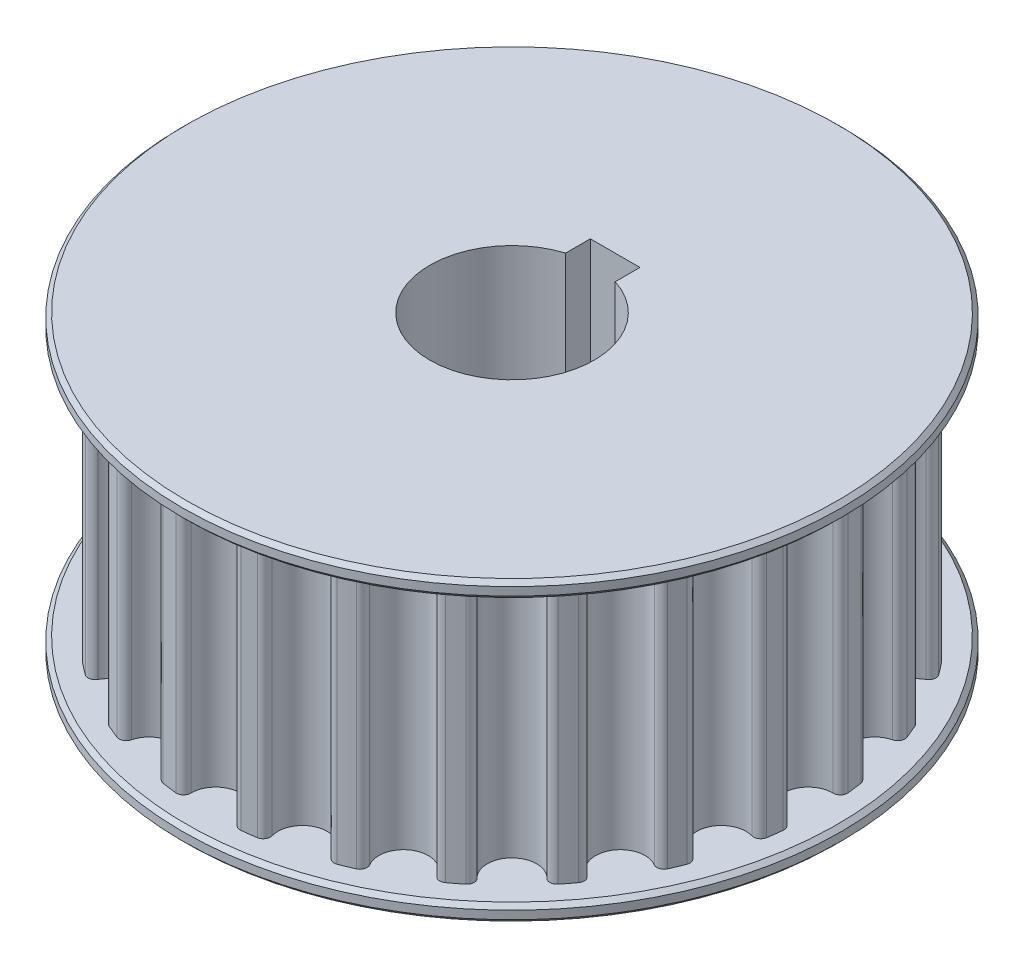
ISO-10303-21;
HEADER;
FILE_DESCRIPTION(('STEP AP214'),'2;1');
FILE_NAME('part.step','',(''),(''),'','','');
FILE_SCHEMA(('AUTOMOTIVE_DESIGN { 1 0 10303 214 1 1 1 1 }'));
ENDSEC;
DATA;
#1=APPLICATION_CONTEXT('core data for automotive mechanical design processes');
#2=APPLICATION_PROTOCOL_DEFINITION('international standard','automotive_design',2000,#1);
#3=PRODUCT_CONTEXT('',#1,'mechanical');
#4=PRODUCT('Part','Part','',(#3));
#5=PRODUCT_RELATED_PRODUCT_CATEGORY('part','',(#4));
#6=PRODUCT_DEFINITION_FORMATION('','',#4);
#7=PRODUCT_DEFINITION_CONTEXT('part definition',#1,'design');
#8=PRODUCT_DEFINITION('design','',#6,#7);
#9=PRODUCT_DEFINITION_SHAPE('','',#8);
#10=(LENGTH_UNIT() NAMED_UNIT(*) SI_UNIT(.MILLI.,.METRE.));
#11=(NAMED_UNIT(*) PLANE_ANGLE_UNIT() SI_UNIT($,.RADIAN.));
#12=(NAMED_UNIT(*) SI_UNIT($,.STERADIAN.) SOLID_ANGLE_UNIT());
#13=UNCERTAINTY_MEASURE_WITH_UNIT(LENGTH_MEASURE(1.E-05),#10,'distance_accuracy_value','');
#14=(GEOMETRIC_REPRESENTATION_CONTEXT(3) GLOBAL_UNCERTAINTY_ASSIGNED_CONTEXT((#13)) GLOBAL_UNIT_ASSIGNED_CONTEXT((#10,
#11,#12)) REPRESENTATION_CONTEXT('',''));
#15=CARTESIAN_POINT('',(0.,0.,0.));
#16=DIRECTION('',(0.,0.,1.));
#17=DIRECTION('',(1.,0.,0.));
#18=AXIS2_PLACEMENT_3D('',#15,#16,#17);
#19=CARTESIAN_POINT('',(0.,8.,0.));
#20=DIRECTION('',(0.,-1.,0.));
#21=DIRECTION('',(0.,0.,-1.));
#22=AXIS2_PLACEMENT_3D('',#19,#20,#21);
#23=CYLINDRICAL_SURFACE('',#22,4.99);
#24=DIRECTION('',(0.,-1.,0.));
#25=VECTOR('',#24,1.);
#26=CARTESIAN_POINT('',(1.505,8.,-4.75763334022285));
#27=LINE('',#26,#25);
#28=CARTESIAN_POINT('',(1.505,9.,-4.75763334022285));
#29=VERTEX_POINT('',#28);
#30=CARTESIAN_POINT('',(1.505,-9.,-4.75763334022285));
#31=VERTEX_POINT('',#30);
#32=EDGE_CURVE('E399',#29,#31,#27,.T.);
#33=ORIENTED_EDGE('',*,*,#32,.T.);
#34=CARTESIAN_POINT('',(0.,-9.,0.));
#35=DIRECTION('',(0.,1.,0.));
#36=DIRECTION('',(0.,0.,1.));
#37=AXIS2_PLACEMENT_3D('',#34,#35,#36);
#38=CIRCLE('',#37,4.99);
#39=CARTESIAN_POINT('',(-1.505,-9.,-4.75763334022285));
#40=VERTEX_POINT('',#39);
#41=EDGE_CURVE('E2451',#40,#31,#38,.T.);
#42=ORIENTED_EDGE('',*,*,#41,.F.);
#43=DIRECTION('',(0.,-1.,0.));
#44=VECTOR('',#43,1.);
#45=CARTESIAN_POINT('',(-1.505,8.,-4.75763334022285));
#46=LINE('',#45,#44);
#47=CARTESIAN_POINT('',(-1.505,9.,-4.75763334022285));
#48=VERTEX_POINT('',#47);
#49=EDGE_CURVE('E412',#48,#40,#46,.T.);
#50=ORIENTED_EDGE('',*,*,#49,.F.);
#51=CARTESIAN_POINT('',(0.,9.,0.));
#52=DIRECTION('',(0.,1.,0.));
#53=DIRECTION('',(0.,0.,1.));
#54=AXIS2_PLACEMENT_3D('',#51,#52,#53);
#55=CIRCLE('',#54,4.99);
#56=EDGE_CURVE('E1180',#48,#29,#55,.T.);
#57=ORIENTED_EDGE('',*,*,#56,.T.);
#58=EDGE_LOOP('',(#33,#42,#50,#57));
#59=FACE_BOUND('',#58,.T.);
#60=ADVANCED_FACE('F49',(#59),#23,.F.);
#61=CARTESIAN_POINT('',(-1.505,8.,0.));
#62=DIRECTION('',(1.,0.,0.));
#63=DIRECTION('',(0.,0.,-1.));
#64=AXIS2_PLACEMENT_3D('',#61,#62,#63);
#65=PLANE('',#64);
#66=ORIENTED_EDGE('',*,*,#49,.T.);
#67=DIRECTION('',(0.,0.,1.));
#68=VECTOR('',#67,1.);
#69=CARTESIAN_POINT('',(-1.505,-9.,-6.25763334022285));
#70=LINE('',#69,#68);
#71=CARTESIAN_POINT('',(-1.505,-9.,-6.25763334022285));
#72=VERTEX_POINT('',#71);
#73=EDGE_CURVE('E1189',#72,#40,#70,.T.);
#74=ORIENTED_EDGE('',*,*,#73,.F.);
#75=DIRECTION('',(0.,-1.,0.));
#76=VECTOR('',#75,1.);
#77=CARTESIAN_POINT('',(-1.505,8.,-6.25763334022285));
#78=LINE('',#77,#76);
#79=CARTESIAN_POINT('',(-1.505,9.,-6.25763334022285));
#80=VERTEX_POINT('',#79);
#81=EDGE_CURVE('E408',#80,#72,#78,.T.);
#82=ORIENTED_EDGE('',*,*,#81,.F.);
#83=DIRECTION('',(0.,0.,1.));
#84=VECTOR('',#83,1.);
#85=CARTESIAN_POINT('',(-1.505,9.,-6.25763334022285));
#86=LINE('',#85,#84);
#87=EDGE_CURVE('E1173',#80,#48,#86,.T.);
#88=ORIENTED_EDGE('',*,*,#87,.T.);
#89=EDGE_LOOP('',(#66,#74,#82,#88));
#90=FACE_BOUND('',#89,.T.);
#91=ADVANCED_FACE('F745',(#90),#65,.T.);
#92=CARTESIAN_POINT('',(0.,8.,-6.25763334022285));
#93=DIRECTION('',(0.,0.,-1.));
#94=DIRECTION('',(-1.,0.,0.));
#95=AXIS2_PLACEMENT_3D('',#92,#93,#94);
#96=PLANE('',#95);
#97=CARTESIAN_POINT('',(0.,0.,-6.25763334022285));
#98=DIRECTION('',(0.,0.,-1.));
#99=DIRECTION('',(-1.,0.,0.));
#100=AXIS2_PLACEMENT_3D('',#97,#98,#99);
#101=CIRCLE('',#100,1.2);
#102=CARTESIAN_POINT('',(-1.2,0.,-6.25763334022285));
#103=VERTEX_POINT('',#102);
#104=EDGE_CURVE('E2438',#103,#103,#101,.T.);
#105=ORIENTED_EDGE('',*,*,#104,.T.);
#106=EDGE_LOOP('',(#105));
#107=FACE_BOUND('',#106,.T.);
#108=ORIENTED_EDGE('',*,*,#81,.T.);
#109=DIRECTION('',(-1.,0.,0.));
#110=VECTOR('',#109,1.);
#111=CARTESIAN_POINT('',(-1.505,-9.,-6.25763334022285));
#112=LINE('',#111,#110);
#113=CARTESIAN_POINT('',(1.505,-9.,-6.25763334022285));
#114=VERTEX_POINT('',#113);
#115=EDGE_CURVE('E2443',#114,#72,#112,.T.);
#116=ORIENTED_EDGE('',*,*,#115,.F.);
#117=DIRECTION('',(0.,-1.,0.));
#118=VECTOR('',#117,1.);
#119=CARTESIAN_POINT('',(1.505,8.,-6.25763334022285));
#120=LINE('',#119,#118);
#121=CARTESIAN_POINT('',(1.505,9.,-6.25763334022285));
#122=VERTEX_POINT('',#121);
#123=EDGE_CURVE('E403',#122,#114,#120,.T.);
#124=ORIENTED_EDGE('',*,*,#123,.F.);
#125=DIRECTION('',(-1.,0.,0.));
#126=VECTOR('',#125,1.);
#127=CARTESIAN_POINT('',(-1.505,9.,-6.25763334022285));
#128=LINE('',#127,#126);
#129=EDGE_CURVE('E1177',#122,#80,#128,.T.);
#130=ORIENTED_EDGE('',*,*,#129,.T.);
#131=EDGE_LOOP('',(#108,#116,#124,#130));
#132=FACE_BOUND('',#131,.T.);
#133=ADVANCED_FACE('F752',(#107,#132),#96,.F.);
#134=CARTESIAN_POINT('',(-4.64968414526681,8.,-17.3528574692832));
#135=DIRECTION('',(0.,-1.,0.));
#136=DIRECTION('',(0.,0.,-1.));
#137=AXIS2_PLACEMENT_3D('',#134,#135,#136);
#138=CYLINDRICAL_SURFACE('',#137,1.50000000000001);
#139=CARTESIAN_POINT('',(-4.64968414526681,-8.,-17.3528574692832));
#140=DIRECTION('',(0.,1.,0.));
#141=DIRECTION('',(0.,0.,1.));
#142=AXIS2_PLACEMENT_3D('',#139,#140,#141);
#143=CIRCLE('',#142,1.50000000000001);
#144=CARTESIAN_POINT('',(-6.10382400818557,-8.,-16.9847851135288));
#145=VERTEX_POINT('',#144);
#146=CARTESIAN_POINT('',(-3.20632590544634,-8.,-17.7611673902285));
#147=VERTEX_POINT('',#146);
#148=EDGE_CURVE('E1196',#145,#147,#143,.T.);
#149=ORIENTED_EDGE('',*,*,#148,.F.);
#150=DIRECTION('',(0.,-1.,0.));
#151=VECTOR('',#150,1.);
#152=CARTESIAN_POINT('',(-6.10382400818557,8.,-16.9847851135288));
#153=LINE('',#152,#151);
#154=CARTESIAN_POINT('',(-6.10382400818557,8.,-16.9847851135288));
#155=VERTEX_POINT('',#154);
#156=EDGE_CURVE('E404',#155,#145,#153,.T.);
#157=ORIENTED_EDGE('',*,*,#156,.F.);
#158=CARTESIAN_POINT('',(-4.64968414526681,8.,-17.3528574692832));
#159=DIRECTION('',(0.,1.,0.));
#160=DIRECTION('',(0.,0.,1.));
#161=AXIS2_PLACEMENT_3D('',#158,#159,#160);
#162=CIRCLE('',#161,1.50000000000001);
#163=CARTESIAN_POINT('',(-3.20632590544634,8.,-17.7611673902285));
#164=VERTEX_POINT('',#163);
#165=EDGE_CURVE('E395',#155,#164,#162,.T.);
#166=ORIENTED_EDGE('',*,*,#165,.T.);
#167=DIRECTION('',(0.,-1.,0.));
#168=VECTOR('',#167,1.);
#169=CARTESIAN_POINT('',(-3.20632590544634,8.,-17.7611673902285));
#170=LINE('',#169,#168);
#171=EDGE_CURVE('E417',#164,#147,#170,.T.);
#172=ORIENTED_EDGE('',*,*,#171,.T.);
#173=EDGE_LOOP('',(#149,#157,#166,#172));
#174=FACE_BOUND('',#173,.T.);
#175=ADVANCED_FACE('F1133',(#174),#138,.F.);
#176=CARTESIAN_POINT('',(-6.52067743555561,8.,-16.8792710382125));
#177=DIRECTION('',(0.,-1.,0.));
#178=DIRECTION('',(0.,0.,-1.));
#179=AXIS2_PLACEMENT_3D('',#176,#177,#178);
#180=CYLINDRICAL_SURFACE('',#179,0.429999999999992);
#181=CARTESIAN_POINT('',(-6.52067743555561,-8.,-16.8792710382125));
#182=DIRECTION('',(0.,1.,0.));
#183=DIRECTION('',(0.,0.,1.));
#184=AXIS2_PLACEMENT_3D('',#181,#182,#183);
#185=CIRCLE('',#184,0.429999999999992);
#186=CARTESIAN_POINT('',(-6.67563136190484,-8.,-17.2803810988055));
#187=VERTEX_POINT('',#186);
#188=EDGE_CURVE('E1578',#187,#145,#185,.F.);
#189=ORIENTED_EDGE('',*,*,#188,.F.);
#190=DIRECTION('',(0.,-1.,0.));
#191=VECTOR('',#190,1.);
#192=CARTESIAN_POINT('',(-6.67563136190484,8.,-17.2803810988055));
#193=LINE('',#192,#191);
#194=CARTESIAN_POINT('',(-6.67563136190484,8.,-17.2803810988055));
#195=VERTEX_POINT('',#194);
#196=EDGE_CURVE('E695',#195,#187,#193,.T.);
#197=ORIENTED_EDGE('',*,*,#196,.F.);
#198=CARTESIAN_POINT('',(-6.52067743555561,8.,-16.8792710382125));
#199=DIRECTION('',(0.,1.,0.));
#200=DIRECTION('',(0.,0.,1.));
#201=AXIS2_PLACEMENT_3D('',#198,#199,#200);
#202=CIRCLE('',#201,0.429999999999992);
#203=EDGE_CURVE('E1200',#195,#155,#202,.F.);
#204=ORIENTED_EDGE('',*,*,#203,.T.);
#205=ORIENTED_EDGE('',*,*,#156,.T.);
#206=EDGE_LOOP('',(#189,#197,#204,#205));
#207=FACE_BOUND('',#206,.T.);
#208=ADVANCED_FACE('F1129',(#207),#180,.T.);
#209=CARTESIAN_POINT('',(0.,8.,0.));
#210=DIRECTION('',(0.,-1.,0.));
#211=DIRECTION('',(0.,0.,-1.));
#212=AXIS2_PLACEMENT_3D('',#209,#210,#211);
#213=CYLINDRICAL_SURFACE('',#212,18.5250000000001);
#214=CARTESIAN_POINT('',(0.,-8.,0.));
#215=DIRECTION('',(0.,1.,0.));
#216=DIRECTION('',(0.,0.,1.));
#217=AXIS2_PLACEMENT_3D('',#214,#215,#216);
#218=CIRCLE('',#217,18.5250000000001);
#219=CARTESIAN_POINT('',(-7.49869045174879,-8.,-16.9394588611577));
#220=VERTEX_POINT('',#219);
#221=EDGE_CURVE('E1582',#220,#187,#218,.F.);
#222=ORIENTED_EDGE('',*,*,#221,.F.);
#223=DIRECTION('',(0.,-1.,0.));
#224=VECTOR('',#223,1.);
#225=CARTESIAN_POINT('',(-7.49869045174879,8.,-16.9394588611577));
#226=LINE('',#225,#224);
#227=CARTESIAN_POINT('',(-7.49869045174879,8.,-16.9394588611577));
#228=VERTEX_POINT('',#227);
#229=EDGE_CURVE('E692',#228,#220,#226,.T.);
#230=ORIENTED_EDGE('',*,*,#229,.F.);
#231=CARTESIAN_POINT('',(0.,8.,0.));
#232=DIRECTION('',(0.,1.,0.));
#233=DIRECTION('',(0.,0.,1.));
#234=AXIS2_PLACEMENT_3D('',#231,#232,#233);
#235=CIRCLE('',#234,18.5250000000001);
#236=EDGE_CURVE('E1204',#228,#195,#235,.F.);
#237=ORIENTED_EDGE('',*,*,#236,.T.);
#238=ORIENTED_EDGE('',*,*,#196,.T.);
#239=EDGE_LOOP('',(#222,#230,#237,#238));
#240=FACE_BOUND('',#239,.T.);
#241=ADVANCED_FACE('F1125',(#240),#213,.T.);
#242=CARTESIAN_POINT('',(-7.32463177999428,8.,-16.5462622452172));
#243=DIRECTION('',(0.,-1.,0.));
#244=DIRECTION('',(0.,0.,-1.));
#245=AXIS2_PLACEMENT_3D('',#242,#243,#244);
#246=CYLINDRICAL_SURFACE('',#245,0.430000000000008);
#247=CARTESIAN_POINT('',(-7.32463177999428,-8.,-16.5462622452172));
#248=DIRECTION('',(0.,1.,0.));
#249=DIRECTION('',(0.,0.,1.));
#250=AXIS2_PLACEMENT_3D('',#247,#248,#249);
#251=CIRCLE('',#250,0.430000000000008);
#252=CARTESIAN_POINT('',(-7.69400138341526,-8.,-16.3261120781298));
#253=VERTEX_POINT('',#252);
#254=EDGE_CURVE('E1586',#253,#220,#251,.F.);
#255=ORIENTED_EDGE('',*,*,#254,.F.);
#256=DIRECTION('',(0.,-1.,0.));
#257=VECTOR('',#256,1.);
#258=CARTESIAN_POINT('',(-7.69400138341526,8.,-16.3261120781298));
#259=LINE('',#258,#257);
#260=CARTESIAN_POINT('',(-7.69400138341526,8.,-16.3261120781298));
#261=VERTEX_POINT('',#260);
#262=EDGE_CURVE('E689',#261,#253,#259,.T.);
#263=ORIENTED_EDGE('',*,*,#262,.F.);
#264=CARTESIAN_POINT('',(-7.32463177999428,8.,-16.5462622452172));
#265=DIRECTION('',(0.,1.,0.));
#266=DIRECTION('',(0.,0.,1.));
#267=AXIS2_PLACEMENT_3D('',#264,#265,#266);
#268=CIRCLE('',#267,0.430000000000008);
#269=EDGE_CURVE('E1208',#261,#228,#268,.F.);
#270=ORIENTED_EDGE('',*,*,#269,.T.);
#271=ORIENTED_EDGE('',*,*,#229,.T.);
#272=EDGE_LOOP('',(#255,#263,#270,#271));
#273=FACE_BOUND('',#272,.T.);
#274=ADVANCED_FACE('F1121',(#273),#246,.T.);
#275=CARTESIAN_POINT('',(-8.98250000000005,8.,-15.5581463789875));
#276=DIRECTION('',(0.,-1.,0.));
#277=DIRECTION('',(0.,0.,-1.));
#278=AXIS2_PLACEMENT_3D('',#275,#276,#277);
#279=CYLINDRICAL_SURFACE('',#278,1.49999999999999);
#280=CARTESIAN_POINT('',(-8.98250000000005,-8.,-15.5581463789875));
#281=DIRECTION('',(0.,1.,0.));
#282=DIRECTION('',(0.,0.,1.));
#283=AXIS2_PLACEMENT_3D('',#280,#281,#282);
#284=CIRCLE('',#283,1.49999999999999);
#285=CARTESIAN_POINT('',(-10.2918271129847,-8.,-14.8262566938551));
#286=VERTEX_POINT('',#285);
#287=EDGE_CURVE('E1590',#286,#253,#284,.T.);
#288=ORIENTED_EDGE('',*,*,#287,.F.);
#289=DIRECTION('',(0.,-1.,0.));
#290=VECTOR('',#289,1.);
#291=CARTESIAN_POINT('',(-10.2918271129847,8.,-14.8262566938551));
#292=LINE('',#291,#290);
#293=CARTESIAN_POINT('',(-10.2918271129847,8.,-14.8262566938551));
#294=VERTEX_POINT('',#293);
#295=EDGE_CURVE('E686',#294,#286,#292,.T.);
#296=ORIENTED_EDGE('',*,*,#295,.F.);
#297=CARTESIAN_POINT('',(-8.98250000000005,8.,-15.5581463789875));
#298=DIRECTION('',(0.,1.,0.));
#299=DIRECTION('',(0.,0.,1.));
#300=AXIS2_PLACEMENT_3D('',#297,#298,#299);
#301=CIRCLE('',#300,1.49999999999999);
#302=EDGE_CURVE('E1212',#294,#261,#301,.T.);
#303=ORIENTED_EDGE('',*,*,#302,.T.);
#304=ORIENTED_EDGE('',*,*,#262,.T.);
#305=EDGE_LOOP('',(#288,#296,#303,#304));
#306=FACE_BOUND('',#305,.T.);
#307=ADVANCED_FACE('F1117',(#306),#279,.F.);
#308=CARTESIAN_POINT('',(-10.6671675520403,8.,-14.6164483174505));
#309=DIRECTION('',(0.,-1.,0.));
#310=DIRECTION('',(0.,0.,-1.));
#311=AXIS2_PLACEMENT_3D('',#308,#309,#310);
#312=CYLINDRICAL_SURFACE('',#311,0.429999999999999);
#313=CARTESIAN_POINT('',(-10.6671675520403,-8.,-14.6164483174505));
#314=DIRECTION('',(0.,1.,0.));
#315=DIRECTION('',(0.,0.,1.));
#316=AXIS2_PLACEMENT_3D('',#313,#314,#315);
#317=CIRCLE('',#316,0.429999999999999);
#318=CARTESIAN_POINT('',(-10.9206564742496,-8.,-14.9637858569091));
#319=VERTEX_POINT('',#318);
#320=EDGE_CURVE('E1594',#319,#286,#317,.F.);
#321=ORIENTED_EDGE('',*,*,#320,.F.);
#322=DIRECTION('',(0.,-1.,0.));
#323=VECTOR('',#322,1.);
#324=CARTESIAN_POINT('',(-10.9206564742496,8.,-14.9637858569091));
#325=LINE('',#324,#323);
#326=CARTESIAN_POINT('',(-10.9206564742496,8.,-14.9637858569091));
#327=VERTEX_POINT('',#326);
#328=EDGE_CURVE('E683',#327,#319,#325,.T.);
#329=ORIENTED_EDGE('',*,*,#328,.F.);
#330=CARTESIAN_POINT('',(-10.6671675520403,8.,-14.6164483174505));
#331=DIRECTION('',(0.,1.,0.));
#332=DIRECTION('',(0.,0.,1.));
#333=AXIS2_PLACEMENT_3D('',#330,#331,#332);
#334=CIRCLE('',#333,0.429999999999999);
#335=EDGE_CURVE('E1216',#327,#294,#334,.F.);
#336=ORIENTED_EDGE('',*,*,#335,.T.);
#337=ORIENTED_EDGE('',*,*,#295,.T.);
#338=EDGE_LOOP('',(#321,#329,#336,#337));
#339=FACE_BOUND('',#338,.T.);
#340=ADVANCED_FACE('F1113',(#339),#312,.T.);
#341=CARTESIAN_POINT('',(0.,8.,0.));
#342=DIRECTION('',(0.,-1.,0.));
#343=DIRECTION('',(0.,0.,-1.));
#344=AXIS2_PLACEMENT_3D('',#341,#342,#343);
#345=CYLINDRICAL_SURFACE('',#344,18.5250000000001);
#346=CARTESIAN_POINT('',(0.,-8.,0.));
#347=DIRECTION('',(0.,1.,0.));
#348=DIRECTION('',(0.,0.,1.));
#349=AXIS2_PLACEMENT_3D('',#346,#347,#348);
#350=CIRCLE('',#349,18.5250000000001);
#351=CARTESIAN_POINT('',(-11.6274333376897,-8.,-14.4214568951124));
#352=VERTEX_POINT('',#351);
#353=EDGE_CURVE('E1598',#352,#319,#350,.F.);
#354=ORIENTED_EDGE('',*,*,#353,.F.);
#355=DIRECTION('',(0.,-1.,0.));
#356=VECTOR('',#355,1.);
#357=CARTESIAN_POINT('',(-11.6274333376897,8.,-14.4214568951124));
#358=LINE('',#357,#356);
#359=CARTESIAN_POINT('',(-11.6274333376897,8.,-14.4214568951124));
#360=VERTEX_POINT('',#359);
#361=EDGE_CURVE('E680',#360,#352,#358,.T.);
#362=ORIENTED_EDGE('',*,*,#361,.F.);
#363=CARTESIAN_POINT('',(0.,8.,0.));
#364=DIRECTION('',(0.,1.,0.));
#365=DIRECTION('',(0.,0.,1.));
#366=AXIS2_PLACEMENT_3D('',#363,#364,#365);
#367=CIRCLE('',#366,18.5250000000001);
#368=EDGE_CURVE('E1220',#360,#327,#367,.F.);
#369=ORIENTED_EDGE('',*,*,#368,.T.);
#370=ORIENTED_EDGE('',*,*,#328,.T.);
#371=EDGE_LOOP('',(#354,#362,#369,#370));
#372=FACE_BOUND('',#371,.T.);
#373=ADVANCED_FACE('F1109',(#372),#345,.T.);
#374=CARTESIAN_POINT('',(-11.3575387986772,8.,-14.0867078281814));
#375=DIRECTION('',(0.,-1.,0.));
#376=DIRECTION('',(0.,0.,-1.));
#377=AXIS2_PLACEMENT_3D('',#374,#375,#376);
#378=CYLINDRICAL_SURFACE('',#377,0.430000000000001);
#379=CARTESIAN_POINT('',(-11.3575387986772,-8.,-14.0867078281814));
#380=DIRECTION('',(0.,1.,0.));
#381=DIRECTION('',(0.,0.,1.));
#382=AXIS2_PLACEMENT_3D('',#379,#380,#381);
#383=CIRCLE('',#382,0.430000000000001);
#384=CARTESIAN_POINT('',(-11.6573433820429,-8.,-13.7784592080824));
#385=VERTEX_POINT('',#384);
#386=EDGE_CURVE('E1602',#385,#352,#383,.F.);
#387=ORIENTED_EDGE('',*,*,#386,.F.);
#388=DIRECTION('',(0.,-1.,0.));
#389=VECTOR('',#388,1.);
#390=CARTESIAN_POINT('',(-11.6573433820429,8.,-13.7784592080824));
#391=LINE('',#390,#389);
#392=CARTESIAN_POINT('',(-11.6573433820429,8.,-13.7784592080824));
#393=VERTEX_POINT('',#392);
#394=EDGE_CURVE('E677',#393,#385,#391,.T.);
#395=ORIENTED_EDGE('',*,*,#394,.F.);
#396=CARTESIAN_POINT('',(-11.3575387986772,8.,-14.0867078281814));
#397=DIRECTION('',(0.,1.,0.));
#398=DIRECTION('',(0.,0.,1.));
#399=AXIS2_PLACEMENT_3D('',#396,#397,#398);
#400=CIRCLE('',#399,0.430000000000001);
#401=EDGE_CURVE('E1224',#393,#360,#400,.F.);
#402=ORIENTED_EDGE('',*,*,#401,.T.);
#403=ORIENTED_EDGE('',*,*,#361,.T.);
#404=EDGE_LOOP('',(#387,#395,#402,#403));
#405=FACE_BOUND('',#404,.T.);
#406=ADVANCED_FACE('F1105',(#405),#378,.T.);
#407=CARTESIAN_POINT('',(-12.7031733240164,8.,-12.7031733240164));
#408=DIRECTION('',(0.,-1.,0.));
#409=DIRECTION('',(0.,0.,-1.));
#410=AXIS2_PLACEMENT_3D('',#407,#408,#409);
#411=CYLINDRICAL_SURFACE('',#410,1.5);
#412=CARTESIAN_POINT('',(-12.7031733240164,-8.,-12.7031733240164));
#413=DIRECTION('',(0.,1.,0.));
#414=DIRECTION('',(0.,0.,1.));
#415=AXIS2_PLACEMENT_3D('',#412,#413,#414);
#416=CIRCLE('',#415,1.5);
#417=CARTESIAN_POINT('',(-13.7784592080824,-8.,-11.6573433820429));
#418=VERTEX_POINT('',#417);
#419=EDGE_CURVE('E1606',#418,#385,#416,.T.);
#420=ORIENTED_EDGE('',*,*,#419,.F.);
#421=DIRECTION('',(0.,-1.,0.));
#422=VECTOR('',#421,1.);
#423=CARTESIAN_POINT('',(-13.7784592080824,8.,-11.6573433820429));
#424=LINE('',#423,#422);
#425=CARTESIAN_POINT('',(-13.7784592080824,8.,-11.6573433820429));
#426=VERTEX_POINT('',#425);
#427=EDGE_CURVE('E674',#426,#418,#424,.T.);
#428=ORIENTED_EDGE('',*,*,#427,.F.);
#429=CARTESIAN_POINT('',(-12.7031733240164,8.,-12.7031733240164));
#430=DIRECTION('',(0.,1.,0.));
#431=DIRECTION('',(0.,0.,1.));
#432=AXIS2_PLACEMENT_3D('',#429,#430,#431);
#433=CIRCLE('',#432,1.5);
#434=EDGE_CURVE('E1228',#426,#393,#433,.T.);
#435=ORIENTED_EDGE('',*,*,#434,.T.);
#436=ORIENTED_EDGE('',*,*,#394,.T.);
#437=EDGE_LOOP('',(#420,#428,#435,#436));
#438=FACE_BOUND('',#437,.T.);
#439=ADVANCED_FACE('F1101',(#438),#411,.F.);
#440=CARTESIAN_POINT('',(-14.0867078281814,8.,-11.3575387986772));
#441=DIRECTION('',(0.,-1.,0.));
#442=DIRECTION('',(0.,0.,-1.));
#443=AXIS2_PLACEMENT_3D('',#440,#441,#442);
#444=CYLINDRICAL_SURFACE('',#443,0.430000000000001);
#445=CARTESIAN_POINT('',(-14.0867078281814,-8.,-11.3575387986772));
#446=DIRECTION('',(0.,1.,0.));
#447=DIRECTION('',(0.,0.,1.));
#448=AXIS2_PLACEMENT_3D('',#445,#446,#447);
#449=CIRCLE('',#448,0.430000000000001);
#450=CARTESIAN_POINT('',(-14.4214568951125,-8.,-11.6274333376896));
#451=VERTEX_POINT('',#450);
#452=EDGE_CURVE('E1610',#451,#418,#449,.F.);
#453=ORIENTED_EDGE('',*,*,#452,.F.);
#454=DIRECTION('',(0.,-1.,0.));
#455=VECTOR('',#454,1.);
#456=CARTESIAN_POINT('',(-14.4214568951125,8.,-11.6274333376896));
#457=LINE('',#456,#455);
#458=CARTESIAN_POINT('',(-14.4214568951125,8.,-11.6274333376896));
#459=VERTEX_POINT('',#458);
#460=EDGE_CURVE('E671',#459,#451,#457,.T.);
#461=ORIENTED_EDGE('',*,*,#460,.F.);
#462=CARTESIAN_POINT('',(-14.0867078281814,8.,-11.3575387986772));
#463=DIRECTION('',(0.,1.,0.));
#464=DIRECTION('',(0.,0.,1.));
#465=AXIS2_PLACEMENT_3D('',#462,#463,#464);
#466=CIRCLE('',#465,0.430000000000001);
#467=EDGE_CURVE('E1232',#459,#426,#466,.F.);
#468=ORIENTED_EDGE('',*,*,#467,.T.);
#469=ORIENTED_EDGE('',*,*,#427,.T.);
#470=EDGE_LOOP('',(#453,#461,#468,#469));
#471=FACE_BOUND('',#470,.T.);
#472=ADVANCED_FACE('F1097',(#471),#444,.T.);
#473=CARTESIAN_POINT('',(0.,8.,0.));
#474=DIRECTION('',(0.,-1.,0.));
#475=DIRECTION('',(0.,0.,-1.));
#476=AXIS2_PLACEMENT_3D('',#473,#474,#475);
#477=CYLINDRICAL_SURFACE('',#476,18.5250000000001);
#478=CARTESIAN_POINT('',(0.,-8.,0.));
#479=DIRECTION('',(0.,1.,0.));
#480=DIRECTION('',(0.,0.,1.));
#481=AXIS2_PLACEMENT_3D('',#478,#479,#480);
#482=CIRCLE('',#481,18.5250000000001);
#483=CARTESIAN_POINT('',(-14.9637858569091,-8.,-10.9206564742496));
#484=VERTEX_POINT('',#483);
#485=EDGE_CURVE('E1614',#484,#451,#482,.F.);
#486=ORIENTED_EDGE('',*,*,#485,.F.);
#487=DIRECTION('',(0.,-1.,0.));
#488=VECTOR('',#487,1.);
#489=CARTESIAN_POINT('',(-14.9637858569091,8.,-10.9206564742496));
#490=LINE('',#489,#488);
#491=CARTESIAN_POINT('',(-14.9637858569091,8.,-10.9206564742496));
#492=VERTEX_POINT('',#491);
#493=EDGE_CURVE('E668',#492,#484,#490,.T.);
#494=ORIENTED_EDGE('',*,*,#493,.F.);
#495=CARTESIAN_POINT('',(0.,8.,0.));
#496=DIRECTION('',(0.,1.,0.));
#497=DIRECTION('',(0.,0.,1.));
#498=AXIS2_PLACEMENT_3D('',#495,#496,#497);
#499=CIRCLE('',#498,18.5250000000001);
#500=EDGE_CURVE('E1236',#492,#459,#499,.F.);
#501=ORIENTED_EDGE('',*,*,#500,.T.);
#502=ORIENTED_EDGE('',*,*,#460,.T.);
#503=EDGE_LOOP('',(#486,#494,#501,#502));
#504=FACE_BOUND('',#503,.T.);
#505=ADVANCED_FACE('F1093',(#504),#477,.T.);
#506=CARTESIAN_POINT('',(-14.6164483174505,8.,-10.6671675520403));
#507=DIRECTION('',(0.,-1.,0.));
#508=DIRECTION('',(0.,0.,-1.));
#509=AXIS2_PLACEMENT_3D('',#506,#507,#508);
#510=CYLINDRICAL_SURFACE('',#509,0.430000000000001);
#511=CARTESIAN_POINT('',(-14.6164483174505,-8.,-10.6671675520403));
#512=DIRECTION('',(0.,1.,0.));
#513=DIRECTION('',(0.,0.,1.));
#514=AXIS2_PLACEMENT_3D('',#511,#512,#513);
#515=CIRCLE('',#514,0.430000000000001);
#516=CARTESIAN_POINT('',(-14.8262566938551,-8.,-10.2918271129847));
#517=VERTEX_POINT('',#516);
#518=EDGE_CURVE('E1618',#517,#484,#515,.F.);
#519=ORIENTED_EDGE('',*,*,#518,.F.);
#520=DIRECTION('',(0.,-1.,0.));
#521=VECTOR('',#520,1.);
#522=CARTESIAN_POINT('',(-14.8262566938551,8.,-10.2918271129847));
#523=LINE('',#522,#521);
#524=CARTESIAN_POINT('',(-14.8262566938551,8.,-10.2918271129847));
#525=VERTEX_POINT('',#524);
#526=EDGE_CURVE('E665',#525,#517,#523,.T.);
#527=ORIENTED_EDGE('',*,*,#526,.F.);
#528=CARTESIAN_POINT('',(-14.6164483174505,8.,-10.6671675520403));
#529=DIRECTION('',(0.,1.,0.));
#530=DIRECTION('',(0.,0.,1.));
#531=AXIS2_PLACEMENT_3D('',#528,#529,#530);
#532=CIRCLE('',#531,0.430000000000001);
#533=EDGE_CURVE('E1240',#525,#492,#532,.F.);
#534=ORIENTED_EDGE('',*,*,#533,.T.);
#535=ORIENTED_EDGE('',*,*,#493,.T.);
#536=EDGE_LOOP('',(#519,#527,#534,#535));
#537=FACE_BOUND('',#536,.T.);
#538=ADVANCED_FACE('F1089',(#537),#510,.T.);
#539=CARTESIAN_POINT('',(-15.5581463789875,8.,-8.98250000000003));
#540=DIRECTION('',(0.,-1.,0.));
#541=DIRECTION('',(0.,0.,-1.));
#542=AXIS2_PLACEMENT_3D('',#539,#540,#541);
#543=CYLINDRICAL_SURFACE('',#542,1.5);
#544=CARTESIAN_POINT('',(-15.5581463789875,-8.,-8.98250000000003));
#545=DIRECTION('',(0.,1.,0.));
#546=DIRECTION('',(0.,0.,1.));
#547=AXIS2_PLACEMENT_3D('',#544,#545,#546);
#548=CIRCLE('',#547,1.5);
#549=CARTESIAN_POINT('',(-16.3261120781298,-8.,-7.69400138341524));
#550=VERTEX_POINT('',#549);
#551=EDGE_CURVE('E1622',#550,#517,#548,.T.);
#552=ORIENTED_EDGE('',*,*,#551,.F.);
#553=DIRECTION('',(0.,-1.,0.));
#554=VECTOR('',#553,1.);
#555=CARTESIAN_POINT('',(-16.3261120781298,8.,-7.69400138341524));
#556=LINE('',#555,#554);
#557=CARTESIAN_POINT('',(-16.3261120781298,8.,-7.69400138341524));
#558=VERTEX_POINT('',#557);
#559=EDGE_CURVE('E662',#558,#550,#556,.T.);
#560=ORIENTED_EDGE('',*,*,#559,.F.);
#561=CARTESIAN_POINT('',(-15.5581463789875,8.,-8.98250000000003));
#562=DIRECTION('',(0.,1.,0.));
#563=DIRECTION('',(0.,0.,1.));
#564=AXIS2_PLACEMENT_3D('',#561,#562,#563);
#565=CIRCLE('',#564,1.5);
#566=EDGE_CURVE('E1244',#558,#525,#565,.T.);
#567=ORIENTED_EDGE('',*,*,#566,.T.);
#568=ORIENTED_EDGE('',*,*,#526,.T.);
#569=EDGE_LOOP('',(#552,#560,#567,#568));
#570=FACE_BOUND('',#569,.T.);
#571=ADVANCED_FACE('F1085',(#570),#543,.F.);
#572=CARTESIAN_POINT('',(-16.5462622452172,8.,-7.32463177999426));
#573=DIRECTION('',(0.,-1.,0.));
#574=DIRECTION('',(0.,0.,-1.));
#575=AXIS2_PLACEMENT_3D('',#572,#573,#574);
#576=CYLINDRICAL_SURFACE('',#575,0.430000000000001);
#577=CARTESIAN_POINT('',(-16.5462622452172,-8.,-7.32463177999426));
#578=DIRECTION('',(0.,1.,0.));
#579=DIRECTION('',(0.,0.,1.));
#580=AXIS2_PLACEMENT_3D('',#577,#578,#579);
#581=CIRCLE('',#580,0.430000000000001);
#582=CARTESIAN_POINT('',(-16.9394588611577,-8.,-7.49869045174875));
#583=VERTEX_POINT('',#582);
#584=EDGE_CURVE('E1626',#583,#550,#581,.F.);
#585=ORIENTED_EDGE('',*,*,#584,.F.);
#586=DIRECTION('',(0.,-1.,0.));
#587=VECTOR('',#586,1.);
#588=CARTESIAN_POINT('',(-16.9394588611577,8.,-7.49869045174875));
#589=LINE('',#588,#587);
#590=CARTESIAN_POINT('',(-16.9394588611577,8.,-7.49869045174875));
#591=VERTEX_POINT('',#590);
#592=EDGE_CURVE('E659',#591,#583,#589,.T.);
#593=ORIENTED_EDGE('',*,*,#592,.F.);
#594=CARTESIAN_POINT('',(-16.5462622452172,8.,-7.32463177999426));
#595=DIRECTION('',(0.,1.,0.));
#596=DIRECTION('',(0.,0.,1.));
#597=AXIS2_PLACEMENT_3D('',#594,#595,#596);
#598=CIRCLE('',#597,0.430000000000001);
#599=EDGE_CURVE('E1248',#591,#558,#598,.F.);
#600=ORIENTED_EDGE('',*,*,#599,.T.);
#601=ORIENTED_EDGE('',*,*,#559,.T.);
#602=EDGE_LOOP('',(#585,#593,#600,#601));
#603=FACE_BOUND('',#602,.T.);
#604=ADVANCED_FACE('F1081',(#603),#576,.T.);
#605=CARTESIAN_POINT('',(0.,8.,0.));
#606=DIRECTION('',(0.,-1.,0.));
#607=DIRECTION('',(0.,0.,-1.));
#608=AXIS2_PLACEMENT_3D('',#605,#606,#607);
#609=CYLINDRICAL_SURFACE('',#608,18.5250000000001);
#610=CARTESIAN_POINT('',(0.,-8.,0.));
#611=DIRECTION('',(0.,1.,0.));
#612=DIRECTION('',(0.,0.,1.));
#613=AXIS2_PLACEMENT_3D('',#610,#611,#612);
#614=CIRCLE('',#613,18.5250000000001);
#615=CARTESIAN_POINT('',(-17.2803810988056,-8.,-6.6756313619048));
#616=VERTEX_POINT('',#615);
#617=EDGE_CURVE('E1630',#616,#583,#614,.F.);
#618=ORIENTED_EDGE('',*,*,#617,.F.);
#619=DIRECTION('',(0.,-1.,0.));
#620=VECTOR('',#619,1.);
#621=CARTESIAN_POINT('',(-17.2803810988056,8.,-6.6756313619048));
#622=LINE('',#621,#620);
#623=CARTESIAN_POINT('',(-17.2803810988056,8.,-6.6756313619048));
#624=VERTEX_POINT('',#623);
#625=EDGE_CURVE('E656',#624,#616,#622,.T.);
#626=ORIENTED_EDGE('',*,*,#625,.F.);
#627=CARTESIAN_POINT('',(0.,8.,0.));
#628=DIRECTION('',(0.,1.,0.));
#629=DIRECTION('',(0.,0.,1.));
#630=AXIS2_PLACEMENT_3D('',#627,#628,#629);
#631=CIRCLE('',#630,18.5250000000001);
#632=EDGE_CURVE('E1252',#624,#591,#631,.F.);
#633=ORIENTED_EDGE('',*,*,#632,.T.);
#634=ORIENTED_EDGE('',*,*,#592,.T.);
#635=EDGE_LOOP('',(#618,#626,#633,#634));
#636=FACE_BOUND('',#635,.T.);
#637=ADVANCED_FACE('F1077',(#636),#609,.T.);
#638=CARTESIAN_POINT('',(-16.8792710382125,8.,-6.52067743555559));
#639=DIRECTION('',(0.,-1.,0.));
#640=DIRECTION('',(0.,0.,-1.));
#641=AXIS2_PLACEMENT_3D('',#638,#639,#640);
#642=CYLINDRICAL_SURFACE('',#641,0.429999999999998);
#643=CARTESIAN_POINT('',(-16.8792710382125,-8.,-6.52067743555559));
#644=DIRECTION('',(0.,1.,0.));
#645=DIRECTION('',(0.,0.,1.));
#646=AXIS2_PLACEMENT_3D('',#643,#644,#645);
#647=CIRCLE('',#646,0.429999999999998);
#648=CARTESIAN_POINT('',(-16.9847851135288,-8.,-6.10382400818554));
#649=VERTEX_POINT('',#648);
#650=EDGE_CURVE('E1634',#649,#616,#647,.F.);
#651=ORIENTED_EDGE('',*,*,#650,.F.);
#652=DIRECTION('',(0.,-1.,0.));
#653=VECTOR('',#652,1.);
#654=CARTESIAN_POINT('',(-16.9847851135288,8.,-6.10382400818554));
#655=LINE('',#654,#653);
#656=CARTESIAN_POINT('',(-16.9847851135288,8.,-6.10382400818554));
#657=VERTEX_POINT('',#656);
#658=EDGE_CURVE('E653',#657,#649,#655,.T.);
#659=ORIENTED_EDGE('',*,*,#658,.F.);
#660=CARTESIAN_POINT('',(-16.8792710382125,8.,-6.52067743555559));
#661=DIRECTION('',(0.,1.,0.));
#662=DIRECTION('',(0.,0.,1.));
#663=AXIS2_PLACEMENT_3D('',#660,#661,#662);
#664=CIRCLE('',#663,0.429999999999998);
#665=EDGE_CURVE('E1256',#657,#624,#664,.F.);
#666=ORIENTED_EDGE('',*,*,#665,.T.);
#667=ORIENTED_EDGE('',*,*,#625,.T.);
#668=EDGE_LOOP('',(#651,#659,#666,#667));
#669=FACE_BOUND('',#668,.T.);
#670=ADVANCED_FACE('F1073',(#669),#642,.T.);
#671=CARTESIAN_POINT('',(-17.3528574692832,8.,-4.64968414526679));
#672=DIRECTION('',(0.,-1.,0.));
#673=DIRECTION('',(0.,0.,-1.));
#674=AXIS2_PLACEMENT_3D('',#671,#672,#673);
#675=CYLINDRICAL_SURFACE('',#674,1.5);
#676=CARTESIAN_POINT('',(-17.3528574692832,-8.,-4.64968414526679));
#677=DIRECTION('',(0.,1.,0.));
#678=DIRECTION('',(0.,0.,1.));
#679=AXIS2_PLACEMENT_3D('',#676,#677,#678);
#680=CIRCLE('',#679,1.5);
#681=CARTESIAN_POINT('',(-17.7611673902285,-8.,-3.20632590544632));
#682=VERTEX_POINT('',#681);
#683=EDGE_CURVE('E1638',#682,#649,#680,.T.);
#684=ORIENTED_EDGE('',*,*,#683,.F.);
#685=DIRECTION('',(0.,-1.,0.));
#686=VECTOR('',#685,1.);
#687=CARTESIAN_POINT('',(-17.7611673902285,8.,-3.20632590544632));
#688=LINE('',#687,#686);
#689=CARTESIAN_POINT('',(-17.7611673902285,8.,-3.20632590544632));
#690=VERTEX_POINT('',#689);
#691=EDGE_CURVE('E650',#690,#682,#688,.T.);
#692=ORIENTED_EDGE('',*,*,#691,.F.);
#693=CARTESIAN_POINT('',(-17.3528574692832,8.,-4.64968414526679));
#694=DIRECTION('',(0.,1.,0.));
#695=DIRECTION('',(0.,0.,1.));
#696=AXIS2_PLACEMENT_3D('',#693,#694,#695);
#697=CIRCLE('',#696,1.5);
#698=EDGE_CURVE('E1260',#690,#657,#697,.T.);
#699=ORIENTED_EDGE('',*,*,#698,.T.);
#700=ORIENTED_EDGE('',*,*,#658,.T.);
#701=EDGE_LOOP('',(#684,#692,#699,#700));
#702=FACE_BOUND('',#701,.T.);
#703=ADVANCED_FACE('F1069',(#702),#675,.F.);
#704=CARTESIAN_POINT('',(-17.8782162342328,8.,-2.79256321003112));
#705=DIRECTION('',(0.,-1.,0.));
#706=DIRECTION('',(0.,0.,-1.));
#707=AXIS2_PLACEMENT_3D('',#704,#705,#706);
#708=CYLINDRICAL_SURFACE('',#707,0.429999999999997);
#709=CARTESIAN_POINT('',(-17.8782162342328,-8.,-2.79256321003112));
#710=DIRECTION('',(0.,1.,0.));
#711=DIRECTION('',(0.,0.,1.));
#712=AXIS2_PLACEMENT_3D('',#709,#710,#711);
#713=CIRCLE('',#712,0.429999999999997);
#714=CARTESIAN_POINT('',(-18.3030646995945,-8.,-2.85892420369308));
#715=VERTEX_POINT('',#714);
#716=EDGE_CURVE('E1642',#715,#682,#713,.F.);
#717=ORIENTED_EDGE('',*,*,#716,.F.);
#718=DIRECTION('',(0.,-1.,0.));
#719=VECTOR('',#718,1.);
#720=CARTESIAN_POINT('',(-18.3030646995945,8.,-2.85892420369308));
#721=LINE('',#720,#719);
#722=CARTESIAN_POINT('',(-18.3030646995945,8.,-2.85892420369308));
#723=VERTEX_POINT('',#722);
#724=EDGE_CURVE('E647',#723,#715,#721,.T.);
#725=ORIENTED_EDGE('',*,*,#724,.F.);
#726=CARTESIAN_POINT('',(-17.8782162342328,8.,-2.79256321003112));
#727=DIRECTION('',(0.,1.,0.));
#728=DIRECTION('',(0.,0.,1.));
#729=AXIS2_PLACEMENT_3D('',#726,#727,#728);
#730=CIRCLE('',#729,0.429999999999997);
#731=EDGE_CURVE('E1264',#723,#690,#730,.F.);
#732=ORIENTED_EDGE('',*,*,#731,.T.);
#733=ORIENTED_EDGE('',*,*,#691,.T.);
#734=EDGE_LOOP('',(#717,#725,#732,#733));
#735=FACE_BOUND('',#734,.T.);
#736=ADVANCED_FACE('F1065',(#735),#708,.T.);
#737=CARTESIAN_POINT('',(0.,8.,0.));
#738=DIRECTION('',(0.,-1.,0.));
#739=DIRECTION('',(0.,0.,-1.));
#740=AXIS2_PLACEMENT_3D('',#737,#738,#739);
#741=CYLINDRICAL_SURFACE('',#740,18.5250000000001);
#742=CARTESIAN_POINT('',(0.,-8.,0.));
#743=DIRECTION('',(0.,1.,0.));
#744=DIRECTION('',(0.,0.,1.));
#745=AXIS2_PLACEMENT_3D('',#742,#743,#744);
#746=CIRCLE('',#745,18.5250000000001);
#747=CARTESIAN_POINT('',(-18.4193469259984,-8.,-1.97567300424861));
#748=VERTEX_POINT('',#747);
#749=EDGE_CURVE('E1646',#748,#715,#746,.F.);
#750=ORIENTED_EDGE('',*,*,#749,.F.);
#751=DIRECTION('',(0.,-1.,0.));
#752=VECTOR('',#751,1.);
#753=CARTESIAN_POINT('',(-18.4193469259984,8.,-1.97567300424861));
#754=LINE('',#753,#752);
#755=CARTESIAN_POINT('',(-18.4193469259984,8.,-1.97567300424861));
#756=VERTEX_POINT('',#755);
#757=EDGE_CURVE('E644',#756,#748,#754,.T.);
#758=ORIENTED_EDGE('',*,*,#757,.F.);
#759=CARTESIAN_POINT('',(0.,8.,0.));
#760=DIRECTION('',(0.,1.,0.));
#761=DIRECTION('',(0.,0.,1.));
#762=AXIS2_PLACEMENT_3D('',#759,#760,#761);
#763=CIRCLE('',#762,18.5250000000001);
#764=EDGE_CURVE('E1268',#756,#723,#763,.F.);
#765=ORIENTED_EDGE('',*,*,#764,.T.);
#766=ORIENTED_EDGE('',*,*,#724,.T.);
#767=EDGE_LOOP('',(#750,#758,#765,#766));
#768=FACE_BOUND('',#767,.T.);
#769=ADVANCED_FACE('F1061',(#768),#741,.T.);
#770=CARTESIAN_POINT('',(-17.9917993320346,8.,-1.92981392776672));
#771=DIRECTION('',(0.,-1.,0.));
#772=DIRECTION('',(0.,0.,-1.));
#773=AXIS2_PLACEMENT_3D('',#770,#771,#772);
#774=CYLINDRICAL_SURFACE('',#773,0.430000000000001);
#775=CARTESIAN_POINT('',(-17.9917993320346,-8.,-1.92981392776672));
#776=DIRECTION('',(0.,1.,0.));
#777=DIRECTION('',(0.,0.,1.));
#778=AXIS2_PLACEMENT_3D('',#775,#776,#777);
#779=CIRCLE('',#778,0.430000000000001);
#780=CARTESIAN_POINT('',(-17.9858284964,-8.,-1.49985538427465));
#781=VERTEX_POINT('',#780);
#782=EDGE_CURVE('E1650',#781,#748,#779,.F.);
#783=ORIENTED_EDGE('',*,*,#782,.F.);
#784=DIRECTION('',(0.,-1.,0.));
#785=VECTOR('',#784,1.);
#786=CARTESIAN_POINT('',(-17.9858284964,8.,-1.49985538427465));
#787=LINE('',#786,#785);
#788=CARTESIAN_POINT('',(-17.9858284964,8.,-1.49985538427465));
#789=VERTEX_POINT('',#788);
#790=EDGE_CURVE('E641',#789,#781,#787,.T.);
#791=ORIENTED_EDGE('',*,*,#790,.F.);
#792=CARTESIAN_POINT('',(-17.9917993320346,8.,-1.92981392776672));
#793=DIRECTION('',(0.,1.,0.));
#794=DIRECTION('',(0.,0.,1.));
#795=AXIS2_PLACEMENT_3D('',#792,#793,#794);
#796=CIRCLE('',#795,0.430000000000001);
#797=EDGE_CURVE('E1272',#789,#756,#796,.F.);
#798=ORIENTED_EDGE('',*,*,#797,.T.);
#799=ORIENTED_EDGE('',*,*,#757,.T.);
#800=EDGE_LOOP('',(#783,#791,#798,#799));
#801=FACE_BOUND('',#800,.T.);
#802=ADVANCED_FACE('F1057',(#801),#774,.T.);
#803=CARTESIAN_POINT('',(-17.9650000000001,8.,0.));
#804=DIRECTION('',(0.,-1.,0.));
#805=DIRECTION('',(0.,0.,-1.));
#806=AXIS2_PLACEMENT_3D('',#803,#804,#805);
#807=CYLINDRICAL_SURFACE('',#806,1.5);
#808=CARTESIAN_POINT('',(-17.9650000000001,-8.,0.));
#809=DIRECTION('',(0.,1.,0.));
#810=DIRECTION('',(0.,0.,1.));
#811=AXIS2_PLACEMENT_3D('',#808,#809,#810);
#812=CIRCLE('',#811,1.5);
#813=CARTESIAN_POINT('',(-17.9858284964,-8.,1.49985538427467));
#814=VERTEX_POINT('',#813);
#815=EDGE_CURVE('E1654',#814,#781,#812,.T.);
#816=ORIENTED_EDGE('',*,*,#815,.F.);
#817=DIRECTION('',(0.,-1.,0.));
#818=VECTOR('',#817,1.);
#819=CARTESIAN_POINT('',(-17.9858284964,8.,1.49985538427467));
#820=LINE('',#819,#818);
#821=CARTESIAN_POINT('',(-17.9858284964,8.,1.49985538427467));
#822=VERTEX_POINT('',#821);
#823=EDGE_CURVE('E638',#822,#814,#820,.T.);
#824=ORIENTED_EDGE('',*,*,#823,.F.);
#825=CARTESIAN_POINT('',(-17.9650000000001,8.,0.));
#826=DIRECTION('',(0.,1.,0.));
#827=DIRECTION('',(0.,0.,1.));
#828=AXIS2_PLACEMENT_3D('',#825,#826,#827);
#829=CIRCLE('',#828,1.5);
#830=EDGE_CURVE('E1276',#822,#789,#829,.T.);
#831=ORIENTED_EDGE('',*,*,#830,.T.);
#832=ORIENTED_EDGE('',*,*,#790,.T.);
#833=EDGE_LOOP('',(#816,#824,#831,#832));
#834=FACE_BOUND('',#833,.T.);
#835=ADVANCED_FACE('F1053',(#834),#807,.F.);
#836=CARTESIAN_POINT('',(-17.9917993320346,8.,1.92981392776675));
#837=DIRECTION('',(0.,-1.,0.));
#838=DIRECTION('',(0.,0.,-1.));
#839=AXIS2_PLACEMENT_3D('',#836,#837,#838);
#840=CYLINDRICAL_SURFACE('',#839,0.43);
#841=CARTESIAN_POINT('',(-17.9917993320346,-8.,1.92981392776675));
#842=DIRECTION('',(0.,1.,0.));
#843=DIRECTION('',(0.,0.,1.));
#844=AXIS2_PLACEMENT_3D('',#841,#842,#843);
#845=CIRCLE('',#844,0.43);
#846=CARTESIAN_POINT('',(-18.4193469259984,-8.,1.97567300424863));
#847=VERTEX_POINT('',#846);
#848=EDGE_CURVE('E1658',#847,#814,#845,.F.);
#849=ORIENTED_EDGE('',*,*,#848,.F.);
#850=DIRECTION('',(0.,-1.,0.));
#851=VECTOR('',#850,1.);
#852=CARTESIAN_POINT('',(-18.4193469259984,8.,1.97567300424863));
#853=LINE('',#852,#851);
#854=CARTESIAN_POINT('',(-18.4193469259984,8.,1.97567300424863));
#855=VERTEX_POINT('',#854);
#856=EDGE_CURVE('E635',#855,#847,#853,.T.);
#857=ORIENTED_EDGE('',*,*,#856,.F.);
#858=CARTESIAN_POINT('',(-17.9917993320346,8.,1.92981392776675));
#859=DIRECTION('',(0.,1.,0.));
#860=DIRECTION('',(0.,0.,1.));
#861=AXIS2_PLACEMENT_3D('',#858,#859,#860);
#862=CIRCLE('',#861,0.43);
#863=EDGE_CURVE('E1280',#855,#822,#862,.F.);
#864=ORIENTED_EDGE('',*,*,#863,.T.);
#865=ORIENTED_EDGE('',*,*,#823,.T.);
#866=EDGE_LOOP('',(#849,#857,#864,#865));
#867=FACE_BOUND('',#866,.T.);
#868=ADVANCED_FACE('F1049',(#867),#840,.T.);
#869=CARTESIAN_POINT('',(0.,8.,0.));
#870=DIRECTION('',(0.,-1.,0.));
#871=DIRECTION('',(0.,0.,-1.));
#872=AXIS2_PLACEMENT_3D('',#869,#870,#871);
#873=CYLINDRICAL_SURFACE('',#872,18.5250000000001);
#874=CARTESIAN_POINT('',(0.,-8.,0.));
#875=DIRECTION('',(0.,1.,0.));
#876=DIRECTION('',(0.,0.,1.));
#877=AXIS2_PLACEMENT_3D('',#874,#875,#876);
#878=CIRCLE('',#877,18.5250000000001);
#879=CARTESIAN_POINT('',(-18.3030646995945,-8.,2.85892420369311));
#880=VERTEX_POINT('',#879);
#881=EDGE_CURVE('E1662',#880,#847,#878,.F.);
#882=ORIENTED_EDGE('',*,*,#881,.F.);
#883=DIRECTION('',(0.,-1.,0.));
#884=VECTOR('',#883,1.);
#885=CARTESIAN_POINT('',(-18.3030646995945,8.,2.85892420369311));
#886=LINE('',#885,#884);
#887=CARTESIAN_POINT('',(-18.3030646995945,8.,2.85892420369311));
#888=VERTEX_POINT('',#887);
#889=EDGE_CURVE('E632',#888,#880,#886,.T.);
#890=ORIENTED_EDGE('',*,*,#889,.F.);
#891=CARTESIAN_POINT('',(0.,8.,0.));
#892=DIRECTION('',(0.,1.,0.));
#893=DIRECTION('',(0.,0.,1.));
#894=AXIS2_PLACEMENT_3D('',#891,#892,#893);
#895=CIRCLE('',#894,18.5250000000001);
#896=EDGE_CURVE('E1284',#888,#855,#895,.F.);
#897=ORIENTED_EDGE('',*,*,#896,.T.);
#898=ORIENTED_EDGE('',*,*,#856,.T.);
#899=EDGE_LOOP('',(#882,#890,#897,#898));
#900=FACE_BOUND('',#899,.T.);
#901=ADVANCED_FACE('F1045',(#900),#873,.T.);
#902=CARTESIAN_POINT('',(-17.8782162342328,8.,2.79256321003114));
#903=DIRECTION('',(0.,-1.,0.));
#904=DIRECTION('',(0.,0.,-1.));
#905=AXIS2_PLACEMENT_3D('',#902,#903,#904);
#906=CYLINDRICAL_SURFACE('',#905,0.430000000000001);
#907=CARTESIAN_POINT('',(-17.8782162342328,-8.,2.79256321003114));
#908=DIRECTION('',(0.,1.,0.));
#909=DIRECTION('',(0.,0.,1.));
#910=AXIS2_PLACEMENT_3D('',#907,#908,#909);
#911=CIRCLE('',#910,0.430000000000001);
#912=CARTESIAN_POINT('',(-17.7611673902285,-8.,3.20632590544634));
#913=VERTEX_POINT('',#912);
#914=EDGE_CURVE('E1666',#913,#880,#911,.F.);
#915=ORIENTED_EDGE('',*,*,#914,.F.);
#916=DIRECTION('',(0.,-1.,0.));
#917=VECTOR('',#916,1.);
#918=CARTESIAN_POINT('',(-17.7611673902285,8.,3.20632590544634));
#919=LINE('',#918,#917);
#920=CARTESIAN_POINT('',(-17.7611673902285,8.,3.20632590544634));
#921=VERTEX_POINT('',#920);
#922=EDGE_CURVE('E629',#921,#913,#919,.T.);
#923=ORIENTED_EDGE('',*,*,#922,.F.);
#924=CARTESIAN_POINT('',(-17.8782162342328,8.,2.79256321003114));
#925=DIRECTION('',(0.,1.,0.));
#926=DIRECTION('',(0.,0.,1.));
#927=AXIS2_PLACEMENT_3D('',#924,#925,#926);
#928=CIRCLE('',#927,0.430000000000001);
#929=EDGE_CURVE('E1288',#921,#888,#928,.F.);
#930=ORIENTED_EDGE('',*,*,#929,.T.);
#931=ORIENTED_EDGE('',*,*,#889,.T.);
#932=EDGE_LOOP('',(#915,#923,#930,#931));
#933=FACE_BOUND('',#932,.T.);
#934=ADVANCED_FACE('F1041',(#933),#906,.T.);
#935=CARTESIAN_POINT('',(-17.3528574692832,8.,4.64968414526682));
#936=DIRECTION('',(0.,-1.,0.));
#937=DIRECTION('',(0.,0.,-1.));
#938=AXIS2_PLACEMENT_3D('',#935,#936,#937);
#939=CYLINDRICAL_SURFACE('',#938,1.5);
#940=CARTESIAN_POINT('',(-17.3528574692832,-8.,4.64968414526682));
#941=DIRECTION('',(0.,1.,0.));
#942=DIRECTION('',(0.,0.,1.));
#943=AXIS2_PLACEMENT_3D('',#940,#941,#942);
#944=CIRCLE('',#943,1.5);
#945=CARTESIAN_POINT('',(-16.9847851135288,-8.,6.10382400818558));
#946=VERTEX_POINT('',#945);
#947=EDGE_CURVE('E1670',#946,#913,#944,.T.);
#948=ORIENTED_EDGE('',*,*,#947,.F.);
#949=DIRECTION('',(0.,-1.,0.));
#950=VECTOR('',#949,1.);
#951=CARTESIAN_POINT('',(-16.9847851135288,8.,6.10382400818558));
#952=LINE('',#951,#950);
#953=CARTESIAN_POINT('',(-16.9847851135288,8.,6.10382400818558));
#954=VERTEX_POINT('',#953);
#955=EDGE_CURVE('E626',#954,#946,#952,.T.);
#956=ORIENTED_EDGE('',*,*,#955,.F.);
#957=CARTESIAN_POINT('',(-17.3528574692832,8.,4.64968414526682));
#958=DIRECTION('',(0.,1.,0.));
#959=DIRECTION('',(0.,0.,1.));
#960=AXIS2_PLACEMENT_3D('',#957,#958,#959);
#961=CIRCLE('',#960,1.5);
#962=EDGE_CURVE('E1292',#954,#921,#961,.T.);
#963=ORIENTED_EDGE('',*,*,#962,.T.);
#964=ORIENTED_EDGE('',*,*,#922,.T.);
#965=EDGE_LOOP('',(#948,#956,#963,#964));
#966=FACE_BOUND('',#965,.T.);
#967=ADVANCED_FACE('F1037',(#966),#939,.F.);
#968=CARTESIAN_POINT('',(-16.8792710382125,8.,6.52067743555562));
#969=DIRECTION('',(0.,-1.,0.));
#970=DIRECTION('',(0.,0.,-1.));
#971=AXIS2_PLACEMENT_3D('',#968,#969,#970);
#972=CYLINDRICAL_SURFACE('',#971,0.429999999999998);
#973=CARTESIAN_POINT('',(-16.8792710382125,-8.,6.52067743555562));
#974=DIRECTION('',(0.,1.,0.));
#975=DIRECTION('',(0.,0.,1.));
#976=AXIS2_PLACEMENT_3D('',#973,#974,#975);
#977=CIRCLE('',#976,0.429999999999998);
#978=CARTESIAN_POINT('',(-17.2803810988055,-8.,6.67563136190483));
#979=VERTEX_POINT('',#978);
#980=EDGE_CURVE('E1674',#979,#946,#977,.F.);
#981=ORIENTED_EDGE('',*,*,#980,.F.);
#982=DIRECTION('',(0.,-1.,0.));
#983=VECTOR('',#982,1.);
#984=CARTESIAN_POINT('',(-17.2803810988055,8.,6.67563136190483));
#985=LINE('',#984,#983);
#986=CARTESIAN_POINT('',(-17.2803810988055,8.,6.67563136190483));
#987=VERTEX_POINT('',#986);
#988=EDGE_CURVE('E623',#987,#979,#985,.T.);
#989=ORIENTED_EDGE('',*,*,#988,.F.);
#990=CARTESIAN_POINT('',(-16.8792710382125,8.,6.52067743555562));
#991=DIRECTION('',(0.,1.,0.));
#992=DIRECTION('',(0.,0.,1.));
#993=AXIS2_PLACEMENT_3D('',#990,#991,#992);
#994=CIRCLE('',#993,0.429999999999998);
#995=EDGE_CURVE('E1296',#987,#954,#994,.F.);
#996=ORIENTED_EDGE('',*,*,#995,.T.);
#997=ORIENTED_EDGE('',*,*,#955,.T.);
#998=EDGE_LOOP('',(#981,#989,#996,#997));
#999=FACE_BOUND('',#998,.T.);
#1000=ADVANCED_FACE('F1033',(#999),#972,.T.);
#1001=CARTESIAN_POINT('',(0.,8.,0.));
#1002=DIRECTION('',(0.,-1.,0.));
#1003=DIRECTION('',(0.,0.,-1.));
#1004=AXIS2_PLACEMENT_3D('',#1001,#1002,#1003);
#1005=CYLINDRICAL_SURFACE('',#1004,18.5250000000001);
#1006=CARTESIAN_POINT('',(0.,-8.,0.));
#1007=DIRECTION('',(0.,1.,0.));
#1008=DIRECTION('',(0.,0.,1.));
#1009=AXIS2_PLACEMENT_3D('',#1006,#1007,#1008);
#1010=CIRCLE('',#1009,18.5250000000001);
#1011=CARTESIAN_POINT('',(-16.9394588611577,-8.,7.49869045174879));
#1012=VERTEX_POINT('',#1011);
#1013=EDGE_CURVE('E1678',#1012,#979,#1010,.F.);
#1014=ORIENTED_EDGE('',*,*,#1013,.F.);
#1015=DIRECTION('',(0.,-1.,0.));
#1016=VECTOR('',#1015,1.);
#1017=CARTESIAN_POINT('',(-16.9394588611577,8.,7.49869045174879));
#1018=LINE('',#1017,#1016);
#1019=CARTESIAN_POINT('',(-16.9394588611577,8.,7.49869045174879));
#1020=VERTEX_POINT('',#1019);
#1021=EDGE_CURVE('E620',#1020,#1012,#1018,.T.);
#1022=ORIENTED_EDGE('',*,*,#1021,.F.);
#1023=CARTESIAN_POINT('',(0.,8.,0.));
#1024=DIRECTION('',(0.,1.,0.));
#1025=DIRECTION('',(0.,0.,1.));
#1026=AXIS2_PLACEMENT_3D('',#1023,#1024,#1025);
#1027=CIRCLE('',#1026,18.5250000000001);
#1028=EDGE_CURVE('E1300',#1020,#987,#1027,.F.);
#1029=ORIENTED_EDGE('',*,*,#1028,.T.);
#1030=ORIENTED_EDGE('',*,*,#988,.T.);
#1031=EDGE_LOOP('',(#1014,#1022,#1029,#1030));
#1032=FACE_BOUND('',#1031,.T.);
#1033=ADVANCED_FACE('F1029',(#1032),#1005,.T.);
#1034=CARTESIAN_POINT('',(-16.5462622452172,8.,7.3246317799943));
#1035=DIRECTION('',(0.,-1.,0.));
#1036=DIRECTION('',(0.,0.,-1.));
#1037=AXIS2_PLACEMENT_3D('',#1034,#1035,#1036);
#1038=CYLINDRICAL_SURFACE('',#1037,0.430000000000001);
#1039=CARTESIAN_POINT('',(-16.5462622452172,-8.,7.3246317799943));
#1040=DIRECTION('',(0.,1.,0.));
#1041=DIRECTION('',(0.,0.,1.));
#1042=AXIS2_PLACEMENT_3D('',#1039,#1040,#1041);
#1043=CIRCLE('',#1042,0.430000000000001);
#1044=CARTESIAN_POINT('',(-16.3261120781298,-8.,7.69400138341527));
#1045=VERTEX_POINT('',#1044);
#1046=EDGE_CURVE('E1682',#1045,#1012,#1043,.F.);
#1047=ORIENTED_EDGE('',*,*,#1046,.F.);
#1048=DIRECTION('',(0.,-1.,0.));
#1049=VECTOR('',#1048,1.);
#1050=CARTESIAN_POINT('',(-16.3261120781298,8.,7.69400138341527));
#1051=LINE('',#1050,#1049);
#1052=CARTESIAN_POINT('',(-16.3261120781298,8.,7.69400138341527));
#1053=VERTEX_POINT('',#1052);
#1054=EDGE_CURVE('E617',#1053,#1045,#1051,.T.);
#1055=ORIENTED_EDGE('',*,*,#1054,.F.);
#1056=CARTESIAN_POINT('',(-16.5462622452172,8.,7.3246317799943));
#1057=DIRECTION('',(0.,1.,0.));
#1058=DIRECTION('',(0.,0.,1.));
#1059=AXIS2_PLACEMENT_3D('',#1056,#1057,#1058);
#1060=CIRCLE('',#1059,0.430000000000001);
#1061=EDGE_CURVE('E1304',#1053,#1020,#1060,.F.);
#1062=ORIENTED_EDGE('',*,*,#1061,.T.);
#1063=ORIENTED_EDGE('',*,*,#1021,.T.);
#1064=EDGE_LOOP('',(#1047,#1055,#1062,#1063));
#1065=FACE_BOUND('',#1064,.T.);
#1066=ADVANCED_FACE('F1025',(#1065),#1038,.T.);
#1067=CARTESIAN_POINT('',(-15.5581463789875,8.,8.98250000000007));
#1068=DIRECTION('',(0.,-1.,0.));
#1069=DIRECTION('',(0.,0.,-1.));
#1070=AXIS2_PLACEMENT_3D('',#1067,#1068,#1069);
#1071=CYLINDRICAL_SURFACE('',#1070,1.5);
#1072=CARTESIAN_POINT('',(-15.5581463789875,-8.,8.98250000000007));
#1073=DIRECTION('',(0.,1.,0.));
#1074=DIRECTION('',(0.,0.,1.));
#1075=AXIS2_PLACEMENT_3D('',#1072,#1073,#1074);
#1076=CIRCLE('',#1075,1.5);
#1077=CARTESIAN_POINT('',(-14.8262566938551,-8.,10.2918271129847));
#1078=VERTEX_POINT('',#1077);
#1079=EDGE_CURVE('E1686',#1078,#1045,#1076,.T.);
#1080=ORIENTED_EDGE('',*,*,#1079,.F.);
#1081=DIRECTION('',(0.,-1.,0.));
#1082=VECTOR('',#1081,1.);
#1083=CARTESIAN_POINT('',(-14.8262566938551,8.,10.2918271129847));
#1084=LINE('',#1083,#1082);
#1085=CARTESIAN_POINT('',(-14.8262566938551,8.,10.2918271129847));
#1086=VERTEX_POINT('',#1085);
#1087=EDGE_CURVE('E614',#1086,#1078,#1084,.T.);
#1088=ORIENTED_EDGE('',*,*,#1087,.F.);
#1089=CARTESIAN_POINT('',(-15.5581463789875,8.,8.98250000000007));
#1090=DIRECTION('',(0.,1.,0.));
#1091=DIRECTION('',(0.,0.,1.));
#1092=AXIS2_PLACEMENT_3D('',#1089,#1090,#1091);
#1093=CIRCLE('',#1092,1.5);
#1094=EDGE_CURVE('E1308',#1086,#1053,#1093,.T.);
#1095=ORIENTED_EDGE('',*,*,#1094,.T.);
#1096=ORIENTED_EDGE('',*,*,#1054,.T.);
#1097=EDGE_LOOP('',(#1080,#1088,#1095,#1096));
#1098=FACE_BOUND('',#1097,.T.);
#1099=ADVANCED_FACE('F1021',(#1098),#1071,.F.);
#1100=CARTESIAN_POINT('',(-14.6164483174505,8.,10.6671675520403));
#1101=DIRECTION('',(0.,-1.,0.));
#1102=DIRECTION('',(0.,0.,-1.));
#1103=AXIS2_PLACEMENT_3D('',#1100,#1101,#1102);
#1104=CYLINDRICAL_SURFACE('',#1103,0.430000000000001);
#1105=CARTESIAN_POINT('',(-14.6164483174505,-8.,10.6671675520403));
#1106=DIRECTION('',(0.,1.,0.));
#1107=DIRECTION('',(0.,0.,1.));
#1108=AXIS2_PLACEMENT_3D('',#1105,#1106,#1107);
#1109=CIRCLE('',#1108,0.430000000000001);
#1110=CARTESIAN_POINT('',(-14.9637858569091,-8.,10.9206564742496));
#1111=VERTEX_POINT('',#1110);
#1112=EDGE_CURVE('E1690',#1111,#1078,#1109,.F.);
#1113=ORIENTED_EDGE('',*,*,#1112,.F.);
#1114=DIRECTION('',(0.,-1.,0.));
#1115=VECTOR('',#1114,1.);
#1116=CARTESIAN_POINT('',(-14.9637858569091,8.,10.9206564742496));
#1117=LINE('',#1116,#1115);
#1118=CARTESIAN_POINT('',(-14.9637858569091,8.,10.9206564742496));
#1119=VERTEX_POINT('',#1118);
#1120=EDGE_CURVE('E611',#1119,#1111,#1117,.T.);
#1121=ORIENTED_EDGE('',*,*,#1120,.F.);
#1122=CARTESIAN_POINT('',(-14.6164483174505,8.,10.6671675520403));
#1123=DIRECTION('',(0.,1.,0.));
#1124=DIRECTION('',(0.,0.,1.));
#1125=AXIS2_PLACEMENT_3D('',#1122,#1123,#1124);
#1126=CIRCLE('',#1125,0.430000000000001);
#1127=EDGE_CURVE('E1312',#1119,#1086,#1126,.F.);
#1128=ORIENTED_EDGE('',*,*,#1127,.T.);
#1129=ORIENTED_EDGE('',*,*,#1087,.T.);
#1130=EDGE_LOOP('',(#1113,#1121,#1128,#1129));
#1131=FACE_BOUND('',#1130,.T.);
#1132=ADVANCED_FACE('F1017',(#1131),#1104,.T.);
#1133=CARTESIAN_POINT('',(0.,8.,0.));
#1134=DIRECTION('',(0.,-1.,0.));
#1135=DIRECTION('',(0.,0.,-1.));
#1136=AXIS2_PLACEMENT_3D('',#1133,#1134,#1135);
#1137=CYLINDRICAL_SURFACE('',#1136,18.5250000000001);
#1138=CARTESIAN_POINT('',(0.,-8.,0.));
#1139=DIRECTION('',(0.,1.,0.));
#1140=DIRECTION('',(0.,0.,1.));
#1141=AXIS2_PLACEMENT_3D('',#1138,#1139,#1140);
#1142=CIRCLE('',#1141,18.5250000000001);
#1143=CARTESIAN_POINT('',(-14.4214568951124,-8.,11.6274333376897));
#1144=VERTEX_POINT('',#1143);
#1145=EDGE_CURVE('E1694',#1144,#1111,#1142,.F.);
#1146=ORIENTED_EDGE('',*,*,#1145,.F.);
#1147=DIRECTION('',(0.,-1.,0.));
#1148=VECTOR('',#1147,1.);
#1149=CARTESIAN_POINT('',(-14.4214568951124,8.,11.6274333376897));
#1150=LINE('',#1149,#1148);
#1151=CARTESIAN_POINT('',(-14.4214568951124,8.,11.6274333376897));
#1152=VERTEX_POINT('',#1151);
#1153=EDGE_CURVE('E608',#1152,#1144,#1150,.T.);
#1154=ORIENTED_EDGE('',*,*,#1153,.F.);
#1155=CARTESIAN_POINT('',(0.,8.,0.));
#1156=DIRECTION('',(0.,1.,0.));
#1157=DIRECTION('',(0.,0.,1.));
#1158=AXIS2_PLACEMENT_3D('',#1155,#1156,#1157);
#1159=CIRCLE('',#1158,18.5250000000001);
#1160=EDGE_CURVE('E1316',#1152,#1119,#1159,.F.);
#1161=ORIENTED_EDGE('',*,*,#1160,.T.);
#1162=ORIENTED_EDGE('',*,*,#1120,.T.);
#1163=EDGE_LOOP('',(#1146,#1154,#1161,#1162));
#1164=FACE_BOUND('',#1163,.T.);
#1165=ADVANCED_FACE('F1013',(#1164),#1137,.T.);
#1166=CARTESIAN_POINT('',(-14.0867078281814,8.,11.3575387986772));
#1167=DIRECTION('',(0.,-1.,0.));
#1168=DIRECTION('',(0.,0.,-1.));
#1169=AXIS2_PLACEMENT_3D('',#1166,#1167,#1168);
#1170=CYLINDRICAL_SURFACE('',#1169,0.430000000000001);
#1171=CARTESIAN_POINT('',(-14.0867078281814,-8.,11.3575387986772));
#1172=DIRECTION('',(0.,1.,0.));
#1173=DIRECTION('',(0.,0.,1.));
#1174=AXIS2_PLACEMENT_3D('',#1171,#1172,#1173);
#1175=CIRCLE('',#1174,0.430000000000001);
#1176=CARTESIAN_POINT('',(-13.7784592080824,-8.,11.6573433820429));
#1177=VERTEX_POINT('',#1176);
#1178=EDGE_CURVE('E1698',#1177,#1144,#1175,.F.);
#1179=ORIENTED_EDGE('',*,*,#1178,.F.);
#1180=DIRECTION('',(0.,-1.,0.));
#1181=VECTOR('',#1180,1.);
#1182=CARTESIAN_POINT('',(-13.7784592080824,8.,11.6573433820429));
#1183=LINE('',#1182,#1181);
#1184=CARTESIAN_POINT('',(-13.7784592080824,8.,11.6573433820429));
#1185=VERTEX_POINT('',#1184);
#1186=EDGE_CURVE('E605',#1185,#1177,#1183,.T.);
#1187=ORIENTED_EDGE('',*,*,#1186,.F.);
#1188=CARTESIAN_POINT('',(-14.0867078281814,8.,11.3575387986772));
#1189=DIRECTION('',(0.,1.,0.));
#1190=DIRECTION('',(0.,0.,1.));
#1191=AXIS2_PLACEMENT_3D('',#1188,#1189,#1190);
#1192=CIRCLE('',#1191,0.430000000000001);
#1193=EDGE_CURVE('E1320',#1185,#1152,#1192,.F.);
#1194=ORIENTED_EDGE('',*,*,#1193,.T.);
#1195=ORIENTED_EDGE('',*,*,#1153,.T.);
#1196=EDGE_LOOP('',(#1179,#1187,#1194,#1195));
#1197=FACE_BOUND('',#1196,.T.);
#1198=ADVANCED_FACE('F1009',(#1197),#1170,.T.);
#1199=CARTESIAN_POINT('',(-12.7031733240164,8.,12.7031733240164));
#1200=DIRECTION('',(0.,-1.,0.));
#1201=DIRECTION('',(0.,0.,-1.));
#1202=AXIS2_PLACEMENT_3D('',#1199,#1200,#1201);
#1203=CYLINDRICAL_SURFACE('',#1202,1.5);
#1204=CARTESIAN_POINT('',(-12.7031733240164,-8.,12.7031733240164));
#1205=DIRECTION('',(0.,1.,0.));
#1206=DIRECTION('',(0.,0.,1.));
#1207=AXIS2_PLACEMENT_3D('',#1204,#1205,#1206);
#1208=CIRCLE('',#1207,1.5);
#1209=CARTESIAN_POINT('',(-11.6573433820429,-8.,13.7784592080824));
#1210=VERTEX_POINT('',#1209);
#1211=EDGE_CURVE('E1702',#1210,#1177,#1208,.T.);
#1212=ORIENTED_EDGE('',*,*,#1211,.F.);
#1213=DIRECTION('',(0.,-1.,0.));
#1214=VECTOR('',#1213,1.);
#1215=CARTESIAN_POINT('',(-11.6573433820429,8.,13.7784592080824));
#1216=LINE('',#1215,#1214);
#1217=CARTESIAN_POINT('',(-11.6573433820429,8.,13.7784592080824));
#1218=VERTEX_POINT('',#1217);
#1219=EDGE_CURVE('E602',#1218,#1210,#1216,.T.);
#1220=ORIENTED_EDGE('',*,*,#1219,.F.);
#1221=CARTESIAN_POINT('',(-12.7031733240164,8.,12.7031733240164));
#1222=DIRECTION('',(0.,1.,0.));
#1223=DIRECTION('',(0.,0.,1.));
#1224=AXIS2_PLACEMENT_3D('',#1221,#1222,#1223);
#1225=CIRCLE('',#1224,1.5);
#1226=EDGE_CURVE('E1324',#1218,#1185,#1225,.T.);
#1227=ORIENTED_EDGE('',*,*,#1226,.T.);
#1228=ORIENTED_EDGE('',*,*,#1186,.T.);
#1229=EDGE_LOOP('',(#1212,#1220,#1227,#1228));
#1230=FACE_BOUND('',#1229,.T.);
#1231=ADVANCED_FACE('F1005',(#1230),#1203,.F.);
#1232=CARTESIAN_POINT('',(-11.3575387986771,8.,14.0867078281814));
#1233=DIRECTION('',(0.,-1.,0.));
#1234=DIRECTION('',(0.,0.,-1.));
#1235=AXIS2_PLACEMENT_3D('',#1232,#1233,#1234);
#1236=CYLINDRICAL_SURFACE('',#1235,0.429999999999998);
#1237=CARTESIAN_POINT('',(-11.3575387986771,-8.,14.0867078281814));
#1238=DIRECTION('',(0.,1.,0.));
#1239=DIRECTION('',(0.,0.,1.));
#1240=AXIS2_PLACEMENT_3D('',#1237,#1238,#1239);
#1241=CIRCLE('',#1240,0.429999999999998);
#1242=CARTESIAN_POINT('',(-11.6274333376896,-8.,14.4214568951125));
#1243=VERTEX_POINT('',#1242);
#1244=EDGE_CURVE('E1706',#1243,#1210,#1241,.F.);
#1245=ORIENTED_EDGE('',*,*,#1244,.F.);
#1246=DIRECTION('',(0.,-1.,0.));
#1247=VECTOR('',#1246,1.);
#1248=CARTESIAN_POINT('',(-11.6274333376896,8.,14.4214568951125));
#1249=LINE('',#1248,#1247);
#1250=CARTESIAN_POINT('',(-11.6274333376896,8.,14.4214568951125));
#1251=VERTEX_POINT('',#1250);
#1252=EDGE_CURVE('E599',#1251,#1243,#1249,.T.);
#1253=ORIENTED_EDGE('',*,*,#1252,.F.);
#1254=CARTESIAN_POINT('',(-11.3575387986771,8.,14.0867078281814));
#1255=DIRECTION('',(0.,1.,0.));
#1256=DIRECTION('',(0.,0.,1.));
#1257=AXIS2_PLACEMENT_3D('',#1254,#1255,#1256);
#1258=CIRCLE('',#1257,0.429999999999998);
#1259=EDGE_CURVE('E1328',#1251,#1218,#1258,.F.);
#1260=ORIENTED_EDGE('',*,*,#1259,.T.);
#1261=ORIENTED_EDGE('',*,*,#1219,.T.);
#1262=EDGE_LOOP('',(#1245,#1253,#1260,#1261));
#1263=FACE_BOUND('',#1262,.T.);
#1264=ADVANCED_FACE('F1001',(#1263),#1236,.T.);
#1265=CARTESIAN_POINT('',(0.,8.,0.));
#1266=DIRECTION('',(0.,-1.,0.));
#1267=DIRECTION('',(0.,0.,-1.));
#1268=AXIS2_PLACEMENT_3D('',#1265,#1266,#1267);
#1269=CYLINDRICAL_SURFACE('',#1268,18.5250000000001);
#1270=CARTESIAN_POINT('',(0.,-8.,0.));
#1271=DIRECTION('',(0.,1.,0.));
#1272=DIRECTION('',(0.,0.,1.));
#1273=AXIS2_PLACEMENT_3D('',#1270,#1271,#1272);
#1274=CIRCLE('',#1273,18.5250000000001);
#1275=CARTESIAN_POINT('',(-10.9206564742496,-8.,14.9637858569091));
#1276=VERTEX_POINT('',#1275);
#1277=EDGE_CURVE('E1710',#1276,#1243,#1274,.F.);
#1278=ORIENTED_EDGE('',*,*,#1277,.F.);
#1279=DIRECTION('',(0.,-1.,0.));
#1280=VECTOR('',#1279,1.);
#1281=CARTESIAN_POINT('',(-10.9206564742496,8.,14.9637858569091));
#1282=LINE('',#1281,#1280);
#1283=CARTESIAN_POINT('',(-10.9206564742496,8.,14.9637858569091));
#1284=VERTEX_POINT('',#1283);
#1285=EDGE_CURVE('E596',#1284,#1276,#1282,.T.);
#1286=ORIENTED_EDGE('',*,*,#1285,.F.);
#1287=CARTESIAN_POINT('',(0.,8.,0.));
#1288=DIRECTION('',(0.,1.,0.));
#1289=DIRECTION('',(0.,0.,1.));
#1290=AXIS2_PLACEMENT_3D('',#1287,#1288,#1289);
#1291=CIRCLE('',#1290,18.5250000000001);
#1292=EDGE_CURVE('E1332',#1284,#1251,#1291,.F.);
#1293=ORIENTED_EDGE('',*,*,#1292,.T.);
#1294=ORIENTED_EDGE('',*,*,#1252,.T.);
#1295=EDGE_LOOP('',(#1278,#1286,#1293,#1294));
#1296=FACE_BOUND('',#1295,.T.);
#1297=ADVANCED_FACE('F997',(#1296),#1269,.T.);
#1298=CARTESIAN_POINT('',(-10.6671675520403,8.,14.6164483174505));
#1299=DIRECTION('',(0.,-1.,0.));
#1300=DIRECTION('',(0.,0.,-1.));
#1301=AXIS2_PLACEMENT_3D('',#1298,#1299,#1300);
#1302=CYLINDRICAL_SURFACE('',#1301,0.430000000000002);
#1303=CARTESIAN_POINT('',(-10.6671675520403,-8.,14.6164483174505));
#1304=DIRECTION('',(0.,1.,0.));
#1305=DIRECTION('',(0.,0.,1.));
#1306=AXIS2_PLACEMENT_3D('',#1303,#1304,#1305);
#1307=CIRCLE('',#1306,0.430000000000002);
#1308=CARTESIAN_POINT('',(-10.2918271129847,-8.,14.8262566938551));
#1309=VERTEX_POINT('',#1308);
#1310=EDGE_CURVE('E1714',#1309,#1276,#1307,.F.);
#1311=ORIENTED_EDGE('',*,*,#1310,.F.);
#1312=DIRECTION('',(0.,-1.,0.));
#1313=VECTOR('',#1312,1.);
#1314=CARTESIAN_POINT('',(-10.2918271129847,8.,14.8262566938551));
#1315=LINE('',#1314,#1313);
#1316=CARTESIAN_POINT('',(-10.2918271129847,8.,14.8262566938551));
#1317=VERTEX_POINT('',#1316);
#1318=EDGE_CURVE('E593',#1317,#1309,#1315,.T.);
#1319=ORIENTED_EDGE('',*,*,#1318,.F.);
#1320=CARTESIAN_POINT('',(-10.6671675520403,8.,14.6164483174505));
#1321=DIRECTION('',(0.,1.,0.));
#1322=DIRECTION('',(0.,0.,1.));
#1323=AXIS2_PLACEMENT_3D('',#1320,#1321,#1322);
#1324=CIRCLE('',#1323,0.430000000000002);
#1325=EDGE_CURVE('E1336',#1317,#1284,#1324,.F.);
#1326=ORIENTED_EDGE('',*,*,#1325,.T.);
#1327=ORIENTED_EDGE('',*,*,#1285,.T.);
#1328=EDGE_LOOP('',(#1311,#1319,#1326,#1327));
#1329=FACE_BOUND('',#1328,.T.);
#1330=ADVANCED_FACE('F993',(#1329),#1302,.T.);
#1331=CARTESIAN_POINT('',(-8.98250000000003,8.,15.5581463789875));
#1332=DIRECTION('',(0.,-1.,0.));
#1333=DIRECTION('',(0.,0.,-1.));
#1334=AXIS2_PLACEMENT_3D('',#1331,#1332,#1333);
#1335=CYLINDRICAL_SURFACE('',#1334,1.5);
#1336=CARTESIAN_POINT('',(-8.98250000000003,-8.,15.5581463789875));
#1337=DIRECTION('',(0.,1.,0.));
#1338=DIRECTION('',(0.,0.,1.));
#1339=AXIS2_PLACEMENT_3D('',#1336,#1337,#1338);
#1340=CIRCLE('',#1339,1.5);
#1341=CARTESIAN_POINT('',(-7.69400138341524,-8.,16.3261120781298));
#1342=VERTEX_POINT('',#1341);
#1343=EDGE_CURVE('E1718',#1342,#1309,#1340,.T.);
#1344=ORIENTED_EDGE('',*,*,#1343,.F.);
#1345=DIRECTION('',(0.,-1.,0.));
#1346=VECTOR('',#1345,1.);
#1347=CARTESIAN_POINT('',(-7.69400138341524,8.,16.3261120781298));
#1348=LINE('',#1347,#1346);
#1349=CARTESIAN_POINT('',(-7.69400138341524,8.,16.3261120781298));
#1350=VERTEX_POINT('',#1349);
#1351=EDGE_CURVE('E590',#1350,#1342,#1348,.T.);
#1352=ORIENTED_EDGE('',*,*,#1351,.F.);
#1353=CARTESIAN_POINT('',(-8.98250000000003,8.,15.5581463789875));
#1354=DIRECTION('',(0.,1.,0.));
#1355=DIRECTION('',(0.,0.,1.));
#1356=AXIS2_PLACEMENT_3D('',#1353,#1354,#1355);
#1357=CIRCLE('',#1356,1.5);
#1358=EDGE_CURVE('E1340',#1350,#1317,#1357,.T.);
#1359=ORIENTED_EDGE('',*,*,#1358,.T.);
#1360=ORIENTED_EDGE('',*,*,#1318,.T.);
#1361=EDGE_LOOP('',(#1344,#1352,#1359,#1360));
#1362=FACE_BOUND('',#1361,.T.);
#1363=ADVANCED_FACE('F989',(#1362),#1335,.F.);
#1364=CARTESIAN_POINT('',(-7.32463177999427,8.,16.5462622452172));
#1365=DIRECTION('',(0.,-1.,0.));
#1366=DIRECTION('',(0.,0.,-1.));
#1367=AXIS2_PLACEMENT_3D('',#1364,#1365,#1366);
#1368=CYLINDRICAL_SURFACE('',#1367,0.429999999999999);
#1369=CARTESIAN_POINT('',(-7.32463177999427,-8.,16.5462622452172));
#1370=DIRECTION('',(0.,1.,0.));
#1371=DIRECTION('',(0.,0.,1.));
#1372=AXIS2_PLACEMENT_3D('',#1369,#1370,#1371);
#1373=CIRCLE('',#1372,0.429999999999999);
#1374=CARTESIAN_POINT('',(-7.49869045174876,-8.,16.9394588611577));
#1375=VERTEX_POINT('',#1374);
#1376=EDGE_CURVE('E1722',#1375,#1342,#1373,.F.);
#1377=ORIENTED_EDGE('',*,*,#1376,.F.);
#1378=DIRECTION('',(0.,-1.,0.));
#1379=VECTOR('',#1378,1.);
#1380=CARTESIAN_POINT('',(-7.49869045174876,8.,16.9394588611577));
#1381=LINE('',#1380,#1379);
#1382=CARTESIAN_POINT('',(-7.49869045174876,8.,16.9394588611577));
#1383=VERTEX_POINT('',#1382);
#1384=EDGE_CURVE('E587',#1383,#1375,#1381,.T.);
#1385=ORIENTED_EDGE('',*,*,#1384,.F.);
#1386=CARTESIAN_POINT('',(-7.32463177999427,8.,16.5462622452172));
#1387=DIRECTION('',(0.,1.,0.));
#1388=DIRECTION('',(0.,0.,1.));
#1389=AXIS2_PLACEMENT_3D('',#1386,#1387,#1388);
#1390=CIRCLE('',#1389,0.429999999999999);
#1391=EDGE_CURVE('E1344',#1383,#1350,#1390,.F.);
#1392=ORIENTED_EDGE('',*,*,#1391,.T.);
#1393=ORIENTED_EDGE('',*,*,#1351,.T.);
#1394=EDGE_LOOP('',(#1377,#1385,#1392,#1393));
#1395=FACE_BOUND('',#1394,.T.);
#1396=ADVANCED_FACE('F985',(#1395),#1368,.T.);
#1397=CARTESIAN_POINT('',(0.,8.,0.));
#1398=DIRECTION('',(0.,-1.,0.));
#1399=DIRECTION('',(0.,0.,-1.));
#1400=AXIS2_PLACEMENT_3D('',#1397,#1398,#1399);
#1401=CYLINDRICAL_SURFACE('',#1400,18.5250000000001);
#1402=CARTESIAN_POINT('',(0.,-8.,0.));
#1403=DIRECTION('',(0.,1.,0.));
#1404=DIRECTION('',(0.,0.,1.));
#1405=AXIS2_PLACEMENT_3D('',#1402,#1403,#1404);
#1406=CIRCLE('',#1405,18.5250000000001);
#1407=CARTESIAN_POINT('',(-6.6756313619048,-8.,17.2803810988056));
#1408=VERTEX_POINT('',#1407);
#1409=EDGE_CURVE('E1726',#1408,#1375,#1406,.F.);
#1410=ORIENTED_EDGE('',*,*,#1409,.F.);
#1411=DIRECTION('',(0.,-1.,0.));
#1412=VECTOR('',#1411,1.);
#1413=CARTESIAN_POINT('',(-6.6756313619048,8.,17.2803810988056));
#1414=LINE('',#1413,#1412);
#1415=CARTESIAN_POINT('',(-6.6756313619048,8.,17.2803810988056));
#1416=VERTEX_POINT('',#1415);
#1417=EDGE_CURVE('E584',#1416,#1408,#1414,.T.);
#1418=ORIENTED_EDGE('',*,*,#1417,.F.);
#1419=CARTESIAN_POINT('',(0.,8.,0.));
#1420=DIRECTION('',(0.,1.,0.));
#1421=DIRECTION('',(0.,0.,1.));
#1422=AXIS2_PLACEMENT_3D('',#1419,#1420,#1421);
#1423=CIRCLE('',#1422,18.5250000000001);
#1424=EDGE_CURVE('E1348',#1416,#1383,#1423,.F.);
#1425=ORIENTED_EDGE('',*,*,#1424,.T.);
#1426=ORIENTED_EDGE('',*,*,#1384,.T.);
#1427=EDGE_LOOP('',(#1410,#1418,#1425,#1426));
#1428=FACE_BOUND('',#1427,.T.);
#1429=ADVANCED_FACE('F981',(#1428),#1401,.T.);
#1430=CARTESIAN_POINT('',(-6.5206774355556,8.,16.8792710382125));
#1431=DIRECTION('',(0.,-1.,0.));
#1432=DIRECTION('',(0.,0.,-1.));
#1433=AXIS2_PLACEMENT_3D('',#1430,#1431,#1432);
#1434=CYLINDRICAL_SURFACE('',#1433,0.43);
#1435=CARTESIAN_POINT('',(-6.5206774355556,-8.,16.8792710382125));
#1436=DIRECTION('',(0.,1.,0.));
#1437=DIRECTION('',(0.,0.,1.));
#1438=AXIS2_PLACEMENT_3D('',#1435,#1436,#1437);
#1439=CIRCLE('',#1438,0.43);
#1440=CARTESIAN_POINT('',(-6.10382400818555,-8.,16.9847851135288));
#1441=VERTEX_POINT('',#1440);
#1442=EDGE_CURVE('E1730',#1441,#1408,#1439,.F.);
#1443=ORIENTED_EDGE('',*,*,#1442,.F.);
#1444=DIRECTION('',(0.,-1.,0.));
#1445=VECTOR('',#1444,1.);
#1446=CARTESIAN_POINT('',(-6.10382400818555,8.,16.9847851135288));
#1447=LINE('',#1446,#1445);
#1448=CARTESIAN_POINT('',(-6.10382400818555,8.,16.9847851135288));
#1449=VERTEX_POINT('',#1448);
#1450=EDGE_CURVE('E581',#1449,#1441,#1447,.T.);
#1451=ORIENTED_EDGE('',*,*,#1450,.F.);
#1452=CARTESIAN_POINT('',(-6.5206774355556,8.,16.8792710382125));
#1453=DIRECTION('',(0.,1.,0.));
#1454=DIRECTION('',(0.,0.,1.));
#1455=AXIS2_PLACEMENT_3D('',#1452,#1453,#1454);
#1456=CIRCLE('',#1455,0.43);
#1457=EDGE_CURVE('E1352',#1449,#1416,#1456,.F.);
#1458=ORIENTED_EDGE('',*,*,#1457,.T.);
#1459=ORIENTED_EDGE('',*,*,#1417,.T.);
#1460=EDGE_LOOP('',(#1443,#1451,#1458,#1459));
#1461=FACE_BOUND('',#1460,.T.);
#1462=ADVANCED_FACE('F977',(#1461),#1434,.T.);
#1463=CARTESIAN_POINT('',(-4.64968414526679,8.,17.3528574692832));
#1464=DIRECTION('',(0.,-1.,0.));
#1465=DIRECTION('',(0.,0.,-1.));
#1466=AXIS2_PLACEMENT_3D('',#1463,#1464,#1465);
#1467=CYLINDRICAL_SURFACE('',#1466,1.5);
#1468=CARTESIAN_POINT('',(-4.64968414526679,-8.,17.3528574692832));
#1469=DIRECTION('',(0.,1.,0.));
#1470=DIRECTION('',(0.,0.,1.));
#1471=AXIS2_PLACEMENT_3D('',#1468,#1469,#1470);
#1472=CIRCLE('',#1471,1.5);
#1473=CARTESIAN_POINT('',(-3.20632590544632,-8.,17.7611673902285));
#1474=VERTEX_POINT('',#1473);
#1475=EDGE_CURVE('E1734',#1474,#1441,#1472,.T.);
#1476=ORIENTED_EDGE('',*,*,#1475,.F.);
#1477=DIRECTION('',(0.,-1.,0.));
#1478=VECTOR('',#1477,1.);
#1479=CARTESIAN_POINT('',(-3.20632590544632,8.,17.7611673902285));
#1480=LINE('',#1479,#1478);
#1481=CARTESIAN_POINT('',(-3.20632590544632,8.,17.7611673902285));
#1482=VERTEX_POINT('',#1481);
#1483=EDGE_CURVE('E578',#1482,#1474,#1480,.T.);
#1484=ORIENTED_EDGE('',*,*,#1483,.F.);
#1485=CARTESIAN_POINT('',(-4.64968414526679,8.,17.3528574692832));
#1486=DIRECTION('',(0.,1.,0.));
#1487=DIRECTION('',(0.,0.,1.));
#1488=AXIS2_PLACEMENT_3D('',#1485,#1486,#1487);
#1489=CIRCLE('',#1488,1.5);
#1490=EDGE_CURVE('E1356',#1482,#1449,#1489,.T.);
#1491=ORIENTED_EDGE('',*,*,#1490,.T.);
#1492=ORIENTED_EDGE('',*,*,#1450,.T.);
#1493=EDGE_LOOP('',(#1476,#1484,#1491,#1492));
#1494=FACE_BOUND('',#1493,.T.);
#1495=ADVANCED_FACE('F973',(#1494),#1467,.F.);
#1496=CARTESIAN_POINT('',(-2.79256321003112,8.,17.8782162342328));
#1497=DIRECTION('',(0.,-1.,0.));
#1498=DIRECTION('',(0.,0.,-1.));
#1499=AXIS2_PLACEMENT_3D('',#1496,#1497,#1498);
#1500=CYLINDRICAL_SURFACE('',#1499,0.430000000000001);
#1501=CARTESIAN_POINT('',(-2.79256321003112,-8.,17.8782162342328));
#1502=DIRECTION('',(0.,1.,0.));
#1503=DIRECTION('',(0.,0.,1.));
#1504=AXIS2_PLACEMENT_3D('',#1501,#1502,#1503);
#1505=CIRCLE('',#1504,0.430000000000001);
#1506=CARTESIAN_POINT('',(-2.85892420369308,-8.,18.3030646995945));
#1507=VERTEX_POINT('',#1506);
#1508=EDGE_CURVE('E1738',#1507,#1474,#1505,.F.);
#1509=ORIENTED_EDGE('',*,*,#1508,.F.);
#1510=DIRECTION('',(0.,-1.,0.));
#1511=VECTOR('',#1510,1.);
#1512=CARTESIAN_POINT('',(-2.85892420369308,8.,18.3030646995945));
#1513=LINE('',#1512,#1511);
#1514=CARTESIAN_POINT('',(-2.85892420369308,8.,18.3030646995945));
#1515=VERTEX_POINT('',#1514);
#1516=EDGE_CURVE('E575',#1515,#1507,#1513,.T.);
#1517=ORIENTED_EDGE('',*,*,#1516,.F.);
#1518=CARTESIAN_POINT('',(-2.79256321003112,8.,17.8782162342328));
#1519=DIRECTION('',(0.,1.,0.));
#1520=DIRECTION('',(0.,0.,1.));
#1521=AXIS2_PLACEMENT_3D('',#1518,#1519,#1520);
#1522=CIRCLE('',#1521,0.430000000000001);
#1523=EDGE_CURVE('E1360',#1515,#1482,#1522,.F.);
#1524=ORIENTED_EDGE('',*,*,#1523,.T.);
#1525=ORIENTED_EDGE('',*,*,#1483,.T.);
#1526=EDGE_LOOP('',(#1509,#1517,#1524,#1525));
#1527=FACE_BOUND('',#1526,.T.);
#1528=ADVANCED_FACE('F969',(#1527),#1500,.T.);
#1529=CARTESIAN_POINT('',(0.,8.,0.));
#1530=DIRECTION('',(0.,-1.,0.));
#1531=DIRECTION('',(0.,0.,-1.));
#1532=AXIS2_PLACEMENT_3D('',#1529,#1530,#1531);
#1533=CYLINDRICAL_SURFACE('',#1532,18.5250000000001);
#1534=CARTESIAN_POINT('',(0.,-8.,0.));
#1535=DIRECTION('',(0.,1.,0.));
#1536=DIRECTION('',(0.,0.,1.));
#1537=AXIS2_PLACEMENT_3D('',#1534,#1535,#1536);
#1538=CIRCLE('',#1537,18.5250000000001);
#1539=CARTESIAN_POINT('',(-1.97567300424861,-8.,18.4193469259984));
#1540=VERTEX_POINT('',#1539);
#1541=EDGE_CURVE('E1742',#1540,#1507,#1538,.F.);
#1542=ORIENTED_EDGE('',*,*,#1541,.F.);
#1543=DIRECTION('',(0.,-1.,0.));
#1544=VECTOR('',#1543,1.);
#1545=CARTESIAN_POINT('',(-1.97567300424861,8.,18.4193469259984));
#1546=LINE('',#1545,#1544);
#1547=CARTESIAN_POINT('',(-1.97567300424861,8.,18.4193469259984));
#1548=VERTEX_POINT('',#1547);
#1549=EDGE_CURVE('E572',#1548,#1540,#1546,.T.);
#1550=ORIENTED_EDGE('',*,*,#1549,.F.);
#1551=CARTESIAN_POINT('',(0.,8.,0.));
#1552=DIRECTION('',(0.,1.,0.));
#1553=DIRECTION('',(0.,0.,1.));
#1554=AXIS2_PLACEMENT_3D('',#1551,#1552,#1553);
#1555=CIRCLE('',#1554,18.5250000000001);
#1556=EDGE_CURVE('E1364',#1548,#1515,#1555,.F.);
#1557=ORIENTED_EDGE('',*,*,#1556,.T.);
#1558=ORIENTED_EDGE('',*,*,#1516,.T.);
#1559=EDGE_LOOP('',(#1542,#1550,#1557,#1558));
#1560=FACE_BOUND('',#1559,.T.);
#1561=ADVANCED_FACE('F965',(#1560),#1533,.T.);
#1562=CARTESIAN_POINT('',(-1.92981392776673,8.,17.9917993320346));
#1563=DIRECTION('',(0.,-1.,0.));
#1564=DIRECTION('',(0.,0.,-1.));
#1565=AXIS2_PLACEMENT_3D('',#1562,#1563,#1564);
#1566=CYLINDRICAL_SURFACE('',#1565,0.430000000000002);
#1567=CARTESIAN_POINT('',(-1.92981392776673,-8.,17.9917993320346));
#1568=DIRECTION('',(0.,1.,0.));
#1569=DIRECTION('',(0.,0.,1.));
#1570=AXIS2_PLACEMENT_3D('',#1567,#1568,#1569);
#1571=CIRCLE('',#1570,0.430000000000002);
#1572=CARTESIAN_POINT('',(-1.49985538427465,-8.,17.9858284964));
#1573=VERTEX_POINT('',#1572);
#1574=EDGE_CURVE('E1746',#1573,#1540,#1571,.F.);
#1575=ORIENTED_EDGE('',*,*,#1574,.F.);
#1576=DIRECTION('',(0.,-1.,0.));
#1577=VECTOR('',#1576,1.);
#1578=CARTESIAN_POINT('',(-1.49985538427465,8.,17.9858284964));
#1579=LINE('',#1578,#1577);
#1580=CARTESIAN_POINT('',(-1.49985538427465,8.,17.9858284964));
#1581=VERTEX_POINT('',#1580);
#1582=EDGE_CURVE('E569',#1581,#1573,#1579,.T.);
#1583=ORIENTED_EDGE('',*,*,#1582,.F.);
#1584=CARTESIAN_POINT('',(-1.92981392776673,8.,17.9917993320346));
#1585=DIRECTION('',(0.,1.,0.));
#1586=DIRECTION('',(0.,0.,1.));
#1587=AXIS2_PLACEMENT_3D('',#1584,#1585,#1586);
#1588=CIRCLE('',#1587,0.430000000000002);
#1589=EDGE_CURVE('E1368',#1581,#1548,#1588,.F.);
#1590=ORIENTED_EDGE('',*,*,#1589,.T.);
#1591=ORIENTED_EDGE('',*,*,#1549,.T.);
#1592=EDGE_LOOP('',(#1575,#1583,#1590,#1591));
#1593=FACE_BOUND('',#1592,.T.);
#1594=ADVANCED_FACE('F961',(#1593),#1566,.T.);
#1595=CARTESIAN_POINT('',(0.,8.,17.9650000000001));
#1596=DIRECTION('',(0.,-1.,0.));
#1597=DIRECTION('',(0.,0.,-1.));
#1598=AXIS2_PLACEMENT_3D('',#1595,#1596,#1597);
#1599=CYLINDRICAL_SURFACE('',#1598,1.5);
#1600=CARTESIAN_POINT('',(0.,-8.,17.9650000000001));
#1601=DIRECTION('',(0.,1.,0.));
#1602=DIRECTION('',(0.,0.,1.));
#1603=AXIS2_PLACEMENT_3D('',#1600,#1601,#1602);
#1604=CIRCLE('',#1603,1.5);
#1605=CARTESIAN_POINT('',(1.49985538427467,-8.,17.9858284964));
#1606=VERTEX_POINT('',#1605);
#1607=EDGE_CURVE('E1750',#1606,#1573,#1604,.T.);
#1608=ORIENTED_EDGE('',*,*,#1607,.F.);
#1609=DIRECTION('',(0.,-1.,0.));
#1610=VECTOR('',#1609,1.);
#1611=CARTESIAN_POINT('',(1.49985538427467,8.,17.9858284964));
#1612=LINE('',#1611,#1610);
#1613=CARTESIAN_POINT('',(1.49985538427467,8.,17.9858284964));
#1614=VERTEX_POINT('',#1613);
#1615=EDGE_CURVE('E566',#1614,#1606,#1612,.T.);
#1616=ORIENTED_EDGE('',*,*,#1615,.F.);
#1617=CARTESIAN_POINT('',(0.,8.,17.9650000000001));
#1618=DIRECTION('',(0.,1.,0.));
#1619=DIRECTION('',(0.,0.,1.));
#1620=AXIS2_PLACEMENT_3D('',#1617,#1618,#1619);
#1621=CIRCLE('',#1620,1.5);
#1622=EDGE_CURVE('E1372',#1614,#1581,#1621,.T.);
#1623=ORIENTED_EDGE('',*,*,#1622,.T.);
#1624=ORIENTED_EDGE('',*,*,#1582,.T.);
#1625=EDGE_LOOP('',(#1608,#1616,#1623,#1624));
#1626=FACE_BOUND('',#1625,.T.);
#1627=ADVANCED_FACE('F957',(#1626),#1599,.F.);
#1628=CARTESIAN_POINT('',(1.92981392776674,8.,17.9917993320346));
#1629=DIRECTION('',(0.,-1.,0.));
#1630=DIRECTION('',(0.,0.,-1.));
#1631=AXIS2_PLACEMENT_3D('',#1628,#1629,#1630);
#1632=CYLINDRICAL_SURFACE('',#1631,0.43);
#1633=CARTESIAN_POINT('',(1.92981392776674,-8.,17.9917993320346));
#1634=DIRECTION('',(0.,1.,0.));
#1635=DIRECTION('',(0.,0.,1.));
#1636=AXIS2_PLACEMENT_3D('',#1633,#1634,#1635);
#1637=CIRCLE('',#1636,0.43);
#1638=CARTESIAN_POINT('',(1.97567300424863,-8.,18.4193469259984));
#1639=VERTEX_POINT('',#1638);
#1640=EDGE_CURVE('E1754',#1639,#1606,#1637,.F.);
#1641=ORIENTED_EDGE('',*,*,#1640,.F.);
#1642=DIRECTION('',(0.,-1.,0.));
#1643=VECTOR('',#1642,1.);
#1644=CARTESIAN_POINT('',(1.97567300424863,8.,18.4193469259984));
#1645=LINE('',#1644,#1643);
#1646=CARTESIAN_POINT('',(1.97567300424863,8.,18.4193469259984));
#1647=VERTEX_POINT('',#1646);
#1648=EDGE_CURVE('E563',#1647,#1639,#1645,.T.);
#1649=ORIENTED_EDGE('',*,*,#1648,.F.);
#1650=CARTESIAN_POINT('',(1.92981392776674,8.,17.9917993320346));
#1651=DIRECTION('',(0.,1.,0.));
#1652=DIRECTION('',(0.,0.,1.));
#1653=AXIS2_PLACEMENT_3D('',#1650,#1651,#1652);
#1654=CIRCLE('',#1653,0.43);
#1655=EDGE_CURVE('E1376',#1647,#1614,#1654,.F.);
#1656=ORIENTED_EDGE('',*,*,#1655,.T.);
#1657=ORIENTED_EDGE('',*,*,#1615,.T.);
#1658=EDGE_LOOP('',(#1641,#1649,#1656,#1657));
#1659=FACE_BOUND('',#1658,.T.);
#1660=ADVANCED_FACE('F953',(#1659),#1632,.T.);
#1661=CARTESIAN_POINT('',(0.,8.,0.));
#1662=DIRECTION('',(0.,-1.,0.));
#1663=DIRECTION('',(0.,0.,-1.));
#1664=AXIS2_PLACEMENT_3D('',#1661,#1662,#1663);
#1665=CYLINDRICAL_SURFACE('',#1664,18.5250000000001);
#1666=CARTESIAN_POINT('',(0.,-8.,0.));
#1667=DIRECTION('',(0.,1.,0.));
#1668=DIRECTION('',(0.,0.,1.));
#1669=AXIS2_PLACEMENT_3D('',#1666,#1667,#1668);
#1670=CIRCLE('',#1669,18.5250000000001);
#1671=CARTESIAN_POINT('',(2.85892420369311,-8.,18.3030646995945));
#1672=VERTEX_POINT('',#1671);
#1673=EDGE_CURVE('E1758',#1672,#1639,#1670,.F.);
#1674=ORIENTED_EDGE('',*,*,#1673,.F.);
#1675=DIRECTION('',(0.,-1.,0.));
#1676=VECTOR('',#1675,1.);
#1677=CARTESIAN_POINT('',(2.85892420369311,8.,18.3030646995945));
#1678=LINE('',#1677,#1676);
#1679=CARTESIAN_POINT('',(2.85892420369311,8.,18.3030646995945));
#1680=VERTEX_POINT('',#1679);
#1681=EDGE_CURVE('E560',#1680,#1672,#1678,.T.);
#1682=ORIENTED_EDGE('',*,*,#1681,.F.);
#1683=CARTESIAN_POINT('',(0.,8.,0.));
#1684=DIRECTION('',(0.,1.,0.));
#1685=DIRECTION('',(0.,0.,1.));
#1686=AXIS2_PLACEMENT_3D('',#1683,#1684,#1685);
#1687=CIRCLE('',#1686,18.5250000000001);
#1688=EDGE_CURVE('E1380',#1680,#1647,#1687,.F.);
#1689=ORIENTED_EDGE('',*,*,#1688,.T.);
#1690=ORIENTED_EDGE('',*,*,#1648,.T.);
#1691=EDGE_LOOP('',(#1674,#1682,#1689,#1690));
#1692=FACE_BOUND('',#1691,.T.);
#1693=ADVANCED_FACE('F949',(#1692),#1665,.T.);
#1694=CARTESIAN_POINT('',(2.79256321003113,8.,17.8782162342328));
#1695=DIRECTION('',(0.,-1.,0.));
#1696=DIRECTION('',(0.,0.,-1.));
#1697=AXIS2_PLACEMENT_3D('',#1694,#1695,#1696);
#1698=CYLINDRICAL_SURFACE('',#1697,0.430000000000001);
#1699=CARTESIAN_POINT('',(2.79256321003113,-8.,17.8782162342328));
#1700=DIRECTION('',(0.,1.,0.));
#1701=DIRECTION('',(0.,0.,1.));
#1702=AXIS2_PLACEMENT_3D('',#1699,#1700,#1701);
#1703=CIRCLE('',#1702,0.430000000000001);
#1704=CARTESIAN_POINT('',(3.20632590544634,-8.,17.7611673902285));
#1705=VERTEX_POINT('',#1704);
#1706=EDGE_CURVE('E1762',#1705,#1672,#1703,.F.);
#1707=ORIENTED_EDGE('',*,*,#1706,.F.);
#1708=DIRECTION('',(0.,-1.,0.));
#1709=VECTOR('',#1708,1.);
#1710=CARTESIAN_POINT('',(3.20632590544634,8.,17.7611673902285));
#1711=LINE('',#1710,#1709);
#1712=CARTESIAN_POINT('',(3.20632590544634,8.,17.7611673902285));
#1713=VERTEX_POINT('',#1712);
#1714=EDGE_CURVE('E557',#1713,#1705,#1711,.T.);
#1715=ORIENTED_EDGE('',*,*,#1714,.F.);
#1716=CARTESIAN_POINT('',(2.79256321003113,8.,17.8782162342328));
#1717=DIRECTION('',(0.,1.,0.));
#1718=DIRECTION('',(0.,0.,1.));
#1719=AXIS2_PLACEMENT_3D('',#1716,#1717,#1718);
#1720=CIRCLE('',#1719,0.430000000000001);
#1721=EDGE_CURVE('E1384',#1713,#1680,#1720,.F.);
#1722=ORIENTED_EDGE('',*,*,#1721,.T.);
#1723=ORIENTED_EDGE('',*,*,#1681,.T.);
#1724=EDGE_LOOP('',(#1707,#1715,#1722,#1723));
#1725=FACE_BOUND('',#1724,.T.);
#1726=ADVANCED_FACE('F945',(#1725),#1698,.T.);
#1727=CARTESIAN_POINT('',(4.64968414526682,8.,17.3528574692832));
#1728=DIRECTION('',(0.,-1.,0.));
#1729=DIRECTION('',(0.,0.,-1.));
#1730=AXIS2_PLACEMENT_3D('',#1727,#1728,#1729);
#1731=CYLINDRICAL_SURFACE('',#1730,1.5);
#1732=CARTESIAN_POINT('',(4.64968414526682,-8.,17.3528574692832));
#1733=DIRECTION('',(0.,1.,0.));
#1734=DIRECTION('',(0.,0.,1.));
#1735=AXIS2_PLACEMENT_3D('',#1732,#1733,#1734);
#1736=CIRCLE('',#1735,1.5);
#1737=CARTESIAN_POINT('',(6.10382400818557,-8.,16.9847851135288));
#1738=VERTEX_POINT('',#1737);
#1739=EDGE_CURVE('E1766',#1738,#1705,#1736,.T.);
#1740=ORIENTED_EDGE('',*,*,#1739,.F.);
#1741=DIRECTION('',(0.,-1.,0.));
#1742=VECTOR('',#1741,1.);
#1743=CARTESIAN_POINT('',(6.10382400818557,8.,16.9847851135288));
#1744=LINE('',#1743,#1742);
#1745=CARTESIAN_POINT('',(6.10382400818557,8.,16.9847851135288));
#1746=VERTEX_POINT('',#1745);
#1747=EDGE_CURVE('E554',#1746,#1738,#1744,.T.);
#1748=ORIENTED_EDGE('',*,*,#1747,.F.);
#1749=CARTESIAN_POINT('',(4.64968414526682,8.,17.3528574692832));
#1750=DIRECTION('',(0.,1.,0.));
#1751=DIRECTION('',(0.,0.,1.));
#1752=AXIS2_PLACEMENT_3D('',#1749,#1750,#1751);
#1753=CIRCLE('',#1752,1.5);
#1754=EDGE_CURVE('E1388',#1746,#1713,#1753,.T.);
#1755=ORIENTED_EDGE('',*,*,#1754,.T.);
#1756=ORIENTED_EDGE('',*,*,#1714,.T.);
#1757=EDGE_LOOP('',(#1740,#1748,#1755,#1756));
#1758=FACE_BOUND('',#1757,.T.);
#1759=ADVANCED_FACE('F941',(#1758),#1731,.F.);
#1760=CARTESIAN_POINT('',(6.52067743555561,8.,16.8792710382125));
#1761=DIRECTION('',(0.,-1.,0.));
#1762=DIRECTION('',(0.,0.,-1.));
#1763=AXIS2_PLACEMENT_3D('',#1760,#1761,#1762);
#1764=CYLINDRICAL_SURFACE('',#1763,0.43);
#1765=CARTESIAN_POINT('',(6.52067743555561,-8.,16.8792710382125));
#1766=DIRECTION('',(0.,1.,0.));
#1767=DIRECTION('',(0.,0.,1.));
#1768=AXIS2_PLACEMENT_3D('',#1765,#1766,#1767);
#1769=CIRCLE('',#1768,0.43);
#1770=CARTESIAN_POINT('',(6.67563136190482,-8.,17.2803810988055));
#1771=VERTEX_POINT('',#1770);
#1772=EDGE_CURVE('E1770',#1771,#1738,#1769,.F.);
#1773=ORIENTED_EDGE('',*,*,#1772,.F.);
#1774=DIRECTION('',(0.,-1.,0.));
#1775=VECTOR('',#1774,1.);
#1776=CARTESIAN_POINT('',(6.67563136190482,8.,17.2803810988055));
#1777=LINE('',#1776,#1775);
#1778=CARTESIAN_POINT('',(6.67563136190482,8.,17.2803810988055));
#1779=VERTEX_POINT('',#1778);
#1780=EDGE_CURVE('E551',#1779,#1771,#1777,.T.);
#1781=ORIENTED_EDGE('',*,*,#1780,.F.);
#1782=CARTESIAN_POINT('',(6.52067743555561,8.,16.8792710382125));
#1783=DIRECTION('',(0.,1.,0.));
#1784=DIRECTION('',(0.,0.,1.));
#1785=AXIS2_PLACEMENT_3D('',#1782,#1783,#1784);
#1786=CIRCLE('',#1785,0.43);
#1787=EDGE_CURVE('E1392',#1779,#1746,#1786,.F.);
#1788=ORIENTED_EDGE('',*,*,#1787,.T.);
#1789=ORIENTED_EDGE('',*,*,#1747,.T.);
#1790=EDGE_LOOP('',(#1773,#1781,#1788,#1789));
#1791=FACE_BOUND('',#1790,.T.);
#1792=ADVANCED_FACE('F937',(#1791),#1764,.T.);
#1793=CARTESIAN_POINT('',(0.,8.,0.));
#1794=DIRECTION('',(0.,-1.,0.));
#1795=DIRECTION('',(0.,0.,-1.));
#1796=AXIS2_PLACEMENT_3D('',#1793,#1794,#1795);
#1797=CYLINDRICAL_SURFACE('',#1796,18.5250000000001);
#1798=CARTESIAN_POINT('',(0.,-8.,0.));
#1799=DIRECTION('',(0.,1.,0.));
#1800=DIRECTION('',(0.,0.,1.));
#1801=AXIS2_PLACEMENT_3D('',#1798,#1799,#1800);
#1802=CIRCLE('',#1801,18.5250000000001);
#1803=CARTESIAN_POINT('',(7.49869045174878,-8.,16.9394588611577));
#1804=VERTEX_POINT('',#1803);
#1805=EDGE_CURVE('E1774',#1804,#1771,#1802,.F.);
#1806=ORIENTED_EDGE('',*,*,#1805,.F.);
#1807=DIRECTION('',(0.,-1.,0.));
#1808=VECTOR('',#1807,1.);
#1809=CARTESIAN_POINT('',(7.49869045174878,8.,16.9394588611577));
#1810=LINE('',#1809,#1808);
#1811=CARTESIAN_POINT('',(7.49869045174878,8.,16.9394588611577));
#1812=VERTEX_POINT('',#1811);
#1813=EDGE_CURVE('E548',#1812,#1804,#1810,.T.);
#1814=ORIENTED_EDGE('',*,*,#1813,.F.);
#1815=CARTESIAN_POINT('',(0.,8.,0.));
#1816=DIRECTION('',(0.,1.,0.));
#1817=DIRECTION('',(0.,0.,1.));
#1818=AXIS2_PLACEMENT_3D('',#1815,#1816,#1817);
#1819=CIRCLE('',#1818,18.5250000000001);
#1820=EDGE_CURVE('E1396',#1812,#1779,#1819,.F.);
#1821=ORIENTED_EDGE('',*,*,#1820,.T.);
#1822=ORIENTED_EDGE('',*,*,#1780,.T.);
#1823=EDGE_LOOP('',(#1806,#1814,#1821,#1822));
#1824=FACE_BOUND('',#1823,.T.);
#1825=ADVANCED_FACE('F933',(#1824),#1797,.T.);
#1826=CARTESIAN_POINT('',(7.32463177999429,8.,16.5462622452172));
#1827=DIRECTION('',(0.,-1.,0.));
#1828=DIRECTION('',(0.,0.,-1.));
#1829=AXIS2_PLACEMENT_3D('',#1826,#1827,#1828);
#1830=CYLINDRICAL_SURFACE('',#1829,0.429999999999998);
#1831=CARTESIAN_POINT('',(7.32463177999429,-8.,16.5462622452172));
#1832=DIRECTION('',(0.,1.,0.));
#1833=DIRECTION('',(0.,0.,1.));
#1834=AXIS2_PLACEMENT_3D('',#1831,#1832,#1833);
#1835=CIRCLE('',#1834,0.429999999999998);
#1836=CARTESIAN_POINT('',(7.69400138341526,-8.,16.3261120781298));
#1837=VERTEX_POINT('',#1836);
#1838=EDGE_CURVE('E1778',#1837,#1804,#1835,.F.);
#1839=ORIENTED_EDGE('',*,*,#1838,.F.);
#1840=DIRECTION('',(0.,-1.,0.));
#1841=VECTOR('',#1840,1.);
#1842=CARTESIAN_POINT('',(7.69400138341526,8.,16.3261120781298));
#1843=LINE('',#1842,#1841);
#1844=CARTESIAN_POINT('',(7.69400138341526,8.,16.3261120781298));
#1845=VERTEX_POINT('',#1844);
#1846=EDGE_CURVE('E545',#1845,#1837,#1843,.T.);
#1847=ORIENTED_EDGE('',*,*,#1846,.F.);
#1848=CARTESIAN_POINT('',(7.32463177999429,8.,16.5462622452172));
#1849=DIRECTION('',(0.,1.,0.));
#1850=DIRECTION('',(0.,0.,1.));
#1851=AXIS2_PLACEMENT_3D('',#1848,#1849,#1850);
#1852=CIRCLE('',#1851,0.429999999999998);
#1853=EDGE_CURVE('E1400',#1845,#1812,#1852,.F.);
#1854=ORIENTED_EDGE('',*,*,#1853,.T.);
#1855=ORIENTED_EDGE('',*,*,#1813,.T.);
#1856=EDGE_LOOP('',(#1839,#1847,#1854,#1855));
#1857=FACE_BOUND('',#1856,.T.);
#1858=ADVANCED_FACE('F929',(#1857),#1830,.T.);
#1859=CARTESIAN_POINT('',(8.98250000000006,8.,15.5581463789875));
#1860=DIRECTION('',(0.,-1.,0.));
#1861=DIRECTION('',(0.,0.,-1.));
#1862=AXIS2_PLACEMENT_3D('',#1859,#1860,#1861);
#1863=CYLINDRICAL_SURFACE('',#1862,1.5);
#1864=CARTESIAN_POINT('',(8.98250000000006,-8.,15.5581463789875));
#1865=DIRECTION('',(0.,1.,0.));
#1866=DIRECTION('',(0.,0.,1.));
#1867=AXIS2_PLACEMENT_3D('',#1864,#1865,#1866);
#1868=CIRCLE('',#1867,1.5);
#1869=CARTESIAN_POINT('',(10.2918271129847,-8.,14.8262566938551));
#1870=VERTEX_POINT('',#1869);
#1871=EDGE_CURVE('E1782',#1870,#1837,#1868,.T.);
#1872=ORIENTED_EDGE('',*,*,#1871,.F.);
#1873=DIRECTION('',(0.,-1.,0.));
#1874=VECTOR('',#1873,1.);
#1875=CARTESIAN_POINT('',(10.2918271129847,8.,14.8262566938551));
#1876=LINE('',#1875,#1874);
#1877=CARTESIAN_POINT('',(10.2918271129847,8.,14.8262566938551));
#1878=VERTEX_POINT('',#1877);
#1879=EDGE_CURVE('E542',#1878,#1870,#1876,.T.);
#1880=ORIENTED_EDGE('',*,*,#1879,.F.);
#1881=CARTESIAN_POINT('',(8.98250000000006,8.,15.5581463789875));
#1882=DIRECTION('',(0.,1.,0.));
#1883=DIRECTION('',(0.,0.,1.));
#1884=AXIS2_PLACEMENT_3D('',#1881,#1882,#1883);
#1885=CIRCLE('',#1884,1.5);
#1886=EDGE_CURVE('E1404',#1878,#1845,#1885,.T.);
#1887=ORIENTED_EDGE('',*,*,#1886,.T.);
#1888=ORIENTED_EDGE('',*,*,#1846,.T.);
#1889=EDGE_LOOP('',(#1872,#1880,#1887,#1888));
#1890=FACE_BOUND('',#1889,.T.);
#1891=ADVANCED_FACE('F925',(#1890),#1863,.F.);
#1892=CARTESIAN_POINT('',(10.6671675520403,8.,14.6164483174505));
#1893=DIRECTION('',(0.,-1.,0.));
#1894=DIRECTION('',(0.,0.,-1.));
#1895=AXIS2_PLACEMENT_3D('',#1892,#1893,#1894);
#1896=CYLINDRICAL_SURFACE('',#1895,0.430000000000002);
#1897=CARTESIAN_POINT('',(10.6671675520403,-8.,14.6164483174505));
#1898=DIRECTION('',(0.,1.,0.));
#1899=DIRECTION('',(0.,0.,1.));
#1900=AXIS2_PLACEMENT_3D('',#1897,#1898,#1899);
#1901=CIRCLE('',#1900,0.430000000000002);
#1902=CARTESIAN_POINT('',(10.9206564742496,-8.,14.9637858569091));
#1903=VERTEX_POINT('',#1902);
#1904=EDGE_CURVE('E1786',#1903,#1870,#1901,.F.);
#1905=ORIENTED_EDGE('',*,*,#1904,.F.);
#1906=DIRECTION('',(0.,-1.,0.));
#1907=VECTOR('',#1906,1.);
#1908=CARTESIAN_POINT('',(10.9206564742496,8.,14.9637858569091));
#1909=LINE('',#1908,#1907);
#1910=CARTESIAN_POINT('',(10.9206564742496,8.,14.9637858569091));
#1911=VERTEX_POINT('',#1910);
#1912=EDGE_CURVE('E539',#1911,#1903,#1909,.T.);
#1913=ORIENTED_EDGE('',*,*,#1912,.F.);
#1914=CARTESIAN_POINT('',(10.6671675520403,8.,14.6164483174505));
#1915=DIRECTION('',(0.,1.,0.));
#1916=DIRECTION('',(0.,0.,1.));
#1917=AXIS2_PLACEMENT_3D('',#1914,#1915,#1916);
#1918=CIRCLE('',#1917,0.430000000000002);
#1919=EDGE_CURVE('E1408',#1911,#1878,#1918,.F.);
#1920=ORIENTED_EDGE('',*,*,#1919,.T.);
#1921=ORIENTED_EDGE('',*,*,#1879,.T.);
#1922=EDGE_LOOP('',(#1905,#1913,#1920,#1921));
#1923=FACE_BOUND('',#1922,.T.);
#1924=ADVANCED_FACE('F921',(#1923),#1896,.T.);
#1925=CARTESIAN_POINT('',(0.,8.,0.));
#1926=DIRECTION('',(0.,-1.,0.));
#1927=DIRECTION('',(0.,0.,-1.));
#1928=AXIS2_PLACEMENT_3D('',#1925,#1926,#1927);
#1929=CYLINDRICAL_SURFACE('',#1928,18.5250000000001);
#1930=CARTESIAN_POINT('',(0.,-8.,0.));
#1931=DIRECTION('',(0.,1.,0.));
#1932=DIRECTION('',(0.,0.,1.));
#1933=AXIS2_PLACEMENT_3D('',#1930,#1931,#1932);
#1934=CIRCLE('',#1933,18.5250000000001);
#1935=CARTESIAN_POINT('',(11.6274333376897,-8.,14.4214568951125));
#1936=VERTEX_POINT('',#1935);
#1937=EDGE_CURVE('E1790',#1936,#1903,#1934,.F.);
#1938=ORIENTED_EDGE('',*,*,#1937,.F.);
#1939=DIRECTION('',(0.,-1.,0.));
#1940=VECTOR('',#1939,1.);
#1941=CARTESIAN_POINT('',(11.6274333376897,8.,14.4214568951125));
#1942=LINE('',#1941,#1940);
#1943=CARTESIAN_POINT('',(11.6274333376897,8.,14.4214568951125));
#1944=VERTEX_POINT('',#1943);
#1945=EDGE_CURVE('E536',#1944,#1936,#1942,.T.);
#1946=ORIENTED_EDGE('',*,*,#1945,.F.);
#1947=CARTESIAN_POINT('',(0.,8.,0.));
#1948=DIRECTION('',(0.,1.,0.));
#1949=DIRECTION('',(0.,0.,1.));
#1950=AXIS2_PLACEMENT_3D('',#1947,#1948,#1949);
#1951=CIRCLE('',#1950,18.5250000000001);
#1952=EDGE_CURVE('E1412',#1944,#1911,#1951,.F.);
#1953=ORIENTED_EDGE('',*,*,#1952,.T.);
#1954=ORIENTED_EDGE('',*,*,#1912,.T.);
#1955=EDGE_LOOP('',(#1938,#1946,#1953,#1954));
#1956=FACE_BOUND('',#1955,.T.);
#1957=ADVANCED_FACE('F917',(#1956),#1929,.T.);
#1958=CARTESIAN_POINT('',(11.3575387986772,8.,14.0867078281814));
#1959=DIRECTION('',(0.,-1.,0.));
#1960=DIRECTION('',(0.,0.,-1.));
#1961=AXIS2_PLACEMENT_3D('',#1958,#1959,#1960);
#1962=CYLINDRICAL_SURFACE('',#1961,0.430000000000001);
#1963=CARTESIAN_POINT('',(11.3575387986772,-8.,14.0867078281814));
#1964=DIRECTION('',(0.,1.,0.));
#1965=DIRECTION('',(0.,0.,1.));
#1966=AXIS2_PLACEMENT_3D('',#1963,#1964,#1965);
#1967=CIRCLE('',#1966,0.430000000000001);
#1968=CARTESIAN_POINT('',(11.6573433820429,-8.,13.7784592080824));
#1969=VERTEX_POINT('',#1968);
#1970=EDGE_CURVE('E1794',#1969,#1936,#1967,.F.);
#1971=ORIENTED_EDGE('',*,*,#1970,.F.);
#1972=DIRECTION('',(0.,-1.,0.));
#1973=VECTOR('',#1972,1.);
#1974=CARTESIAN_POINT('',(11.6573433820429,8.,13.7784592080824));
#1975=LINE('',#1974,#1973);
#1976=CARTESIAN_POINT('',(11.6573433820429,8.,13.7784592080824));
#1977=VERTEX_POINT('',#1976);
#1978=EDGE_CURVE('E533',#1977,#1969,#1975,.T.);
#1979=ORIENTED_EDGE('',*,*,#1978,.F.);
#1980=CARTESIAN_POINT('',(11.3575387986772,8.,14.0867078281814));
#1981=DIRECTION('',(0.,1.,0.));
#1982=DIRECTION('',(0.,0.,1.));
#1983=AXIS2_PLACEMENT_3D('',#1980,#1981,#1982);
#1984=CIRCLE('',#1983,0.430000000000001);
#1985=EDGE_CURVE('E1416',#1977,#1944,#1984,.F.);
#1986=ORIENTED_EDGE('',*,*,#1985,.T.);
#1987=ORIENTED_EDGE('',*,*,#1945,.T.);
#1988=EDGE_LOOP('',(#1971,#1979,#1986,#1987));
#1989=FACE_BOUND('',#1988,.T.);
#1990=ADVANCED_FACE('F913',(#1989),#1962,.T.);
#1991=CARTESIAN_POINT('',(12.7031733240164,8.,12.7031733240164));
#1992=DIRECTION('',(0.,-1.,0.));
#1993=DIRECTION('',(0.,0.,-1.));
#1994=AXIS2_PLACEMENT_3D('',#1991,#1992,#1993);
#1995=CYLINDRICAL_SURFACE('',#1994,1.5);
#1996=CARTESIAN_POINT('',(12.7031733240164,-8.,12.7031733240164));
#1997=DIRECTION('',(0.,1.,0.));
#1998=DIRECTION('',(0.,0.,1.));
#1999=AXIS2_PLACEMENT_3D('',#1996,#1997,#1998);
#2000=CIRCLE('',#1999,1.5);
#2001=CARTESIAN_POINT('',(13.7784592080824,-8.,11.6573433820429));
#2002=VERTEX_POINT('',#2001);
#2003=EDGE_CURVE('E1798',#2002,#1969,#2000,.T.);
#2004=ORIENTED_EDGE('',*,*,#2003,.F.);
#2005=DIRECTION('',(0.,-1.,0.));
#2006=VECTOR('',#2005,1.);
#2007=CARTESIAN_POINT('',(13.7784592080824,8.,11.6573433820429));
#2008=LINE('',#2007,#2006);
#2009=CARTESIAN_POINT('',(13.7784592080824,8.,11.6573433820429));
#2010=VERTEX_POINT('',#2009);
#2011=EDGE_CURVE('E530',#2010,#2002,#2008,.T.);
#2012=ORIENTED_EDGE('',*,*,#2011,.F.);
#2013=CARTESIAN_POINT('',(12.7031733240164,8.,12.7031733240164));
#2014=DIRECTION('',(0.,1.,0.));
#2015=DIRECTION('',(0.,0.,1.));
#2016=AXIS2_PLACEMENT_3D('',#2013,#2014,#2015);
#2017=CIRCLE('',#2016,1.5);
#2018=EDGE_CURVE('E1420',#2010,#1977,#2017,.T.);
#2019=ORIENTED_EDGE('',*,*,#2018,.T.);
#2020=ORIENTED_EDGE('',*,*,#1978,.T.);
#2021=EDGE_LOOP('',(#2004,#2012,#2019,#2020));
#2022=FACE_BOUND('',#2021,.T.);
#2023=ADVANCED_FACE('F909',(#2022),#1995,.F.);
#2024=CARTESIAN_POINT('',(14.0867078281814,8.,11.3575387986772));
#2025=DIRECTION('',(0.,-1.,0.));
#2026=DIRECTION('',(0.,0.,-1.));
#2027=AXIS2_PLACEMENT_3D('',#2024,#2025,#2026);
#2028=CYLINDRICAL_SURFACE('',#2027,0.429999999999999);
#2029=CARTESIAN_POINT('',(14.0867078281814,-8.,11.3575387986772));
#2030=DIRECTION('',(0.,1.,0.));
#2031=DIRECTION('',(0.,0.,1.));
#2032=AXIS2_PLACEMENT_3D('',#2029,#2030,#2031);
#2033=CIRCLE('',#2032,0.429999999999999);
#2034=CARTESIAN_POINT('',(14.4214568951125,-8.,11.6274333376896));
#2035=VERTEX_POINT('',#2034);
#2036=EDGE_CURVE('E1802',#2035,#2002,#2033,.F.);
#2037=ORIENTED_EDGE('',*,*,#2036,.F.);
#2038=DIRECTION('',(0.,-1.,0.));
#2039=VECTOR('',#2038,1.);
#2040=CARTESIAN_POINT('',(14.4214568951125,8.,11.6274333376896));
#2041=LINE('',#2040,#2039);
#2042=CARTESIAN_POINT('',(14.4214568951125,8.,11.6274333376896));
#2043=VERTEX_POINT('',#2042);
#2044=EDGE_CURVE('E527',#2043,#2035,#2041,.T.);
#2045=ORIENTED_EDGE('',*,*,#2044,.F.);
#2046=CARTESIAN_POINT('',(14.0867078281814,8.,11.3575387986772));
#2047=DIRECTION('',(0.,1.,0.));
#2048=DIRECTION('',(0.,0.,1.));
#2049=AXIS2_PLACEMENT_3D('',#2046,#2047,#2048);
#2050=CIRCLE('',#2049,0.429999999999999);
#2051=EDGE_CURVE('E1424',#2043,#2010,#2050,.F.);
#2052=ORIENTED_EDGE('',*,*,#2051,.T.);
#2053=ORIENTED_EDGE('',*,*,#2011,.T.);
#2054=EDGE_LOOP('',(#2037,#2045,#2052,#2053));
#2055=FACE_BOUND('',#2054,.T.);
#2056=ADVANCED_FACE('F905',(#2055),#2028,.T.);
#2057=CARTESIAN_POINT('',(0.,8.,0.));
#2058=DIRECTION('',(0.,-1.,0.));
#2059=DIRECTION('',(0.,0.,-1.));
#2060=AXIS2_PLACEMENT_3D('',#2057,#2058,#2059);
#2061=CYLINDRICAL_SURFACE('',#2060,18.5250000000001);
#2062=CARTESIAN_POINT('',(0.,-8.,0.));
#2063=DIRECTION('',(0.,1.,0.));
#2064=DIRECTION('',(0.,0.,1.));
#2065=AXIS2_PLACEMENT_3D('',#2062,#2063,#2064);
#2066=CIRCLE('',#2065,18.5250000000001);
#2067=CARTESIAN_POINT('',(14.9637858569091,-8.,10.9206564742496));
#2068=VERTEX_POINT('',#2067);
#2069=EDGE_CURVE('E1806',#2068,#2035,#2066,.F.);
#2070=ORIENTED_EDGE('',*,*,#2069,.F.);
#2071=DIRECTION('',(0.,-1.,0.));
#2072=VECTOR('',#2071,1.);
#2073=CARTESIAN_POINT('',(14.9637858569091,8.,10.9206564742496));
#2074=LINE('',#2073,#2072);
#2075=CARTESIAN_POINT('',(14.9637858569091,8.,10.9206564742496));
#2076=VERTEX_POINT('',#2075);
#2077=EDGE_CURVE('E524',#2076,#2068,#2074,.T.);
#2078=ORIENTED_EDGE('',*,*,#2077,.F.);
#2079=CARTESIAN_POINT('',(0.,8.,0.));
#2080=DIRECTION('',(0.,1.,0.));
#2081=DIRECTION('',(0.,0.,1.));
#2082=AXIS2_PLACEMENT_3D('',#2079,#2080,#2081);
#2083=CIRCLE('',#2082,18.5250000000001);
#2084=EDGE_CURVE('E1428',#2076,#2043,#2083,.F.);
#2085=ORIENTED_EDGE('',*,*,#2084,.T.);
#2086=ORIENTED_EDGE('',*,*,#2044,.T.);
#2087=EDGE_LOOP('',(#2070,#2078,#2085,#2086));
#2088=FACE_BOUND('',#2087,.T.);
#2089=ADVANCED_FACE('F901',(#2088),#2061,.T.);
#2090=CARTESIAN_POINT('',(14.6164483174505,8.,10.6671675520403));
#2091=DIRECTION('',(0.,-1.,0.));
#2092=DIRECTION('',(0.,0.,-1.));
#2093=AXIS2_PLACEMENT_3D('',#2090,#2091,#2092);
#2094=CYLINDRICAL_SURFACE('',#2093,0.430000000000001);
#2095=CARTESIAN_POINT('',(14.6164483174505,-8.,10.6671675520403));
#2096=DIRECTION('',(0.,1.,0.));
#2097=DIRECTION('',(0.,0.,1.));
#2098=AXIS2_PLACEMENT_3D('',#2095,#2096,#2097);
#2099=CIRCLE('',#2098,0.430000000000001);
#2100=CARTESIAN_POINT('',(14.8262566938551,-8.,10.2918271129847));
#2101=VERTEX_POINT('',#2100);
#2102=EDGE_CURVE('E1810',#2101,#2068,#2099,.F.);
#2103=ORIENTED_EDGE('',*,*,#2102,.F.);
#2104=DIRECTION('',(0.,-1.,0.));
#2105=VECTOR('',#2104,1.);
#2106=CARTESIAN_POINT('',(14.8262566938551,8.,10.2918271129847));
#2107=LINE('',#2106,#2105);
#2108=CARTESIAN_POINT('',(14.8262566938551,8.,10.2918271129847));
#2109=VERTEX_POINT('',#2108);
#2110=EDGE_CURVE('E521',#2109,#2101,#2107,.T.);
#2111=ORIENTED_EDGE('',*,*,#2110,.F.);
#2112=CARTESIAN_POINT('',(14.6164483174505,8.,10.6671675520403));
#2113=DIRECTION('',(0.,1.,0.));
#2114=DIRECTION('',(0.,0.,1.));
#2115=AXIS2_PLACEMENT_3D('',#2112,#2113,#2114);
#2116=CIRCLE('',#2115,0.430000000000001);
#2117=EDGE_CURVE('E1432',#2109,#2076,#2116,.F.);
#2118=ORIENTED_EDGE('',*,*,#2117,.T.);
#2119=ORIENTED_EDGE('',*,*,#2077,.T.);
#2120=EDGE_LOOP('',(#2103,#2111,#2118,#2119));
#2121=FACE_BOUND('',#2120,.T.);
#2122=ADVANCED_FACE('F897',(#2121),#2094,.T.);
#2123=CARTESIAN_POINT('',(15.5581463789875,8.,8.98250000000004));
#2124=DIRECTION('',(0.,-1.,0.));
#2125=DIRECTION('',(0.,0.,-1.));
#2126=AXIS2_PLACEMENT_3D('',#2123,#2124,#2125);
#2127=CYLINDRICAL_SURFACE('',#2126,1.5);
#2128=CARTESIAN_POINT('',(15.5581463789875,-8.,8.98250000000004));
#2129=DIRECTION('',(0.,1.,0.));
#2130=DIRECTION('',(0.,0.,1.));
#2131=AXIS2_PLACEMENT_3D('',#2128,#2129,#2130);
#2132=CIRCLE('',#2131,1.5);
#2133=CARTESIAN_POINT('',(16.3261120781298,-8.,7.69400138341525));
#2134=VERTEX_POINT('',#2133);
#2135=EDGE_CURVE('E1814',#2134,#2101,#2132,.T.);
#2136=ORIENTED_EDGE('',*,*,#2135,.F.);
#2137=DIRECTION('',(0.,-1.,0.));
#2138=VECTOR('',#2137,1.);
#2139=CARTESIAN_POINT('',(16.3261120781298,8.,7.69400138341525));
#2140=LINE('',#2139,#2138);
#2141=CARTESIAN_POINT('',(16.3261120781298,8.,7.69400138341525));
#2142=VERTEX_POINT('',#2141);
#2143=EDGE_CURVE('E518',#2142,#2134,#2140,.T.);
#2144=ORIENTED_EDGE('',*,*,#2143,.F.);
#2145=CARTESIAN_POINT('',(15.5581463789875,8.,8.98250000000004));
#2146=DIRECTION('',(0.,1.,0.));
#2147=DIRECTION('',(0.,0.,1.));
#2148=AXIS2_PLACEMENT_3D('',#2145,#2146,#2147);
#2149=CIRCLE('',#2148,1.5);
#2150=EDGE_CURVE('E1436',#2142,#2109,#2149,.T.);
#2151=ORIENTED_EDGE('',*,*,#2150,.T.);
#2152=ORIENTED_EDGE('',*,*,#2110,.T.);
#2153=EDGE_LOOP('',(#2136,#2144,#2151,#2152));
#2154=FACE_BOUND('',#2153,.T.);
#2155=ADVANCED_FACE('F893',(#2154),#2127,.F.);
#2156=CARTESIAN_POINT('',(16.5462622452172,8.,7.32463177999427));
#2157=DIRECTION('',(0.,-1.,0.));
#2158=DIRECTION('',(0.,0.,-1.));
#2159=AXIS2_PLACEMENT_3D('',#2156,#2157,#2158);
#2160=CYLINDRICAL_SURFACE('',#2159,0.429999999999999);
#2161=CARTESIAN_POINT('',(16.5462622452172,-8.,7.32463177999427));
#2162=DIRECTION('',(0.,1.,0.));
#2163=DIRECTION('',(0.,0.,1.));
#2164=AXIS2_PLACEMENT_3D('',#2161,#2162,#2163);
#2165=CIRCLE('',#2164,0.429999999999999);
#2166=CARTESIAN_POINT('',(16.9394588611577,-8.,7.49869045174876));
#2167=VERTEX_POINT('',#2166);
#2168=EDGE_CURVE('E1818',#2167,#2134,#2165,.F.);
#2169=ORIENTED_EDGE('',*,*,#2168,.F.);
#2170=DIRECTION('',(0.,-1.,0.));
#2171=VECTOR('',#2170,1.);
#2172=CARTESIAN_POINT('',(16.9394588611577,8.,7.49869045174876));
#2173=LINE('',#2172,#2171);
#2174=CARTESIAN_POINT('',(16.9394588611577,8.,7.49869045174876));
#2175=VERTEX_POINT('',#2174);
#2176=EDGE_CURVE('E515',#2175,#2167,#2173,.T.);
#2177=ORIENTED_EDGE('',*,*,#2176,.F.);
#2178=CARTESIAN_POINT('',(16.5462622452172,8.,7.32463177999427));
#2179=DIRECTION('',(0.,1.,0.));
#2180=DIRECTION('',(0.,0.,1.));
#2181=AXIS2_PLACEMENT_3D('',#2178,#2179,#2180);
#2182=CIRCLE('',#2181,0.429999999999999);
#2183=EDGE_CURVE('E1440',#2175,#2142,#2182,.F.);
#2184=ORIENTED_EDGE('',*,*,#2183,.T.);
#2185=ORIENTED_EDGE('',*,*,#2143,.T.);
#2186=EDGE_LOOP('',(#2169,#2177,#2184,#2185));
#2187=FACE_BOUND('',#2186,.T.);
#2188=ADVANCED_FACE('F889',(#2187),#2160,.T.);
#2189=CARTESIAN_POINT('',(0.,8.,0.));
#2190=DIRECTION('',(0.,-1.,0.));
#2191=DIRECTION('',(0.,0.,-1.));
#2192=AXIS2_PLACEMENT_3D('',#2189,#2190,#2191);
#2193=CYLINDRICAL_SURFACE('',#2192,18.5250000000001);
#2194=CARTESIAN_POINT('',(0.,-8.,0.));
#2195=DIRECTION('',(0.,1.,0.));
#2196=DIRECTION('',(0.,0.,1.));
#2197=AXIS2_PLACEMENT_3D('',#2194,#2195,#2196);
#2198=CIRCLE('',#2197,18.5250000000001);
#2199=CARTESIAN_POINT('',(17.2803810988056,-8.,6.67563136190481));
#2200=VERTEX_POINT('',#2199);
#2201=EDGE_CURVE('E1822',#2200,#2167,#2198,.F.);
#2202=ORIENTED_EDGE('',*,*,#2201,.F.);
#2203=DIRECTION('',(0.,-1.,0.));
#2204=VECTOR('',#2203,1.);
#2205=CARTESIAN_POINT('',(17.2803810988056,8.,6.67563136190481));
#2206=LINE('',#2205,#2204);
#2207=CARTESIAN_POINT('',(17.2803810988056,8.,6.67563136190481));
#2208=VERTEX_POINT('',#2207);
#2209=EDGE_CURVE('E512',#2208,#2200,#2206,.T.);
#2210=ORIENTED_EDGE('',*,*,#2209,.F.);
#2211=CARTESIAN_POINT('',(0.,8.,0.));
#2212=DIRECTION('',(0.,1.,0.));
#2213=DIRECTION('',(0.,0.,1.));
#2214=AXIS2_PLACEMENT_3D('',#2211,#2212,#2213);
#2215=CIRCLE('',#2214,18.5250000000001);
#2216=EDGE_CURVE('E1444',#2208,#2175,#2215,.F.);
#2217=ORIENTED_EDGE('',*,*,#2216,.T.);
#2218=ORIENTED_EDGE('',*,*,#2176,.T.);
#2219=EDGE_LOOP('',(#2202,#2210,#2217,#2218));
#2220=FACE_BOUND('',#2219,.T.);
#2221=ADVANCED_FACE('F885',(#2220),#2193,.T.);
#2222=CARTESIAN_POINT('',(16.8792710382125,8.,6.5206774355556));
#2223=DIRECTION('',(0.,-1.,0.));
#2224=DIRECTION('',(0.,0.,-1.));
#2225=AXIS2_PLACEMENT_3D('',#2222,#2223,#2224);
#2226=CYLINDRICAL_SURFACE('',#2225,0.430000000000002);
#2227=CARTESIAN_POINT('',(16.8792710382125,-8.,6.5206774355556));
#2228=DIRECTION('',(0.,1.,0.));
#2229=DIRECTION('',(0.,0.,1.));
#2230=AXIS2_PLACEMENT_3D('',#2227,#2228,#2229);
#2231=CIRCLE('',#2230,0.430000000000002);
#2232=CARTESIAN_POINT('',(16.9847851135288,-8.,6.10382400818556));
#2233=VERTEX_POINT('',#2232);
#2234=EDGE_CURVE('E1826',#2233,#2200,#2231,.F.);
#2235=ORIENTED_EDGE('',*,*,#2234,.F.);
#2236=DIRECTION('',(0.,-1.,0.));
#2237=VECTOR('',#2236,1.);
#2238=CARTESIAN_POINT('',(16.9847851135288,8.,6.10382400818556));
#2239=LINE('',#2238,#2237);
#2240=CARTESIAN_POINT('',(16.9847851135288,8.,6.10382400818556));
#2241=VERTEX_POINT('',#2240);
#2242=EDGE_CURVE('E509',#2241,#2233,#2239,.T.);
#2243=ORIENTED_EDGE('',*,*,#2242,.F.);
#2244=CARTESIAN_POINT('',(16.8792710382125,8.,6.5206774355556));
#2245=DIRECTION('',(0.,1.,0.));
#2246=DIRECTION('',(0.,0.,1.));
#2247=AXIS2_PLACEMENT_3D('',#2244,#2245,#2246);
#2248=CIRCLE('',#2247,0.430000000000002);
#2249=EDGE_CURVE('E1448',#2241,#2208,#2248,.F.);
#2250=ORIENTED_EDGE('',*,*,#2249,.T.);
#2251=ORIENTED_EDGE('',*,*,#2209,.T.);
#2252=EDGE_LOOP('',(#2235,#2243,#2250,#2251));
#2253=FACE_BOUND('',#2252,.T.);
#2254=ADVANCED_FACE('F881',(#2253),#2226,.T.);
#2255=CARTESIAN_POINT('',(17.3528574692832,8.,4.6496841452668));
#2256=DIRECTION('',(0.,-1.,0.));
#2257=DIRECTION('',(0.,0.,-1.));
#2258=AXIS2_PLACEMENT_3D('',#2255,#2256,#2257);
#2259=CYLINDRICAL_SURFACE('',#2258,1.5);
#2260=CARTESIAN_POINT('',(17.3528574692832,-8.,4.6496841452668));
#2261=DIRECTION('',(0.,1.,0.));
#2262=DIRECTION('',(0.,0.,1.));
#2263=AXIS2_PLACEMENT_3D('',#2260,#2261,#2262);
#2264=CIRCLE('',#2263,1.5);
#2265=CARTESIAN_POINT('',(17.7611673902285,-8.,3.20632590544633));
#2266=VERTEX_POINT('',#2265);
#2267=EDGE_CURVE('E1830',#2266,#2233,#2264,.T.);
#2268=ORIENTED_EDGE('',*,*,#2267,.F.);
#2269=DIRECTION('',(0.,-1.,0.));
#2270=VECTOR('',#2269,1.);
#2271=CARTESIAN_POINT('',(17.7611673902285,8.,3.20632590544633));
#2272=LINE('',#2271,#2270);
#2273=CARTESIAN_POINT('',(17.7611673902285,8.,3.20632590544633));
#2274=VERTEX_POINT('',#2273);
#2275=EDGE_CURVE('E506',#2274,#2266,#2272,.T.);
#2276=ORIENTED_EDGE('',*,*,#2275,.F.);
#2277=CARTESIAN_POINT('',(17.3528574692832,8.,4.6496841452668));
#2278=DIRECTION('',(0.,1.,0.));
#2279=DIRECTION('',(0.,0.,1.));
#2280=AXIS2_PLACEMENT_3D('',#2277,#2278,#2279);
#2281=CIRCLE('',#2280,1.5);
#2282=EDGE_CURVE('E1452',#2274,#2241,#2281,.T.);
#2283=ORIENTED_EDGE('',*,*,#2282,.T.);
#2284=ORIENTED_EDGE('',*,*,#2242,.T.);
#2285=EDGE_LOOP('',(#2268,#2276,#2283,#2284));
#2286=FACE_BOUND('',#2285,.T.);
#2287=ADVANCED_FACE('F877',(#2286),#2259,.F.);
#2288=CARTESIAN_POINT('',(17.8782162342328,8.,2.79256321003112));
#2289=DIRECTION('',(0.,-1.,0.));
#2290=DIRECTION('',(0.,0.,-1.));
#2291=AXIS2_PLACEMENT_3D('',#2288,#2289,#2290);
#2292=CYLINDRICAL_SURFACE('',#2291,0.430000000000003);
#2293=CARTESIAN_POINT('',(17.8782162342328,-8.,2.79256321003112));
#2294=DIRECTION('',(0.,1.,0.));
#2295=DIRECTION('',(0.,0.,1.));
#2296=AXIS2_PLACEMENT_3D('',#2293,#2294,#2295);
#2297=CIRCLE('',#2296,0.430000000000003);
#2298=CARTESIAN_POINT('',(18.3030646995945,-8.,2.85892420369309));
#2299=VERTEX_POINT('',#2298);
#2300=EDGE_CURVE('E1834',#2299,#2266,#2297,.F.);
#2301=ORIENTED_EDGE('',*,*,#2300,.F.);
#2302=DIRECTION('',(0.,-1.,0.));
#2303=VECTOR('',#2302,1.);
#2304=CARTESIAN_POINT('',(18.3030646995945,8.,2.85892420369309));
#2305=LINE('',#2304,#2303);
#2306=CARTESIAN_POINT('',(18.3030646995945,8.,2.85892420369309));
#2307=VERTEX_POINT('',#2306);
#2308=EDGE_CURVE('E503',#2307,#2299,#2305,.T.);
#2309=ORIENTED_EDGE('',*,*,#2308,.F.);
#2310=CARTESIAN_POINT('',(17.8782162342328,8.,2.79256321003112));
#2311=DIRECTION('',(0.,1.,0.));
#2312=DIRECTION('',(0.,0.,1.));
#2313=AXIS2_PLACEMENT_3D('',#2310,#2311,#2312);
#2314=CIRCLE('',#2313,0.430000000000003);
#2315=EDGE_CURVE('E1456',#2307,#2274,#2314,.F.);
#2316=ORIENTED_EDGE('',*,*,#2315,.T.);
#2317=ORIENTED_EDGE('',*,*,#2275,.T.);
#2318=EDGE_LOOP('',(#2301,#2309,#2316,#2317));
#2319=FACE_BOUND('',#2318,.T.);
#2320=ADVANCED_FACE('F873',(#2319),#2292,.T.);
#2321=CARTESIAN_POINT('',(0.,8.,0.));
#2322=DIRECTION('',(0.,-1.,0.));
#2323=DIRECTION('',(0.,0.,-1.));
#2324=AXIS2_PLACEMENT_3D('',#2321,#2322,#2323);
#2325=CYLINDRICAL_SURFACE('',#2324,18.5250000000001);
#2326=CARTESIAN_POINT('',(0.,-8.,0.));
#2327=DIRECTION('',(0.,1.,0.));
#2328=DIRECTION('',(0.,0.,1.));
#2329=AXIS2_PLACEMENT_3D('',#2326,#2327,#2328);
#2330=CIRCLE('',#2329,18.5250000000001);
#2331=CARTESIAN_POINT('',(18.4193469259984,-8.,1.97567300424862));
#2332=VERTEX_POINT('',#2331);
#2333=EDGE_CURVE('E1838',#2332,#2299,#2330,.F.);
#2334=ORIENTED_EDGE('',*,*,#2333,.F.);
#2335=DIRECTION('',(0.,-1.,0.));
#2336=VECTOR('',#2335,1.);
#2337=CARTESIAN_POINT('',(18.4193469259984,8.,1.97567300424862));
#2338=LINE('',#2337,#2336);
#2339=CARTESIAN_POINT('',(18.4193469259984,8.,1.97567300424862));
#2340=VERTEX_POINT('',#2339);
#2341=EDGE_CURVE('E500',#2340,#2332,#2338,.T.);
#2342=ORIENTED_EDGE('',*,*,#2341,.F.);
#2343=CARTESIAN_POINT('',(0.,8.,0.));
#2344=DIRECTION('',(0.,1.,0.));
#2345=DIRECTION('',(0.,0.,1.));
#2346=AXIS2_PLACEMENT_3D('',#2343,#2344,#2345);
#2347=CIRCLE('',#2346,18.5250000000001);
#2348=EDGE_CURVE('E1460',#2340,#2307,#2347,.F.);
#2349=ORIENTED_EDGE('',*,*,#2348,.T.);
#2350=ORIENTED_EDGE('',*,*,#2308,.T.);
#2351=EDGE_LOOP('',(#2334,#2342,#2349,#2350));
#2352=FACE_BOUND('',#2351,.T.);
#2353=ADVANCED_FACE('F869',(#2352),#2325,.T.);
#2354=CARTESIAN_POINT('',(17.9917993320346,8.,1.92981392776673));
#2355=DIRECTION('',(0.,-1.,0.));
#2356=DIRECTION('',(0.,0.,-1.));
#2357=AXIS2_PLACEMENT_3D('',#2354,#2355,#2356);
#2358=CYLINDRICAL_SURFACE('',#2357,0.43);
#2359=CARTESIAN_POINT('',(17.9917993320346,-8.,1.92981392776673));
#2360=DIRECTION('',(0.,1.,0.));
#2361=DIRECTION('',(0.,0.,1.));
#2362=AXIS2_PLACEMENT_3D('',#2359,#2360,#2361);
#2363=CIRCLE('',#2362,0.43);
#2364=CARTESIAN_POINT('',(17.9858284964,-8.,1.49985538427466));
#2365=VERTEX_POINT('',#2364);
#2366=EDGE_CURVE('E1842',#2365,#2332,#2363,.F.);
#2367=ORIENTED_EDGE('',*,*,#2366,.F.);
#2368=DIRECTION('',(0.,-1.,0.));
#2369=VECTOR('',#2368,1.);
#2370=CARTESIAN_POINT('',(17.9858284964,8.,1.49985538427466));
#2371=LINE('',#2370,#2369);
#2372=CARTESIAN_POINT('',(17.9858284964,8.,1.49985538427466));
#2373=VERTEX_POINT('',#2372);
#2374=EDGE_CURVE('E497',#2373,#2365,#2371,.T.);
#2375=ORIENTED_EDGE('',*,*,#2374,.F.);
#2376=CARTESIAN_POINT('',(17.9917993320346,8.,1.92981392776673));
#2377=DIRECTION('',(0.,1.,0.));
#2378=DIRECTION('',(0.,0.,1.));
#2379=AXIS2_PLACEMENT_3D('',#2376,#2377,#2378);
#2380=CIRCLE('',#2379,0.43);
#2381=EDGE_CURVE('E1464',#2373,#2340,#2380,.F.);
#2382=ORIENTED_EDGE('',*,*,#2381,.T.);
#2383=ORIENTED_EDGE('',*,*,#2341,.T.);
#2384=EDGE_LOOP('',(#2367,#2375,#2382,#2383));
#2385=FACE_BOUND('',#2384,.T.);
#2386=ADVANCED_FACE('F865',(#2385),#2358,.T.);
#2387=CARTESIAN_POINT('',(17.9650000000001,8.,0.));
#2388=DIRECTION('',(0.,-1.,0.));
#2389=DIRECTION('',(0.,0.,-1.));
#2390=AXIS2_PLACEMENT_3D('',#2387,#2388,#2389);
#2391=CYLINDRICAL_SURFACE('',#2390,1.5);
#2392=CARTESIAN_POINT('',(17.9650000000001,-8.,0.));
#2393=DIRECTION('',(0.,1.,0.));
#2394=DIRECTION('',(0.,0.,1.));
#2395=AXIS2_PLACEMENT_3D('',#2392,#2393,#2394);
#2396=CIRCLE('',#2395,1.5);
#2397=CARTESIAN_POINT('',(17.9858284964,-8.,-1.49985538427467));
#2398=VERTEX_POINT('',#2397);
#2399=EDGE_CURVE('E1846',#2398,#2365,#2396,.T.);
#2400=ORIENTED_EDGE('',*,*,#2399,.F.);
#2401=DIRECTION('',(0.,-1.,0.));
#2402=VECTOR('',#2401,1.);
#2403=CARTESIAN_POINT('',(17.9858284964,8.,-1.49985538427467));
#2404=LINE('',#2403,#2402);
#2405=CARTESIAN_POINT('',(17.9858284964,8.,-1.49985538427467));
#2406=VERTEX_POINT('',#2405);
#2407=EDGE_CURVE('E494',#2406,#2398,#2404,.T.);
#2408=ORIENTED_EDGE('',*,*,#2407,.F.);
#2409=CARTESIAN_POINT('',(17.9650000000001,8.,0.));
#2410=DIRECTION('',(0.,1.,0.));
#2411=DIRECTION('',(0.,0.,1.));
#2412=AXIS2_PLACEMENT_3D('',#2409,#2410,#2411);
#2413=CIRCLE('',#2412,1.5);
#2414=EDGE_CURVE('E1468',#2406,#2373,#2413,.T.);
#2415=ORIENTED_EDGE('',*,*,#2414,.T.);
#2416=ORIENTED_EDGE('',*,*,#2374,.T.);
#2417=EDGE_LOOP('',(#2400,#2408,#2415,#2416));
#2418=FACE_BOUND('',#2417,.T.);
#2419=ADVANCED_FACE('F861',(#2418),#2391,.F.);
#2420=CARTESIAN_POINT('',(17.9917993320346,8.,-1.92981392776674));
#2421=DIRECTION('',(0.,-1.,0.));
#2422=DIRECTION('',(0.,0.,-1.));
#2423=AXIS2_PLACEMENT_3D('',#2420,#2421,#2422);
#2424=CYLINDRICAL_SURFACE('',#2423,0.43);
#2425=CARTESIAN_POINT('',(17.9917993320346,-8.,-1.92981392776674));
#2426=DIRECTION('',(0.,1.,0.));
#2427=DIRECTION('',(0.,0.,1.));
#2428=AXIS2_PLACEMENT_3D('',#2425,#2426,#2427);
#2429=CIRCLE('',#2428,0.43);
#2430=CARTESIAN_POINT('',(18.4193469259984,-8.,-1.97567300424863));
#2431=VERTEX_POINT('',#2430);
#2432=EDGE_CURVE('E1850',#2431,#2398,#2429,.F.);
#2433=ORIENTED_EDGE('',*,*,#2432,.F.);
#2434=DIRECTION('',(0.,-1.,0.));
#2435=VECTOR('',#2434,1.);
#2436=CARTESIAN_POINT('',(18.4193469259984,8.,-1.97567300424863));
#2437=LINE('',#2436,#2435);
#2438=CARTESIAN_POINT('',(18.4193469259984,8.,-1.97567300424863));
#2439=VERTEX_POINT('',#2438);
#2440=EDGE_CURVE('E491',#2439,#2431,#2437,.T.);
#2441=ORIENTED_EDGE('',*,*,#2440,.F.);
#2442=CARTESIAN_POINT('',(17.9917993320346,8.,-1.92981392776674));
#2443=DIRECTION('',(0.,1.,0.));
#2444=DIRECTION('',(0.,0.,1.));
#2445=AXIS2_PLACEMENT_3D('',#2442,#2443,#2444);
#2446=CIRCLE('',#2445,0.43);
#2447=EDGE_CURVE('E1472',#2439,#2406,#2446,.F.);
#2448=ORIENTED_EDGE('',*,*,#2447,.T.);
#2449=ORIENTED_EDGE('',*,*,#2407,.T.);
#2450=EDGE_LOOP('',(#2433,#2441,#2448,#2449));
#2451=FACE_BOUND('',#2450,.T.);
#2452=ADVANCED_FACE('F857',(#2451),#2424,.T.);
#2453=CARTESIAN_POINT('',(0.,8.,0.));
#2454=DIRECTION('',(0.,-1.,0.));
#2455=DIRECTION('',(0.,0.,-1.));
#2456=AXIS2_PLACEMENT_3D('',#2453,#2454,#2455);
#2457=CYLINDRICAL_SURFACE('',#2456,18.5250000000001);
#2458=CARTESIAN_POINT('',(0.,-8.,0.));
#2459=DIRECTION('',(0.,1.,0.));
#2460=DIRECTION('',(0.,0.,1.));
#2461=AXIS2_PLACEMENT_3D('',#2458,#2459,#2460);
#2462=CIRCLE('',#2461,18.5250000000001);
#2463=CARTESIAN_POINT('',(18.3030646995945,-8.,-2.85892420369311));
#2464=VERTEX_POINT('',#2463);
#2465=EDGE_CURVE('E1854',#2464,#2431,#2462,.F.);
#2466=ORIENTED_EDGE('',*,*,#2465,.F.);
#2467=DIRECTION('',(0.,-1.,0.));
#2468=VECTOR('',#2467,1.);
#2469=CARTESIAN_POINT('',(18.3030646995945,8.,-2.85892420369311));
#2470=LINE('',#2469,#2468);
#2471=CARTESIAN_POINT('',(18.3030646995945,8.,-2.85892420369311));
#2472=VERTEX_POINT('',#2471);
#2473=EDGE_CURVE('E488',#2472,#2464,#2470,.T.);
#2474=ORIENTED_EDGE('',*,*,#2473,.F.);
#2475=CARTESIAN_POINT('',(0.,8.,0.));
#2476=DIRECTION('',(0.,1.,0.));
#2477=DIRECTION('',(0.,0.,1.));
#2478=AXIS2_PLACEMENT_3D('',#2475,#2476,#2477);
#2479=CIRCLE('',#2478,18.5250000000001);
#2480=EDGE_CURVE('E1476',#2472,#2439,#2479,.F.);
#2481=ORIENTED_EDGE('',*,*,#2480,.T.);
#2482=ORIENTED_EDGE('',*,*,#2440,.T.);
#2483=EDGE_LOOP('',(#2466,#2474,#2481,#2482));
#2484=FACE_BOUND('',#2483,.T.);
#2485=ADVANCED_FACE('F853',(#2484),#2457,.T.);
#2486=CARTESIAN_POINT('',(17.8782162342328,8.,-2.79256321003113));
#2487=DIRECTION('',(0.,-1.,0.));
#2488=DIRECTION('',(0.,0.,-1.));
#2489=AXIS2_PLACEMENT_3D('',#2486,#2487,#2488);
#2490=CYLINDRICAL_SURFACE('',#2489,0.430000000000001);
#2491=CARTESIAN_POINT('',(17.8782162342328,-8.,-2.79256321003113));
#2492=DIRECTION('',(0.,1.,0.));
#2493=DIRECTION('',(0.,0.,1.));
#2494=AXIS2_PLACEMENT_3D('',#2491,#2492,#2493);
#2495=CIRCLE('',#2494,0.430000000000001);
#2496=CARTESIAN_POINT('',(17.7611673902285,-8.,-3.20632590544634));
#2497=VERTEX_POINT('',#2496);
#2498=EDGE_CURVE('E1858',#2497,#2464,#2495,.F.);
#2499=ORIENTED_EDGE('',*,*,#2498,.F.);
#2500=DIRECTION('',(0.,-1.,0.));
#2501=VECTOR('',#2500,1.);
#2502=CARTESIAN_POINT('',(17.7611673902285,8.,-3.20632590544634));
#2503=LINE('',#2502,#2501);
#2504=CARTESIAN_POINT('',(17.7611673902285,8.,-3.20632590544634));
#2505=VERTEX_POINT('',#2504);
#2506=EDGE_CURVE('E485',#2505,#2497,#2503,.T.);
#2507=ORIENTED_EDGE('',*,*,#2506,.F.);
#2508=CARTESIAN_POINT('',(17.8782162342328,8.,-2.79256321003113));
#2509=DIRECTION('',(0.,1.,0.));
#2510=DIRECTION('',(0.,0.,1.));
#2511=AXIS2_PLACEMENT_3D('',#2508,#2509,#2510);
#2512=CIRCLE('',#2511,0.430000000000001);
#2513=EDGE_CURVE('E1480',#2505,#2472,#2512,.F.);
#2514=ORIENTED_EDGE('',*,*,#2513,.T.);
#2515=ORIENTED_EDGE('',*,*,#2473,.T.);
#2516=EDGE_LOOP('',(#2499,#2507,#2514,#2515));
#2517=FACE_BOUND('',#2516,.T.);
#2518=ADVANCED_FACE('F849',(#2517),#2490,.T.);
#2519=CARTESIAN_POINT('',(17.3528574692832,8.,-4.64968414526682));
#2520=DIRECTION('',(0.,-1.,0.));
#2521=DIRECTION('',(0.,0.,-1.));
#2522=AXIS2_PLACEMENT_3D('',#2519,#2520,#2521);
#2523=CYLINDRICAL_SURFACE('',#2522,1.5);
#2524=CARTESIAN_POINT('',(17.3528574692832,-8.,-4.64968414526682));
#2525=DIRECTION('',(0.,1.,0.));
#2526=DIRECTION('',(0.,0.,1.));
#2527=AXIS2_PLACEMENT_3D('',#2524,#2525,#2526);
#2528=CIRCLE('',#2527,1.5);
#2529=CARTESIAN_POINT('',(16.9847851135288,-8.,-6.10382400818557));
#2530=VERTEX_POINT('',#2529);
#2531=EDGE_CURVE('E1862',#2530,#2497,#2528,.T.);
#2532=ORIENTED_EDGE('',*,*,#2531,.F.);
#2533=DIRECTION('',(0.,-1.,0.));
#2534=VECTOR('',#2533,1.);
#2535=CARTESIAN_POINT('',(16.9847851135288,8.,-6.10382400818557));
#2536=LINE('',#2535,#2534);
#2537=CARTESIAN_POINT('',(16.9847851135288,8.,-6.10382400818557));
#2538=VERTEX_POINT('',#2537);
#2539=EDGE_CURVE('E482',#2538,#2530,#2536,.T.);
#2540=ORIENTED_EDGE('',*,*,#2539,.F.);
#2541=CARTESIAN_POINT('',(17.3528574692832,8.,-4.64968414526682));
#2542=DIRECTION('',(0.,1.,0.));
#2543=DIRECTION('',(0.,0.,1.));
#2544=AXIS2_PLACEMENT_3D('',#2541,#2542,#2543);
#2545=CIRCLE('',#2544,1.5);
#2546=EDGE_CURVE('E1484',#2538,#2505,#2545,.T.);
#2547=ORIENTED_EDGE('',*,*,#2546,.T.);
#2548=ORIENTED_EDGE('',*,*,#2506,.T.);
#2549=EDGE_LOOP('',(#2532,#2540,#2547,#2548));
#2550=FACE_BOUND('',#2549,.T.);
#2551=ADVANCED_FACE('F845',(#2550),#2523,.F.);
#2552=CARTESIAN_POINT('',(16.8792710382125,8.,-6.52067743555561));
#2553=DIRECTION('',(0.,-1.,0.));
#2554=DIRECTION('',(0.,0.,-1.));
#2555=AXIS2_PLACEMENT_3D('',#2552,#2553,#2554);
#2556=CYLINDRICAL_SURFACE('',#2555,0.43);
#2557=CARTESIAN_POINT('',(16.8792710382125,-8.,-6.52067743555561));
#2558=DIRECTION('',(0.,1.,0.));
#2559=DIRECTION('',(0.,0.,1.));
#2560=AXIS2_PLACEMENT_3D('',#2557,#2558,#2559);
#2561=CIRCLE('',#2560,0.43);
#2562=CARTESIAN_POINT('',(17.2803810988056,-8.,-6.67563136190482));
#2563=VERTEX_POINT('',#2562);
#2564=EDGE_CURVE('E1866',#2563,#2530,#2561,.F.);
#2565=ORIENTED_EDGE('',*,*,#2564,.F.);
#2566=DIRECTION('',(0.,-1.,0.));
#2567=VECTOR('',#2566,1.);
#2568=CARTESIAN_POINT('',(17.2803810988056,8.,-6.67563136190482));
#2569=LINE('',#2568,#2567);
#2570=CARTESIAN_POINT('',(17.2803810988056,8.,-6.67563136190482));
#2571=VERTEX_POINT('',#2570);
#2572=EDGE_CURVE('E479',#2571,#2563,#2569,.T.);
#2573=ORIENTED_EDGE('',*,*,#2572,.F.);
#2574=CARTESIAN_POINT('',(16.8792710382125,8.,-6.52067743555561));
#2575=DIRECTION('',(0.,1.,0.));
#2576=DIRECTION('',(0.,0.,1.));
#2577=AXIS2_PLACEMENT_3D('',#2574,#2575,#2576);
#2578=CIRCLE('',#2577,0.43);
#2579=EDGE_CURVE('E1488',#2571,#2538,#2578,.F.);
#2580=ORIENTED_EDGE('',*,*,#2579,.T.);
#2581=ORIENTED_EDGE('',*,*,#2539,.T.);
#2582=EDGE_LOOP('',(#2565,#2573,#2580,#2581));
#2583=FACE_BOUND('',#2582,.T.);
#2584=ADVANCED_FACE('F841',(#2583),#2556,.T.);
#2585=CARTESIAN_POINT('',(0.,8.,0.));
#2586=DIRECTION('',(0.,-1.,0.));
#2587=DIRECTION('',(0.,0.,-1.));
#2588=AXIS2_PLACEMENT_3D('',#2585,#2586,#2587);
#2589=CYLINDRICAL_SURFACE('',#2588,18.5250000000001);
#2590=CARTESIAN_POINT('',(0.,-8.,0.));
#2591=DIRECTION('',(0.,1.,0.));
#2592=DIRECTION('',(0.,0.,1.));
#2593=AXIS2_PLACEMENT_3D('',#2590,#2591,#2592);
#2594=CIRCLE('',#2593,18.5250000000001);
#2595=CARTESIAN_POINT('',(16.9394588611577,-8.,-7.49869045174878));
#2596=VERTEX_POINT('',#2595);
#2597=EDGE_CURVE('E1870',#2596,#2563,#2594,.F.);
#2598=ORIENTED_EDGE('',*,*,#2597,.F.);
#2599=DIRECTION('',(0.,-1.,0.));
#2600=VECTOR('',#2599,1.);
#2601=CARTESIAN_POINT('',(16.9394588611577,8.,-7.49869045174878));
#2602=LINE('',#2601,#2600);
#2603=CARTESIAN_POINT('',(16.9394588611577,8.,-7.49869045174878));
#2604=VERTEX_POINT('',#2603);
#2605=EDGE_CURVE('E476',#2604,#2596,#2602,.T.);
#2606=ORIENTED_EDGE('',*,*,#2605,.F.);
#2607=CARTESIAN_POINT('',(0.,8.,0.));
#2608=DIRECTION('',(0.,1.,0.));
#2609=DIRECTION('',(0.,0.,1.));
#2610=AXIS2_PLACEMENT_3D('',#2607,#2608,#2609);
#2611=CIRCLE('',#2610,18.5250000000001);
#2612=EDGE_CURVE('E1492',#2604,#2571,#2611,.F.);
#2613=ORIENTED_EDGE('',*,*,#2612,.T.);
#2614=ORIENTED_EDGE('',*,*,#2572,.T.);
#2615=EDGE_LOOP('',(#2598,#2606,#2613,#2614));
#2616=FACE_BOUND('',#2615,.T.);
#2617=ADVANCED_FACE('F837',(#2616),#2589,.T.);
#2618=CARTESIAN_POINT('',(16.5462622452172,8.,-7.32463177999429));
#2619=DIRECTION('',(0.,-1.,0.));
#2620=DIRECTION('',(0.,0.,-1.));
#2621=AXIS2_PLACEMENT_3D('',#2618,#2619,#2620);
#2622=CYLINDRICAL_SURFACE('',#2621,0.43);
#2623=CARTESIAN_POINT('',(16.5462622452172,-8.,-7.32463177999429));
#2624=DIRECTION('',(0.,1.,0.));
#2625=DIRECTION('',(0.,0.,1.));
#2626=AXIS2_PLACEMENT_3D('',#2623,#2624,#2625);
#2627=CIRCLE('',#2626,0.43);
#2628=CARTESIAN_POINT('',(16.3261120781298,-8.,-7.69400138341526));
#2629=VERTEX_POINT('',#2628);
#2630=EDGE_CURVE('E1874',#2629,#2596,#2627,.F.);
#2631=ORIENTED_EDGE('',*,*,#2630,.F.);
#2632=DIRECTION('',(0.,-1.,0.));
#2633=VECTOR('',#2632,1.);
#2634=CARTESIAN_POINT('',(16.3261120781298,8.,-7.69400138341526));
#2635=LINE('',#2634,#2633);
#2636=CARTESIAN_POINT('',(16.3261120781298,8.,-7.69400138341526));
#2637=VERTEX_POINT('',#2636);
#2638=EDGE_CURVE('E473',#2637,#2629,#2635,.T.);
#2639=ORIENTED_EDGE('',*,*,#2638,.F.);
#2640=CARTESIAN_POINT('',(16.5462622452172,8.,-7.32463177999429));
#2641=DIRECTION('',(0.,1.,0.));
#2642=DIRECTION('',(0.,0.,1.));
#2643=AXIS2_PLACEMENT_3D('',#2640,#2641,#2642);
#2644=CIRCLE('',#2643,0.43);
#2645=EDGE_CURVE('E1496',#2637,#2604,#2644,.F.);
#2646=ORIENTED_EDGE('',*,*,#2645,.T.);
#2647=ORIENTED_EDGE('',*,*,#2605,.T.);
#2648=EDGE_LOOP('',(#2631,#2639,#2646,#2647));
#2649=FACE_BOUND('',#2648,.T.);
#2650=ADVANCED_FACE('F833',(#2649),#2622,.T.);
#2651=CARTESIAN_POINT('',(15.5581463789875,8.,-8.98250000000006));
#2652=DIRECTION('',(0.,-1.,0.));
#2653=DIRECTION('',(0.,0.,-1.));
#2654=AXIS2_PLACEMENT_3D('',#2651,#2652,#2653);
#2655=CYLINDRICAL_SURFACE('',#2654,1.5);
#2656=CARTESIAN_POINT('',(15.5581463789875,-8.,-8.98250000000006));
#2657=DIRECTION('',(0.,1.,0.));
#2658=DIRECTION('',(0.,0.,1.));
#2659=AXIS2_PLACEMENT_3D('',#2656,#2657,#2658);
#2660=CIRCLE('',#2659,1.5);
#2661=CARTESIAN_POINT('',(14.8262566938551,-8.,-10.2918271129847));
#2662=VERTEX_POINT('',#2661);
#2663=EDGE_CURVE('E1878',#2662,#2629,#2660,.T.);
#2664=ORIENTED_EDGE('',*,*,#2663,.F.);
#2665=DIRECTION('',(0.,-1.,0.));
#2666=VECTOR('',#2665,1.);
#2667=CARTESIAN_POINT('',(14.8262566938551,8.,-10.2918271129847));
#2668=LINE('',#2667,#2666);
#2669=CARTESIAN_POINT('',(14.8262566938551,8.,-10.2918271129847));
#2670=VERTEX_POINT('',#2669);
#2671=EDGE_CURVE('E470',#2670,#2662,#2668,.T.);
#2672=ORIENTED_EDGE('',*,*,#2671,.F.);
#2673=CARTESIAN_POINT('',(15.5581463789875,8.,-8.98250000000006));
#2674=DIRECTION('',(0.,1.,0.));
#2675=DIRECTION('',(0.,0.,1.));
#2676=AXIS2_PLACEMENT_3D('',#2673,#2674,#2675);
#2677=CIRCLE('',#2676,1.5);
#2678=EDGE_CURVE('E1500',#2670,#2637,#2677,.T.);
#2679=ORIENTED_EDGE('',*,*,#2678,.T.);
#2680=ORIENTED_EDGE('',*,*,#2638,.T.);
#2681=EDGE_LOOP('',(#2664,#2672,#2679,#2680));
#2682=FACE_BOUND('',#2681,.T.);
#2683=ADVANCED_FACE('F829',(#2682),#2655,.F.);
#2684=CARTESIAN_POINT('',(14.6164483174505,8.,-10.6671675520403));
#2685=DIRECTION('',(0.,-1.,0.));
#2686=DIRECTION('',(0.,0.,-1.));
#2687=AXIS2_PLACEMENT_3D('',#2684,#2685,#2686);
#2688=CYLINDRICAL_SURFACE('',#2687,0.429999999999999);
#2689=CARTESIAN_POINT('',(14.6164483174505,-8.,-10.6671675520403));
#2690=DIRECTION('',(0.,1.,0.));
#2691=DIRECTION('',(0.,0.,1.));
#2692=AXIS2_PLACEMENT_3D('',#2689,#2690,#2691);
#2693=CIRCLE('',#2692,0.429999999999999);
#2694=CARTESIAN_POINT('',(14.9637858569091,-8.,-10.9206564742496));
#2695=VERTEX_POINT('',#2694);
#2696=EDGE_CURVE('E1882',#2695,#2662,#2693,.F.);
#2697=ORIENTED_EDGE('',*,*,#2696,.F.);
#2698=DIRECTION('',(0.,-1.,0.));
#2699=VECTOR('',#2698,1.);
#2700=CARTESIAN_POINT('',(14.9637858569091,8.,-10.9206564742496));
#2701=LINE('',#2700,#2699);
#2702=CARTESIAN_POINT('',(14.9637858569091,8.,-10.9206564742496));
#2703=VERTEX_POINT('',#2702);
#2704=EDGE_CURVE('E467',#2703,#2695,#2701,.T.);
#2705=ORIENTED_EDGE('',*,*,#2704,.F.);
#2706=CARTESIAN_POINT('',(14.6164483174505,8.,-10.6671675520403));
#2707=DIRECTION('',(0.,1.,0.));
#2708=DIRECTION('',(0.,0.,1.));
#2709=AXIS2_PLACEMENT_3D('',#2706,#2707,#2708);
#2710=CIRCLE('',#2709,0.429999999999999);
#2711=EDGE_CURVE('E1504',#2703,#2670,#2710,.F.);
#2712=ORIENTED_EDGE('',*,*,#2711,.T.);
#2713=ORIENTED_EDGE('',*,*,#2671,.T.);
#2714=EDGE_LOOP('',(#2697,#2705,#2712,#2713));
#2715=FACE_BOUND('',#2714,.T.);
#2716=ADVANCED_FACE('F825',(#2715),#2688,.T.);
#2717=CARTESIAN_POINT('',(0.,8.,0.));
#2718=DIRECTION('',(0.,-1.,0.));
#2719=DIRECTION('',(0.,0.,-1.));
#2720=AXIS2_PLACEMENT_3D('',#2717,#2718,#2719);
#2721=CYLINDRICAL_SURFACE('',#2720,18.5250000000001);
#2722=CARTESIAN_POINT('',(0.,-8.,0.));
#2723=DIRECTION('',(0.,1.,0.));
#2724=DIRECTION('',(0.,0.,1.));
#2725=AXIS2_PLACEMENT_3D('',#2722,#2723,#2724);
#2726=CIRCLE('',#2725,18.5250000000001);
#2727=CARTESIAN_POINT('',(14.4214568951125,-8.,-11.6274333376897));
#2728=VERTEX_POINT('',#2727);
#2729=EDGE_CURVE('E1886',#2728,#2695,#2726,.F.);
#2730=ORIENTED_EDGE('',*,*,#2729,.F.);
#2731=DIRECTION('',(0.,-1.,0.));
#2732=VECTOR('',#2731,1.);
#2733=CARTESIAN_POINT('',(14.4214568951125,8.,-11.6274333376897));
#2734=LINE('',#2733,#2732);
#2735=CARTESIAN_POINT('',(14.4214568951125,8.,-11.6274333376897));
#2736=VERTEX_POINT('',#2735);
#2737=EDGE_CURVE('E464',#2736,#2728,#2734,.T.);
#2738=ORIENTED_EDGE('',*,*,#2737,.F.);
#2739=CARTESIAN_POINT('',(0.,8.,0.));
#2740=DIRECTION('',(0.,1.,0.));
#2741=DIRECTION('',(0.,0.,1.));
#2742=AXIS2_PLACEMENT_3D('',#2739,#2740,#2741);
#2743=CIRCLE('',#2742,18.5250000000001);
#2744=EDGE_CURVE('E1508',#2736,#2703,#2743,.F.);
#2745=ORIENTED_EDGE('',*,*,#2744,.T.);
#2746=ORIENTED_EDGE('',*,*,#2704,.T.);
#2747=EDGE_LOOP('',(#2730,#2738,#2745,#2746));
#2748=FACE_BOUND('',#2747,.T.);
#2749=ADVANCED_FACE('F821',(#2748),#2721,.T.);
#2750=CARTESIAN_POINT('',(14.0867078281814,8.,-11.3575387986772));
#2751=DIRECTION('',(0.,-1.,0.));
#2752=DIRECTION('',(0.,0.,-1.));
#2753=AXIS2_PLACEMENT_3D('',#2750,#2751,#2752);
#2754=CYLINDRICAL_SURFACE('',#2753,0.430000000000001);
#2755=CARTESIAN_POINT('',(14.0867078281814,-8.,-11.3575387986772));
#2756=DIRECTION('',(0.,1.,0.));
#2757=DIRECTION('',(0.,0.,1.));
#2758=AXIS2_PLACEMENT_3D('',#2755,#2756,#2757);
#2759=CIRCLE('',#2758,0.430000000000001);
#2760=CARTESIAN_POINT('',(13.7784592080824,-8.,-11.6573433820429));
#2761=VERTEX_POINT('',#2760);
#2762=EDGE_CURVE('E1890',#2761,#2728,#2759,.F.);
#2763=ORIENTED_EDGE('',*,*,#2762,.F.);
#2764=DIRECTION('',(0.,-1.,0.));
#2765=VECTOR('',#2764,1.);
#2766=CARTESIAN_POINT('',(13.7784592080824,8.,-11.6573433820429));
#2767=LINE('',#2766,#2765);
#2768=CARTESIAN_POINT('',(13.7784592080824,8.,-11.6573433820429));
#2769=VERTEX_POINT('',#2768);
#2770=EDGE_CURVE('E461',#2769,#2761,#2767,.T.);
#2771=ORIENTED_EDGE('',*,*,#2770,.F.);
#2772=CARTESIAN_POINT('',(14.0867078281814,8.,-11.3575387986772));
#2773=DIRECTION('',(0.,1.,0.));
#2774=DIRECTION('',(0.,0.,1.));
#2775=AXIS2_PLACEMENT_3D('',#2772,#2773,#2774);
#2776=CIRCLE('',#2775,0.430000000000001);
#2777=EDGE_CURVE('E1512',#2769,#2736,#2776,.F.);
#2778=ORIENTED_EDGE('',*,*,#2777,.T.);
#2779=ORIENTED_EDGE('',*,*,#2737,.T.);
#2780=EDGE_LOOP('',(#2763,#2771,#2778,#2779));
#2781=FACE_BOUND('',#2780,.T.);
#2782=ADVANCED_FACE('F817',(#2781),#2754,.T.);
#2783=CARTESIAN_POINT('',(12.7031733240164,8.,-12.7031733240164));
#2784=DIRECTION('',(0.,-1.,0.));
#2785=DIRECTION('',(0.,0.,-1.));
#2786=AXIS2_PLACEMENT_3D('',#2783,#2784,#2785);
#2787=CYLINDRICAL_SURFACE('',#2786,1.5);
#2788=CARTESIAN_POINT('',(12.7031733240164,-8.,-12.7031733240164));
#2789=DIRECTION('',(0.,1.,0.));
#2790=DIRECTION('',(0.,0.,1.));
#2791=AXIS2_PLACEMENT_3D('',#2788,#2789,#2790);
#2792=CIRCLE('',#2791,1.5);
#2793=CARTESIAN_POINT('',(11.6573433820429,-8.,-13.7784592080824));
#2794=VERTEX_POINT('',#2793);
#2795=EDGE_CURVE('E1894',#2794,#2761,#2792,.T.);
#2796=ORIENTED_EDGE('',*,*,#2795,.F.);
#2797=DIRECTION('',(0.,-1.,0.));
#2798=VECTOR('',#2797,1.);
#2799=CARTESIAN_POINT('',(11.6573433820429,8.,-13.7784592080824));
#2800=LINE('',#2799,#2798);
#2801=CARTESIAN_POINT('',(11.6573433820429,8.,-13.7784592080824));
#2802=VERTEX_POINT('',#2801);
#2803=EDGE_CURVE('E458',#2802,#2794,#2800,.T.);
#2804=ORIENTED_EDGE('',*,*,#2803,.F.);
#2805=CARTESIAN_POINT('',(12.7031733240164,8.,-12.7031733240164));
#2806=DIRECTION('',(0.,1.,0.));
#2807=DIRECTION('',(0.,0.,1.));
#2808=AXIS2_PLACEMENT_3D('',#2805,#2806,#2807);
#2809=CIRCLE('',#2808,1.5);
#2810=EDGE_CURVE('E1516',#2802,#2769,#2809,.T.);
#2811=ORIENTED_EDGE('',*,*,#2810,.T.);
#2812=ORIENTED_EDGE('',*,*,#2770,.T.);
#2813=EDGE_LOOP('',(#2796,#2804,#2811,#2812));
#2814=FACE_BOUND('',#2813,.T.);
#2815=ADVANCED_FACE('F813',(#2814),#2787,.F.);
#2816=CARTESIAN_POINT('',(11.3575387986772,8.,-14.0867078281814));
#2817=DIRECTION('',(0.,-1.,0.));
#2818=DIRECTION('',(0.,0.,-1.));
#2819=AXIS2_PLACEMENT_3D('',#2816,#2817,#2818);
#2820=CYLINDRICAL_SURFACE('',#2819,0.429999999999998);
#2821=CARTESIAN_POINT('',(11.3575387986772,-8.,-14.0867078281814));
#2822=DIRECTION('',(0.,1.,0.));
#2823=DIRECTION('',(0.,0.,1.));
#2824=AXIS2_PLACEMENT_3D('',#2821,#2822,#2823);
#2825=CIRCLE('',#2824,0.429999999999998);
#2826=CARTESIAN_POINT('',(11.6274333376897,-8.,-14.4214568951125));
#2827=VERTEX_POINT('',#2826);
#2828=EDGE_CURVE('E1898',#2827,#2794,#2825,.F.);
#2829=ORIENTED_EDGE('',*,*,#2828,.F.);
#2830=DIRECTION('',(0.,-1.,0.));
#2831=VECTOR('',#2830,1.);
#2832=CARTESIAN_POINT('',(11.6274333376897,8.,-14.4214568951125));
#2833=LINE('',#2832,#2831);
#2834=CARTESIAN_POINT('',(11.6274333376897,8.,-14.4214568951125));
#2835=VERTEX_POINT('',#2834);
#2836=EDGE_CURVE('E455',#2835,#2827,#2833,.T.);
#2837=ORIENTED_EDGE('',*,*,#2836,.F.);
#2838=CARTESIAN_POINT('',(11.3575387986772,8.,-14.0867078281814));
#2839=DIRECTION('',(0.,1.,0.));
#2840=DIRECTION('',(0.,0.,1.));
#2841=AXIS2_PLACEMENT_3D('',#2838,#2839,#2840);
#2842=CIRCLE('',#2841,0.429999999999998);
#2843=EDGE_CURVE('E1520',#2835,#2802,#2842,.F.);
#2844=ORIENTED_EDGE('',*,*,#2843,.T.);
#2845=ORIENTED_EDGE('',*,*,#2803,.T.);
#2846=EDGE_LOOP('',(#2829,#2837,#2844,#2845));
#2847=FACE_BOUND('',#2846,.T.);
#2848=ADVANCED_FACE('F809',(#2847),#2820,.T.);
#2849=CARTESIAN_POINT('',(0.,8.,0.));
#2850=DIRECTION('',(0.,-1.,0.));
#2851=DIRECTION('',(0.,0.,-1.));
#2852=AXIS2_PLACEMENT_3D('',#2849,#2850,#2851);
#2853=CYLINDRICAL_SURFACE('',#2852,18.5250000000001);
#2854=CARTESIAN_POINT('',(0.,-8.,0.));
#2855=DIRECTION('',(0.,1.,0.));
#2856=DIRECTION('',(0.,0.,1.));
#2857=AXIS2_PLACEMENT_3D('',#2854,#2855,#2856);
#2858=CIRCLE('',#2857,18.5250000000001);
#2859=CARTESIAN_POINT('',(10.9206564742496,-8.,-14.9637858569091));
#2860=VERTEX_POINT('',#2859);
#2861=EDGE_CURVE('E1902',#2860,#2827,#2858,.F.);
#2862=ORIENTED_EDGE('',*,*,#2861,.F.);
#2863=DIRECTION('',(0.,-1.,0.));
#2864=VECTOR('',#2863,1.);
#2865=CARTESIAN_POINT('',(10.9206564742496,8.,-14.9637858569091));
#2866=LINE('',#2865,#2864);
#2867=CARTESIAN_POINT('',(10.9206564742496,8.,-14.9637858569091));
#2868=VERTEX_POINT('',#2867);
#2869=EDGE_CURVE('E452',#2868,#2860,#2866,.T.);
#2870=ORIENTED_EDGE('',*,*,#2869,.F.);
#2871=CARTESIAN_POINT('',(0.,8.,0.));
#2872=DIRECTION('',(0.,1.,0.));
#2873=DIRECTION('',(0.,0.,1.));
#2874=AXIS2_PLACEMENT_3D('',#2871,#2872,#2873);
#2875=CIRCLE('',#2874,18.5250000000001);
#2876=EDGE_CURVE('E1524',#2868,#2835,#2875,.F.);
#2877=ORIENTED_EDGE('',*,*,#2876,.T.);
#2878=ORIENTED_EDGE('',*,*,#2836,.T.);
#2879=EDGE_LOOP('',(#2862,#2870,#2877,#2878));
#2880=FACE_BOUND('',#2879,.T.);
#2881=ADVANCED_FACE('F805',(#2880),#2853,.T.);
#2882=CARTESIAN_POINT('',(10.6671675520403,8.,-14.6164483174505));
#2883=DIRECTION('',(0.,-1.,0.));
#2884=DIRECTION('',(0.,0.,-1.));
#2885=AXIS2_PLACEMENT_3D('',#2882,#2883,#2884);
#2886=CYLINDRICAL_SURFACE('',#2885,0.430000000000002);
#2887=CARTESIAN_POINT('',(10.6671675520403,-8.,-14.6164483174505));
#2888=DIRECTION('',(0.,1.,0.));
#2889=DIRECTION('',(0.,0.,1.));
#2890=AXIS2_PLACEMENT_3D('',#2887,#2888,#2889);
#2891=CIRCLE('',#2890,0.430000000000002);
#2892=CARTESIAN_POINT('',(10.2918271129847,-8.,-14.8262566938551));
#2893=VERTEX_POINT('',#2892);
#2894=EDGE_CURVE('E1906',#2893,#2860,#2891,.F.);
#2895=ORIENTED_EDGE('',*,*,#2894,.F.);
#2896=DIRECTION('',(0.,-1.,0.));
#2897=VECTOR('',#2896,1.);
#2898=CARTESIAN_POINT('',(10.2918271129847,8.,-14.8262566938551));
#2899=LINE('',#2898,#2897);
#2900=CARTESIAN_POINT('',(10.2918271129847,8.,-14.8262566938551));
#2901=VERTEX_POINT('',#2900);
#2902=EDGE_CURVE('E449',#2901,#2893,#2899,.T.);
#2903=ORIENTED_EDGE('',*,*,#2902,.F.);
#2904=CARTESIAN_POINT('',(10.6671675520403,8.,-14.6164483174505));
#2905=DIRECTION('',(0.,1.,0.));
#2906=DIRECTION('',(0.,0.,1.));
#2907=AXIS2_PLACEMENT_3D('',#2904,#2905,#2906);
#2908=CIRCLE('',#2907,0.430000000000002);
#2909=EDGE_CURVE('E1528',#2901,#2868,#2908,.F.);
#2910=ORIENTED_EDGE('',*,*,#2909,.T.);
#2911=ORIENTED_EDGE('',*,*,#2869,.T.);
#2912=EDGE_LOOP('',(#2895,#2903,#2910,#2911));
#2913=FACE_BOUND('',#2912,.T.);
#2914=ADVANCED_FACE('F801',(#2913),#2886,.T.);
#2915=CARTESIAN_POINT('',(8.98250000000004,8.,-15.5581463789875));
#2916=DIRECTION('',(0.,-1.,0.));
#2917=DIRECTION('',(0.,0.,-1.));
#2918=AXIS2_PLACEMENT_3D('',#2915,#2916,#2917);
#2919=CYLINDRICAL_SURFACE('',#2918,1.5);
#2920=CARTESIAN_POINT('',(8.98250000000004,-8.,-15.5581463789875));
#2921=DIRECTION('',(0.,1.,0.));
#2922=DIRECTION('',(0.,0.,1.));
#2923=AXIS2_PLACEMENT_3D('',#2920,#2921,#2922);
#2924=CIRCLE('',#2923,1.5);
#2925=CARTESIAN_POINT('',(7.69400138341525,-8.,-16.3261120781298));
#2926=VERTEX_POINT('',#2925);
#2927=EDGE_CURVE('E1910',#2926,#2893,#2924,.T.);
#2928=ORIENTED_EDGE('',*,*,#2927,.F.);
#2929=DIRECTION('',(0.,-1.,0.));
#2930=VECTOR('',#2929,1.);
#2931=CARTESIAN_POINT('',(7.69400138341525,8.,-16.3261120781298));
#2932=LINE('',#2931,#2930);
#2933=CARTESIAN_POINT('',(7.69400138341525,8.,-16.3261120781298));
#2934=VERTEX_POINT('',#2933);
#2935=EDGE_CURVE('E446',#2934,#2926,#2932,.T.);
#2936=ORIENTED_EDGE('',*,*,#2935,.F.);
#2937=CARTESIAN_POINT('',(8.98250000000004,8.,-15.5581463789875));
#2938=DIRECTION('',(0.,1.,0.));
#2939=DIRECTION('',(0.,0.,1.));
#2940=AXIS2_PLACEMENT_3D('',#2937,#2938,#2939);
#2941=CIRCLE('',#2940,1.5);
#2942=EDGE_CURVE('E1532',#2934,#2901,#2941,.T.);
#2943=ORIENTED_EDGE('',*,*,#2942,.T.);
#2944=ORIENTED_EDGE('',*,*,#2902,.T.);
#2945=EDGE_LOOP('',(#2928,#2936,#2943,#2944));
#2946=FACE_BOUND('',#2945,.T.);
#2947=ADVANCED_FACE('F797',(#2946),#2919,.F.);
#2948=CARTESIAN_POINT('',(7.32463177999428,8.,-16.5462622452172));
#2949=DIRECTION('',(0.,-1.,0.));
#2950=DIRECTION('',(0.,0.,-1.));
#2951=AXIS2_PLACEMENT_3D('',#2948,#2949,#2950);
#2952=CYLINDRICAL_SURFACE('',#2951,0.43);
#2953=CARTESIAN_POINT('',(7.32463177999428,-8.,-16.5462622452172));
#2954=DIRECTION('',(0.,1.,0.));
#2955=DIRECTION('',(0.,0.,1.));
#2956=AXIS2_PLACEMENT_3D('',#2953,#2954,#2955);
#2957=CIRCLE('',#2956,0.43);
#2958=CARTESIAN_POINT('',(7.49869045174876,-8.,-16.9394588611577));
#2959=VERTEX_POINT('',#2958);
#2960=EDGE_CURVE('E1914',#2959,#2926,#2957,.F.);
#2961=ORIENTED_EDGE('',*,*,#2960,.F.);
#2962=DIRECTION('',(0.,-1.,0.));
#2963=VECTOR('',#2962,1.);
#2964=CARTESIAN_POINT('',(7.49869045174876,8.,-16.9394588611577));
#2965=LINE('',#2964,#2963);
#2966=CARTESIAN_POINT('',(7.49869045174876,8.,-16.9394588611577));
#2967=VERTEX_POINT('',#2966);
#2968=EDGE_CURVE('E443',#2967,#2959,#2965,.T.);
#2969=ORIENTED_EDGE('',*,*,#2968,.F.);
#2970=CARTESIAN_POINT('',(7.32463177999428,8.,-16.5462622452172));
#2971=DIRECTION('',(0.,1.,0.));
#2972=DIRECTION('',(0.,0.,1.));
#2973=AXIS2_PLACEMENT_3D('',#2970,#2971,#2972);
#2974=CIRCLE('',#2973,0.43);
#2975=EDGE_CURVE('E1536',#2967,#2934,#2974,.F.);
#2976=ORIENTED_EDGE('',*,*,#2975,.T.);
#2977=ORIENTED_EDGE('',*,*,#2935,.T.);
#2978=EDGE_LOOP('',(#2961,#2969,#2976,#2977));
#2979=FACE_BOUND('',#2978,.T.);
#2980=ADVANCED_FACE('F793',(#2979),#2952,.T.);
#2981=CARTESIAN_POINT('',(0.,8.,0.));
#2982=DIRECTION('',(0.,-1.,0.));
#2983=DIRECTION('',(0.,0.,-1.));
#2984=AXIS2_PLACEMENT_3D('',#2981,#2982,#2983);
#2985=CYLINDRICAL_SURFACE('',#2984,18.5250000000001);
#2986=CARTESIAN_POINT('',(0.,-8.,0.));
#2987=DIRECTION('',(0.,1.,0.));
#2988=DIRECTION('',(0.,0.,1.));
#2989=AXIS2_PLACEMENT_3D('',#2986,#2987,#2988);
#2990=CIRCLE('',#2989,18.5250000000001);
#2991=CARTESIAN_POINT('',(6.67563136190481,-8.,-17.2803810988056));
#2992=VERTEX_POINT('',#2991);
#2993=EDGE_CURVE('E1918',#2992,#2959,#2990,.F.);
#2994=ORIENTED_EDGE('',*,*,#2993,.F.);
#2995=DIRECTION('',(0.,-1.,0.));
#2996=VECTOR('',#2995,1.);
#2997=CARTESIAN_POINT('',(6.67563136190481,8.,-17.2803810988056));
#2998=LINE('',#2997,#2996);
#2999=CARTESIAN_POINT('',(6.67563136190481,8.,-17.2803810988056));
#3000=VERTEX_POINT('',#2999);
#3001=EDGE_CURVE('E440',#3000,#2992,#2998,.T.);
#3002=ORIENTED_EDGE('',*,*,#3001,.F.);
#3003=CARTESIAN_POINT('',(0.,8.,0.));
#3004=DIRECTION('',(0.,1.,0.));
#3005=DIRECTION('',(0.,0.,1.));
#3006=AXIS2_PLACEMENT_3D('',#3003,#3004,#3005);
#3007=CIRCLE('',#3006,18.5250000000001);
#3008=EDGE_CURVE('E1540',#3000,#2967,#3007,.F.);
#3009=ORIENTED_EDGE('',*,*,#3008,.T.);
#3010=ORIENTED_EDGE('',*,*,#2968,.T.);
#3011=EDGE_LOOP('',(#2994,#3002,#3009,#3010));
#3012=FACE_BOUND('',#3011,.T.);
#3013=ADVANCED_FACE('F789',(#3012),#2985,.T.);
#3014=CARTESIAN_POINT('',(6.5206774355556,8.,-16.8792710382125));
#3015=DIRECTION('',(0.,-1.,0.));
#3016=DIRECTION('',(0.,0.,-1.));
#3017=AXIS2_PLACEMENT_3D('',#3014,#3015,#3016);
#3018=CYLINDRICAL_SURFACE('',#3017,0.430000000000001);
#3019=CARTESIAN_POINT('',(6.5206774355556,-8.,-16.8792710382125));
#3020=DIRECTION('',(0.,1.,0.));
#3021=DIRECTION('',(0.,0.,1.));
#3022=AXIS2_PLACEMENT_3D('',#3019,#3020,#3021);
#3023=CIRCLE('',#3022,0.430000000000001);
#3024=CARTESIAN_POINT('',(6.10382400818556,-8.,-16.9847851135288));
#3025=VERTEX_POINT('',#3024);
#3026=EDGE_CURVE('E1922',#3025,#2992,#3023,.F.);
#3027=ORIENTED_EDGE('',*,*,#3026,.F.);
#3028=DIRECTION('',(0.,-1.,0.));
#3029=VECTOR('',#3028,1.);
#3030=CARTESIAN_POINT('',(6.10382400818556,8.,-16.9847851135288));
#3031=LINE('',#3030,#3029);
#3032=CARTESIAN_POINT('',(6.10382400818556,8.,-16.9847851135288));
#3033=VERTEX_POINT('',#3032);
#3034=EDGE_CURVE('E437',#3033,#3025,#3031,.T.);
#3035=ORIENTED_EDGE('',*,*,#3034,.F.);
#3036=CARTESIAN_POINT('',(6.5206774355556,8.,-16.8792710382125));
#3037=DIRECTION('',(0.,1.,0.));
#3038=DIRECTION('',(0.,0.,1.));
#3039=AXIS2_PLACEMENT_3D('',#3036,#3037,#3038);
#3040=CIRCLE('',#3039,0.430000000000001);
#3041=EDGE_CURVE('E1544',#3033,#3000,#3040,.F.);
#3042=ORIENTED_EDGE('',*,*,#3041,.T.);
#3043=ORIENTED_EDGE('',*,*,#3001,.T.);
#3044=EDGE_LOOP('',(#3027,#3035,#3042,#3043));
#3045=FACE_BOUND('',#3044,.T.);
#3046=ADVANCED_FACE('F785',(#3045),#3018,.T.);
#3047=CARTESIAN_POINT('',(4.6496841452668,8.,-17.3528574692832));
#3048=DIRECTION('',(0.,-1.,0.));
#3049=DIRECTION('',(0.,0.,-1.));
#3050=AXIS2_PLACEMENT_3D('',#3047,#3048,#3049);
#3051=CYLINDRICAL_SURFACE('',#3050,1.5);
#3052=CARTESIAN_POINT('',(4.6496841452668,-8.,-17.3528574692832));
#3053=DIRECTION('',(0.,1.,0.));
#3054=DIRECTION('',(0.,0.,1.));
#3055=AXIS2_PLACEMENT_3D('',#3052,#3053,#3054);
#3056=CIRCLE('',#3055,1.5);
#3057=CARTESIAN_POINT('',(3.20632590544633,-8.,-17.7611673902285));
#3058=VERTEX_POINT('',#3057);
#3059=EDGE_CURVE('E1926',#3058,#3025,#3056,.T.);
#3060=ORIENTED_EDGE('',*,*,#3059,.F.);
#3061=DIRECTION('',(0.,-1.,0.));
#3062=VECTOR('',#3061,1.);
#3063=CARTESIAN_POINT('',(3.20632590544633,8.,-17.7611673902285));
#3064=LINE('',#3063,#3062);
#3065=CARTESIAN_POINT('',(3.20632590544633,8.,-17.7611673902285));
#3066=VERTEX_POINT('',#3065);
#3067=EDGE_CURVE('E434',#3066,#3058,#3064,.T.);
#3068=ORIENTED_EDGE('',*,*,#3067,.F.);
#3069=CARTESIAN_POINT('',(4.6496841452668,8.,-17.3528574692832));
#3070=DIRECTION('',(0.,1.,0.));
#3071=DIRECTION('',(0.,0.,1.));
#3072=AXIS2_PLACEMENT_3D('',#3069,#3070,#3071);
#3073=CIRCLE('',#3072,1.5);
#3074=EDGE_CURVE('E1548',#3066,#3033,#3073,.T.);
#3075=ORIENTED_EDGE('',*,*,#3074,.T.);
#3076=ORIENTED_EDGE('',*,*,#3034,.T.);
#3077=EDGE_LOOP('',(#3060,#3068,#3075,#3076));
#3078=FACE_BOUND('',#3077,.T.);
#3079=ADVANCED_FACE('F781',(#3078),#3051,.F.);
#3080=CARTESIAN_POINT('',(2.79256321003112,8.,-17.8782162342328));
#3081=DIRECTION('',(0.,-1.,0.));
#3082=DIRECTION('',(0.,0.,-1.));
#3083=AXIS2_PLACEMENT_3D('',#3080,#3081,#3082);
#3084=CYLINDRICAL_SURFACE('',#3083,0.430000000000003);
#3085=CARTESIAN_POINT('',(2.79256321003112,-8.,-17.8782162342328));
#3086=DIRECTION('',(0.,1.,0.));
#3087=DIRECTION('',(0.,0.,1.));
#3088=AXIS2_PLACEMENT_3D('',#3085,#3086,#3087);
#3089=CIRCLE('',#3088,0.430000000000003);
#3090=CARTESIAN_POINT('',(2.85892420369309,-8.,-18.3030646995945));
#3091=VERTEX_POINT('',#3090);
#3092=EDGE_CURVE('E1930',#3091,#3058,#3089,.F.);
#3093=ORIENTED_EDGE('',*,*,#3092,.F.);
#3094=DIRECTION('',(0.,-1.,0.));
#3095=VECTOR('',#3094,1.);
#3096=CARTESIAN_POINT('',(2.85892420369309,8.,-18.3030646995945));
#3097=LINE('',#3096,#3095);
#3098=CARTESIAN_POINT('',(2.85892420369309,8.,-18.3030646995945));
#3099=VERTEX_POINT('',#3098);
#3100=EDGE_CURVE('E431',#3099,#3091,#3097,.T.);
#3101=ORIENTED_EDGE('',*,*,#3100,.F.);
#3102=CARTESIAN_POINT('',(2.79256321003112,8.,-17.8782162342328));
#3103=DIRECTION('',(0.,1.,0.));
#3104=DIRECTION('',(0.,0.,1.));
#3105=AXIS2_PLACEMENT_3D('',#3102,#3103,#3104);
#3106=CIRCLE('',#3105,0.430000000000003);
#3107=EDGE_CURVE('E1552',#3099,#3066,#3106,.F.);
#3108=ORIENTED_EDGE('',*,*,#3107,.T.);
#3109=ORIENTED_EDGE('',*,*,#3067,.T.);
#3110=EDGE_LOOP('',(#3093,#3101,#3108,#3109));
#3111=FACE_BOUND('',#3110,.T.);
#3112=ADVANCED_FACE('F777',(#3111),#3084,.T.);
#3113=CARTESIAN_POINT('',(0.,8.,0.));
#3114=DIRECTION('',(0.,-1.,0.));
#3115=DIRECTION('',(0.,0.,-1.));
#3116=AXIS2_PLACEMENT_3D('',#3113,#3114,#3115);
#3117=CYLINDRICAL_SURFACE('',#3116,18.5250000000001);
#3118=CARTESIAN_POINT('',(0.,-8.,0.));
#3119=DIRECTION('',(0.,1.,0.));
#3120=DIRECTION('',(0.,0.,1.));
#3121=AXIS2_PLACEMENT_3D('',#3118,#3119,#3120);
#3122=CIRCLE('',#3121,18.5250000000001);
#3123=CARTESIAN_POINT('',(1.97567300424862,-8.,-18.4193469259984));
#3124=VERTEX_POINT('',#3123);
#3125=EDGE_CURVE('E1934',#3124,#3091,#3122,.F.);
#3126=ORIENTED_EDGE('',*,*,#3125,.F.);
#3127=DIRECTION('',(0.,-1.,0.));
#3128=VECTOR('',#3127,1.);
#3129=CARTESIAN_POINT('',(1.97567300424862,8.,-18.4193469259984));
#3130=LINE('',#3129,#3128);
#3131=CARTESIAN_POINT('',(1.97567300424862,8.,-18.4193469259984));
#3132=VERTEX_POINT('',#3131);
#3133=EDGE_CURVE('E428',#3132,#3124,#3130,.T.);
#3134=ORIENTED_EDGE('',*,*,#3133,.F.);
#3135=CARTESIAN_POINT('',(0.,8.,0.));
#3136=DIRECTION('',(0.,1.,0.));
#3137=DIRECTION('',(0.,0.,1.));
#3138=AXIS2_PLACEMENT_3D('',#3135,#3136,#3137);
#3139=CIRCLE('',#3138,18.5250000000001);
#3140=EDGE_CURVE('E1556',#3132,#3099,#3139,.F.);
#3141=ORIENTED_EDGE('',*,*,#3140,.T.);
#3142=ORIENTED_EDGE('',*,*,#3100,.T.);
#3143=EDGE_LOOP('',(#3126,#3134,#3141,#3142));
#3144=FACE_BOUND('',#3143,.T.);
#3145=ADVANCED_FACE('F773',(#3144),#3117,.T.);
#3146=CARTESIAN_POINT('',(1.92981392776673,8.,-17.9917993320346));
#3147=DIRECTION('',(0.,-1.,0.));
#3148=DIRECTION('',(0.,0.,-1.));
#3149=AXIS2_PLACEMENT_3D('',#3146,#3147,#3148);
#3150=CYLINDRICAL_SURFACE('',#3149,0.43);
#3151=CARTESIAN_POINT('',(1.92981392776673,-8.,-17.9917993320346));
#3152=DIRECTION('',(0.,1.,0.));
#3153=DIRECTION('',(0.,0.,1.));
#3154=AXIS2_PLACEMENT_3D('',#3151,#3152,#3153);
#3155=CIRCLE('',#3154,0.43);
#3156=CARTESIAN_POINT('',(1.49985538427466,-8.,-17.9858284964));
#3157=VERTEX_POINT('',#3156);
#3158=EDGE_CURVE('E1938',#3157,#3124,#3155,.F.);
#3159=ORIENTED_EDGE('',*,*,#3158,.F.);
#3160=DIRECTION('',(0.,-1.,0.));
#3161=VECTOR('',#3160,1.);
#3162=CARTESIAN_POINT('',(1.49985538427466,8.,-17.9858284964));
#3163=LINE('',#3162,#3161);
#3164=CARTESIAN_POINT('',(1.49985538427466,8.,-17.9858284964));
#3165=VERTEX_POINT('',#3164);
#3166=EDGE_CURVE('E425',#3165,#3157,#3163,.T.);
#3167=ORIENTED_EDGE('',*,*,#3166,.F.);
#3168=CARTESIAN_POINT('',(1.92981392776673,8.,-17.9917993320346));
#3169=DIRECTION('',(0.,1.,0.));
#3170=DIRECTION('',(0.,0.,1.));
#3171=AXIS2_PLACEMENT_3D('',#3168,#3169,#3170);
#3172=CIRCLE('',#3171,0.43);
#3173=EDGE_CURVE('E1560',#3165,#3132,#3172,.F.);
#3174=ORIENTED_EDGE('',*,*,#3173,.T.);
#3175=ORIENTED_EDGE('',*,*,#3133,.T.);
#3176=EDGE_LOOP('',(#3159,#3167,#3174,#3175));
#3177=FACE_BOUND('',#3176,.T.);
#3178=ADVANCED_FACE('F769',(#3177),#3150,.T.);
#3179=CARTESIAN_POINT('',(0.,8.,-17.9650000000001));
#3180=DIRECTION('',(0.,-1.,0.));
#3181=DIRECTION('',(0.,0.,-1.));
#3182=AXIS2_PLACEMENT_3D('',#3179,#3180,#3181);
#3183=CYLINDRICAL_SURFACE('',#3182,1.5);
#3184=CARTESIAN_POINT('',(1.2,0.,-17.0650000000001));
#3185=CARTESIAN_POINT('',(1.19999397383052,-0.0450486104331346,-17.0649863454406));
#3186=CARTESIAN_POINT('',(1.19743345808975,-0.0901673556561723,-17.061546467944));
#3187=CARTESIAN_POINT('',(1.18742610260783,-0.17898871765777,-17.0484412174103));
#3188=CARTESIAN_POINT('',(1.17996249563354,-0.222685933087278,-17.0387544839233));
#3189=CARTESIAN_POINT('',(1.15732973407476,-0.322563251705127,-17.0105301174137));
#3190=CARTESIAN_POINT('',(1.1403815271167,-0.377785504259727,-16.9900843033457));
#3191=CARTESIAN_POINT('',(1.09971847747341,-0.483580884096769,-16.944432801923));
#3192=CARTESIAN_POINT('',(1.07598456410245,-0.534140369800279,-16.9192137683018));
#3193=CARTESIAN_POINT('',(1.01266653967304,-0.648203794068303,-16.8572502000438));
#3194=CARTESIAN_POINT('',(0.970454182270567,-0.709779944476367,-16.8196348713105));
#3195=CARTESIAN_POINT('',(0.875171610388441,-0.824386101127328,-16.7452720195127));
#3196=CARTESIAN_POINT('',(0.822110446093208,-0.877423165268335,-16.7085238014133));
#3197=CARTESIAN_POINT('',(0.716856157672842,-0.964262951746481,-16.646255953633));
#3198=CARTESIAN_POINT('',(0.666560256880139,-0.999795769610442,-16.6199519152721));
#3199=CARTESIAN_POINT('',(0.559466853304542,-1.06341957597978,-16.5720090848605));
#3200=CARTESIAN_POINT('',(0.502679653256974,-1.09152212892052,-16.5503630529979));
#3201=CARTESIAN_POINT('',(0.393190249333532,-1.13502777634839,-16.5165061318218));
#3202=CARTESIAN_POINT('',(0.341312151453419,-1.15174953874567,-16.5033355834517));
#3203=CARTESIAN_POINT('',(0.234712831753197,-1.1780992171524,-16.4824845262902));
#3204=CARTESIAN_POINT('',(0.179993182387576,-1.18773101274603,-16.4748010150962));
#3205=CARTESIAN_POINT('',(0.0690290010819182,-1.19931485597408,-16.4655521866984));
#3206=CARTESIAN_POINT('',(0.012779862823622,-1.20124031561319,-16.4640080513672));
#3207=CARTESIAN_POINT('',(-0.0992498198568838,-1.19720145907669,-16.4672383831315));
#3208=CARTESIAN_POINT('',(-0.155030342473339,-1.19123677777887,-16.4720131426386));
#3209=CARTESIAN_POINT('',(-0.261410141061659,-1.17235920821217,-16.4870298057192));
#3210=CARTESIAN_POINT('',(-0.312126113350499,-1.15984270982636,-16.496959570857));
#3211=CARTESIAN_POINT('',(-0.410503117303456,-1.12878285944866,-16.5213730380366));
#3212=CARTESIAN_POINT('',(-0.458163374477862,-1.11023798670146,-16.5358578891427));
#3213=CARTESIAN_POINT('',(-0.554116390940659,-1.06583958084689,-16.5700826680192));
#3214=CARTESIAN_POINT('',(-0.602027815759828,-1.03945409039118,-16.5901944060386));
#3215=CARTESIAN_POINT('',(-0.692825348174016,-0.981277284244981,-16.6336357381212));
#3216=CARTESIAN_POINT('',(-0.735708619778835,-0.949482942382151,-16.656967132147));
#3217=CARTESIAN_POINT('',(-0.82455912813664,-0.874162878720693,-16.7106789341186));
#3218=CARTESIAN_POINT('',(-0.869340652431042,-0.829569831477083,-16.7415211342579));
#3219=CARTESIAN_POINT('',(-0.951230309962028,-0.734246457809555,-16.8040457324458));
#3220=CARTESIAN_POINT('',(-0.988328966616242,-0.683508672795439,-16.8357291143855));
#3221=CARTESIAN_POINT('',(-1.05137117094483,-0.581267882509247,-16.8943520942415));
#3222=CARTESIAN_POINT('',(-1.07804504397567,-0.530309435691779,-16.9214546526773));
#3223=CARTESIAN_POINT('',(-1.12433464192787,-0.423380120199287,-16.9715073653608));
#3224=CARTESIAN_POINT('',(-1.14396579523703,-0.367420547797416,-16.9944665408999));
#3225=CARTESIAN_POINT('',(-1.17037319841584,-0.268325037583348,-17.0266371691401));
#3226=CARTESIAN_POINT('',(-1.1792417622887,-0.226432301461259,-17.0379063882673));
#3227=CARTESIAN_POINT('',(-1.19248186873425,-0.140891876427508,-17.0549961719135));
#3228=CARTESIAN_POINT('',(-1.19686343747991,-0.0972483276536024,-17.0608288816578));
#3229=CARTESIAN_POINT('',(-1.20077996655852,-0.009081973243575,-17.0660332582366));
#3230=CARTESIAN_POINT('',(-1.20028683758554,0.0354444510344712,-17.0653674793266));
#3231=CARTESIAN_POINT('',(-1.19443566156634,0.123628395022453,-17.0576172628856));
#3232=CARTESIAN_POINT('',(-1.18907074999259,0.16728459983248,-17.0505237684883));
#3233=CARTESIAN_POINT('',(-1.17198858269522,0.263437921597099,-17.0286909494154));
#3234=CARTESIAN_POINT('',(-1.15900255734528,0.31535896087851,-17.0124656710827));
#3235=CARTESIAN_POINT('',(-1.12704833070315,0.415374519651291,-16.9748631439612));
#3236=CARTESIAN_POINT('',(-1.10806229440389,0.463457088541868,-16.9534705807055));
#3237=CARTESIAN_POINT('',(-1.05484565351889,0.576917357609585,-16.8975805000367));
#3238=CARTESIAN_POINT('',(-1.01761506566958,0.640137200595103,-16.8615666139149));
#3239=CARTESIAN_POINT('',(-0.93262823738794,0.758630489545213,-16.788838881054));
#3240=CARTESIAN_POINT('',(-0.884859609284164,0.813894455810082,-16.7521242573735));
#3241=CARTESIAN_POINT('',(-0.778213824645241,0.916477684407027,-16.6810402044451));
#3242=CARTESIAN_POINT('',(-0.719189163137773,0.963673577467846,-16.6467112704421));
#3243=CARTESIAN_POINT('',(-0.590982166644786,1.04715991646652,-16.5845017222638));
#3244=CARTESIAN_POINT('',(-0.521833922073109,1.08348576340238,-16.5566002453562));
#3245=CARTESIAN_POINT('',(-0.398719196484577,1.13309435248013,-16.5180210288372));
#3246=CARTESIAN_POINT('',(-0.347044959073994,1.15003042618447,-16.5046904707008));
#3247=CARTESIAN_POINT('',(-0.240819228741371,1.17685928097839,-16.483470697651));
#3248=CARTESIAN_POINT('',(-0.186269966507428,1.18675743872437,-16.4755773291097));
#3249=CARTESIAN_POINT('',(-0.075576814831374,1.19891569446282,-16.4658718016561));
#3250=CARTESIAN_POINT('',(-0.0194278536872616,1.20114792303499,-16.4640818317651));
#3251=CARTESIAN_POINT('',(0.0924776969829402,1.19774009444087,-16.4668076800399));
#3252=CARTESIAN_POINT('',(0.148234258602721,1.19209948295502,-16.4713239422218));
#3253=CARTESIAN_POINT('',(0.254690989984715,1.17383787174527,-16.4858559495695));
#3254=CARTESIAN_POINT('',(0.305502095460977,1.16160640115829,-16.4955645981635));
#3255=CARTESIAN_POINT('',(0.404112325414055,1.13108794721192,-16.519568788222));
#3256=CARTESIAN_POINT('',(0.451910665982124,1.11279939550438,-16.5338655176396));
#3257=CARTESIAN_POINT('',(0.54803015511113,1.06897527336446,-16.5676827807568));
#3258=CARTESIAN_POINT('',(0.595986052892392,1.0429236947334,-16.5875656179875));
#3259=CARTESIAN_POINT('',(0.686918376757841,0.985414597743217,-16.6305796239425));
#3260=CARTESIAN_POINT('',(0.729892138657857,0.953954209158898,-16.653712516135));
#3261=CARTESIAN_POINT('',(0.818929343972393,0.879422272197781,-16.7069988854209));
#3262=CARTESIAN_POINT('',(0.86382482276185,0.835292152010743,-16.7376202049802));
#3263=CARTESIAN_POINT('',(0.94601611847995,0.740929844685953,-16.7997921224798));
#3264=CARTESIAN_POINT('',(0.983302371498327,0.690690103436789,-16.8313438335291));
#3265=CARTESIAN_POINT('',(1.04730756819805,0.588625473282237,-16.8903452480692));
#3266=CARTESIAN_POINT('',(1.07463684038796,0.53725648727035,-16.9179204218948));
#3267=CARTESIAN_POINT('',(1.12209782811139,0.429364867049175,-16.9689553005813));
#3268=CARTESIAN_POINT('',(1.14224301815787,0.372852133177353,-16.9924226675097));
#3269=CARTESIAN_POINT('',(1.16948483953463,0.272316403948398,-17.0255193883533));
#3270=CARTESIAN_POINT('',(1.17867882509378,0.229548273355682,-17.0371886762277));
#3271=CARTESIAN_POINT('',(1.19235769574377,0.142185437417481,-17.0548271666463));
#3272=CARTESIAN_POINT('',(1.19686050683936,0.0975983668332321,-17.0608180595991));
#3273=CARTESIAN_POINT('',(1.19961445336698,0.0352048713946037,-17.0644872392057));
#3274=CARTESIAN_POINT('',(1.20000235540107,0.0176077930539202,-17.0650053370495));
#3275=CARTESIAN_POINT('',(1.2,0.,-17.0650000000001));
#3276=B_SPLINE_CURVE_WITH_KNOTS('',3,(#3184,#3185,#3186,#3187,#3188,#3189,#3190,#3191,#3192,
#3193,#3194,#3195,#3196,#3197,#3198,#3199,#3200,#3201,#3202,#3203,#3204,#3205,#3206,#3207,#3208,
#3209,#3210,#3211,#3212,#3213,#3214,#3215,#3216,#3217,#3218,#3219,#3220,#3221,#3222,#3223,#3224,
#3225,#3226,#3227,#3228,#3229,#3230,#3231,#3232,#3233,#3234,#3235,#3236,#3237,#3238,#3239,#3240,
#3241,#3242,#3243,#3244,#3245,#3246,#3247,#3248,#3249,#3250,#3251,#3252,#3253,#3254,#3255,#3256,
#3257,#3258,#3259,#3260,#3261,#3262,#3263,#3264,#3265,#3266,#3267,#3268,#3269,#3270,#3271,#3272,
#3273,#3274,#3275),.UNSPECIFIED.,.T.,.F.,(4,2,2,2,2,2,2,2,2,2,2,2,2,2,2,2,2,2,2,2,2,2,2,2,2,2,2,
2,2,2,2,2,2,2,2,2,2,2,2,2,2,2,2,2,2,4),(0.,0.135084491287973,0.270633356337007,
0.453428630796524,0.636742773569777,0.886324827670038,1.13569952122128,1.33583581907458,
1.53565876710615,1.70317256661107,1.87059463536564,2.03859383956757,2.20660081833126,
2.36545150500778,2.52434229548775,2.69853906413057,2.87283361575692,3.08304735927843,
3.2935188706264,3.4837151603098,3.67349220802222,3.80584635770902,3.9379041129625,
4.07072326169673,4.20372984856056,4.37057136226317,4.53791355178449,4.78185487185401,
5.02608449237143,5.27376704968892,5.52063396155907,5.68791556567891,5.85506923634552,
6.02282995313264,6.19060248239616,6.34940065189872,6.50823997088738,6.68186015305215,
6.85557275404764,7.06484111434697,7.27437090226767,7.46697444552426,7.65921481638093,
7.79454829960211,7.92936272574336,7.98216212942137),.UNSPECIFIED.);
#3277=CARTESIAN_POINT('',(1.2,0.,-17.0650000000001));
#3278=VERTEX_POINT('',#3277);
#3279=EDGE_CURVE('E54',#3278,#3278,#3276,.T.);
#3280=ORIENTED_EDGE('',*,*,#3279,.F.);
#3281=EDGE_LOOP('',(#3280));
#3282=FACE_BOUND('',#3281,.T.);
#3283=CARTESIAN_POINT('',(0.,-8.,-17.9650000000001));
#3284=DIRECTION('',(0.,1.,0.));
#3285=DIRECTION('',(0.,0.,1.));
#3286=AXIS2_PLACEMENT_3D('',#3283,#3284,#3285);
#3287=CIRCLE('',#3286,1.5);
#3288=CARTESIAN_POINT('',(-1.49985538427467,-8.,-17.9858284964));
#3289=VERTEX_POINT('',#3288);
#3290=EDGE_CURVE('E385',#3289,#3157,#3287,.T.);
#3291=ORIENTED_EDGE('',*,*,#3290,.F.);
#3292=DIRECTION('',(0.,-1.,0.));
#3293=VECTOR('',#3292,1.);
#3294=CARTESIAN_POINT('',(-1.49985538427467,8.,-17.9858284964));
#3295=LINE('',#3294,#3293);
#3296=CARTESIAN_POINT('',(-1.49985538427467,8.,-17.9858284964));
#3297=VERTEX_POINT('',#3296);
#3298=EDGE_CURVE('E374',#3297,#3289,#3295,.T.);
#3299=ORIENTED_EDGE('',*,*,#3298,.F.);
#3300=CARTESIAN_POINT('',(0.,8.,-17.9650000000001));
#3301=DIRECTION('',(0.,1.,0.));
#3302=DIRECTION('',(0.,0.,1.));
#3303=AXIS2_PLACEMENT_3D('',#3300,#3301,#3302);
#3304=CIRCLE('',#3303,1.5);
#3305=EDGE_CURVE('E1564',#3297,#3165,#3304,.T.);
#3306=ORIENTED_EDGE('',*,*,#3305,.T.);
#3307=ORIENTED_EDGE('',*,*,#3166,.T.);
#3308=EDGE_LOOP('',(#3291,#3299,#3306,#3307));
#3309=FACE_BOUND('',#3308,.T.);
#3310=ADVANCED_FACE('F765',(#3282,#3309),#3183,.F.);
#3311=CARTESIAN_POINT('',(-1.92981392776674,8.,-17.9917993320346));
#3312=DIRECTION('',(0.,-1.,0.));
#3313=DIRECTION('',(0.,0.,-1.));
#3314=AXIS2_PLACEMENT_3D('',#3311,#3312,#3313);
#3315=CYLINDRICAL_SURFACE('',#3314,0.43);
#3316=CARTESIAN_POINT('',(-1.92981392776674,-8.,-17.9917993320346));
#3317=DIRECTION('',(0.,1.,0.));
#3318=DIRECTION('',(0.,0.,1.));
#3319=AXIS2_PLACEMENT_3D('',#3316,#3317,#3318);
#3320=CIRCLE('',#3319,0.43);
#3321=CARTESIAN_POINT('',(-1.97567300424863,-8.,-18.4193469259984));
#3322=VERTEX_POINT('',#3321);
#3323=EDGE_CURVE('E378',#3322,#3289,#3320,.F.);
#3324=ORIENTED_EDGE('',*,*,#3323,.F.);
#3325=DIRECTION('',(0.,-1.,0.));
#3326=VECTOR('',#3325,1.);
#3327=CARTESIAN_POINT('',(-1.97567300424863,8.,-18.4193469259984));
#3328=LINE('',#3327,#3326);
#3329=CARTESIAN_POINT('',(-1.97567300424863,8.,-18.4193469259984));
#3330=VERTEX_POINT('',#3329);
#3331=EDGE_CURVE('E363',#3330,#3322,#3328,.T.);
#3332=ORIENTED_EDGE('',*,*,#3331,.F.);
#3333=CARTESIAN_POINT('',(-1.92981392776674,8.,-17.9917993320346));
#3334=DIRECTION('',(0.,1.,0.));
#3335=DIRECTION('',(0.,0.,1.));
#3336=AXIS2_PLACEMENT_3D('',#3333,#3334,#3335);
#3337=CIRCLE('',#3336,0.43);
#3338=EDGE_CURVE('E1568',#3330,#3297,#3337,.F.);
#3339=ORIENTED_EDGE('',*,*,#3338,.T.);
#3340=ORIENTED_EDGE('',*,*,#3298,.T.);
#3341=EDGE_LOOP('',(#3324,#3332,#3339,#3340));
#3342=FACE_BOUND('',#3341,.T.);
#3343=ADVANCED_FACE('F379',(#3342),#3315,.T.);
#3344=CARTESIAN_POINT('',(0.,8.,0.));
#3345=DIRECTION('',(0.,-1.,0.));
#3346=DIRECTION('',(0.,0.,-1.));
#3347=AXIS2_PLACEMENT_3D('',#3344,#3345,#3346);
#3348=CYLINDRICAL_SURFACE('',#3347,18.5250000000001);
#3349=CARTESIAN_POINT('',(0.,-8.,0.));
#3350=DIRECTION('',(0.,1.,0.));
#3351=DIRECTION('',(0.,0.,1.));
#3352=AXIS2_PLACEMENT_3D('',#3349,#3350,#3351);
#3353=CIRCLE('',#3352,18.5250000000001);
#3354=CARTESIAN_POINT('',(-2.8589242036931,-8.,-18.3030646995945));
#3355=VERTEX_POINT('',#3354);
#3356=EDGE_CURVE('E368',#3355,#3322,#3353,.F.);
#3357=ORIENTED_EDGE('',*,*,#3356,.F.);
#3358=DIRECTION('',(0.,-1.,0.));
#3359=VECTOR('',#3358,1.);
#3360=CARTESIAN_POINT('',(-2.8589242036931,8.,-18.3030646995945));
#3361=LINE('',#3360,#3359);
#3362=CARTESIAN_POINT('',(-2.8589242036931,8.,-18.3030646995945));
#3363=VERTEX_POINT('',#3362);
#3364=EDGE_CURVE('E375',#3363,#3355,#3361,.T.);
#3365=ORIENTED_EDGE('',*,*,#3364,.F.);
#3366=CARTESIAN_POINT('',(0.,8.,0.));
#3367=DIRECTION('',(0.,1.,0.));
#3368=DIRECTION('',(0.,0.,1.));
#3369=AXIS2_PLACEMENT_3D('',#3366,#3367,#3368);
#3370=CIRCLE('',#3369,18.5250000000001);
#3371=EDGE_CURVE('E73',#3363,#3330,#3370,.F.);
#3372=ORIENTED_EDGE('',*,*,#3371,.T.);
#3373=ORIENTED_EDGE('',*,*,#3331,.T.);
#3374=EDGE_LOOP('',(#3357,#3365,#3372,#3373));
#3375=FACE_BOUND('',#3374,.T.);
#3376=ADVANCED_FACE('F365',(#3375),#3348,.T.);
#3377=CARTESIAN_POINT('',(-2.79256321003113,8.,-17.8782162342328));
#3378=DIRECTION('',(0.,-1.,0.));
#3379=DIRECTION('',(0.,0.,-1.));
#3380=AXIS2_PLACEMENT_3D('',#3377,#3378,#3379);
#3381=CYLINDRICAL_SURFACE('',#3380,0.430000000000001);
#3382=CARTESIAN_POINT('',(-2.79256321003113,-8.,-17.8782162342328));
#3383=DIRECTION('',(0.,1.,0.));
#3384=DIRECTION('',(0.,0.,1.));
#3385=AXIS2_PLACEMENT_3D('',#3382,#3383,#3384);
#3386=CIRCLE('',#3385,0.430000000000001);
#3387=EDGE_CURVE('E391',#147,#3355,#3386,.F.);
#3388=ORIENTED_EDGE('',*,*,#3387,.F.);
#3389=ORIENTED_EDGE('',*,*,#171,.F.);
#3390=CARTESIAN_POINT('',(-2.79256321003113,8.,-17.8782162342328));
#3391=DIRECTION('',(0.,1.,0.));
#3392=DIRECTION('',(0.,0.,1.));
#3393=AXIS2_PLACEMENT_3D('',#3390,#3391,#3392);
#3394=CIRCLE('',#3393,0.430000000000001);
#3395=EDGE_CURVE('E420',#164,#3363,#3394,.F.);
#3396=ORIENTED_EDGE('',*,*,#3395,.T.);
#3397=ORIENTED_EDGE('',*,*,#3364,.T.);
#3398=EDGE_LOOP('',(#3388,#3389,#3396,#3397));
#3399=FACE_BOUND('',#3398,.T.);
#3400=ADVANCED_FACE('F757',(#3399),#3381,.T.);
#3401=CARTESIAN_POINT('',(1.505,8.,0.));
#3402=DIRECTION('',(1.,0.,0.));
#3403=DIRECTION('',(0.,0.,-1.));
#3404=AXIS2_PLACEMENT_3D('',#3401,#3402,#3403);
#3405=PLANE('',#3404);
#3406=ORIENTED_EDGE('',*,*,#123,.T.);
#3407=DIRECTION('',(0.,0.,-1.));
#3408=VECTOR('',#3407,1.);
#3409=CARTESIAN_POINT('',(1.505,-9.,-6.25763334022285));
#3410=LINE('',#3409,#3408);
#3411=EDGE_CURVE('E2453',#31,#114,#3410,.T.);
#3412=ORIENTED_EDGE('',*,*,#3411,.F.);
#3413=ORIENTED_EDGE('',*,*,#32,.F.);
#3414=DIRECTION('',(0.,0.,-1.));
#3415=VECTOR('',#3414,1.);
#3416=CARTESIAN_POINT('',(1.505,9.,-6.25763334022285));
#3417=LINE('',#3416,#3415);
#3418=EDGE_CURVE('E1187',#29,#122,#3417,.T.);
#3419=ORIENTED_EDGE('',*,*,#3418,.T.);
#3420=EDGE_LOOP('',(#3406,#3412,#3413,#3419));
#3421=FACE_BOUND('',#3420,.T.);
#3422=ADVANCED_FACE('F760',(#3421),#3405,.F.);
#3423=CARTESIAN_POINT('',(0.,9.,0.));
#3424=DIRECTION('',(0.,1.,0.));
#3425=DIRECTION('',(0.,0.,1.));
#3426=AXIS2_PLACEMENT_3D('',#3423,#3424,#3425);
#3427=PLANE('',#3426);
#3428=CARTESIAN_POINT('',(0.,9.,0.));
#3429=DIRECTION('',(0.,1.,0.));
#3430=DIRECTION('',(0.,0.,1.));
#3431=AXIS2_PLACEMENT_3D('',#3428,#3429,#3430);
#3432=CIRCLE('',#3431,19.75);
#3433=CARTESIAN_POINT('',(0.,9.,19.75));
#3434=VERTEX_POINT('',#3433);
#3435=EDGE_CURVE('E711',#3434,#3434,#3432,.T.);
#3436=ORIENTED_EDGE('',*,*,#3435,.T.);
#3437=EDGE_LOOP('',(#3436));
#3438=FACE_BOUND('',#3437,.T.);
#3439=ORIENTED_EDGE('',*,*,#87,.F.);
#3440=ORIENTED_EDGE('',*,*,#129,.F.);
#3441=ORIENTED_EDGE('',*,*,#3418,.F.);
#3442=ORIENTED_EDGE('',*,*,#56,.F.);
#3443=EDGE_LOOP('',(#3439,#3440,#3441,#3442));
#3444=FACE_BOUND('',#3443,.T.);
#3445=ADVANCED_FACE('F1163',(#3438,#3444),#3427,.T.);
#3446=CARTESIAN_POINT('',(0.,8.,0.));
#3447=DIRECTION('',(0.,1.,0.));
#3448=DIRECTION('',(0.,0.,1.));
#3449=AXIS2_PLACEMENT_3D('',#3446,#3447,#3448);
#3450=PLANE('',#3449);
#3451=CARTESIAN_POINT('',(0.,8.,0.));
#3452=DIRECTION('',(0.,1.,0.));
#3453=DIRECTION('',(0.,0.,1.));
#3454=AXIS2_PLACEMENT_3D('',#3451,#3452,#3453);
#3455=CIRCLE('',#3454,19.75);
#3456=CARTESIAN_POINT('',(0.,8.,19.75));
#3457=VERTEX_POINT('',#3456);
#3458=EDGE_CURVE('E707',#3457,#3457,#3455,.F.);
#3459=ORIENTED_EDGE('',*,*,#3458,.T.);
#3460=EDGE_LOOP('',(#3459));
#3461=FACE_BOUND('',#3460,.T.);
#3462=ORIENTED_EDGE('',*,*,#165,.F.);
#3463=ORIENTED_EDGE('',*,*,#203,.F.);
#3464=ORIENTED_EDGE('',*,*,#236,.F.);
#3465=ORIENTED_EDGE('',*,*,#269,.F.);
#3466=ORIENTED_EDGE('',*,*,#302,.F.);
#3467=ORIENTED_EDGE('',*,*,#335,.F.);
#3468=ORIENTED_EDGE('',*,*,#368,.F.);
#3469=ORIENTED_EDGE('',*,*,#401,.F.);
#3470=ORIENTED_EDGE('',*,*,#434,.F.);
#3471=ORIENTED_EDGE('',*,*,#467,.F.);
#3472=ORIENTED_EDGE('',*,*,#500,.F.);
#3473=ORIENTED_EDGE('',*,*,#533,.F.);
#3474=ORIENTED_EDGE('',*,*,#566,.F.);
#3475=ORIENTED_EDGE('',*,*,#599,.F.);
#3476=ORIENTED_EDGE('',*,*,#632,.F.);
#3477=ORIENTED_EDGE('',*,*,#665,.F.);
#3478=ORIENTED_EDGE('',*,*,#698,.F.);
#3479=ORIENTED_EDGE('',*,*,#731,.F.);
#3480=ORIENTED_EDGE('',*,*,#764,.F.);
#3481=ORIENTED_EDGE('',*,*,#797,.F.);
#3482=ORIENTED_EDGE('',*,*,#830,.F.);
#3483=ORIENTED_EDGE('',*,*,#863,.F.);
#3484=ORIENTED_EDGE('',*,*,#896,.F.);
#3485=ORIENTED_EDGE('',*,*,#929,.F.);
#3486=ORIENTED_EDGE('',*,*,#962,.F.);
#3487=ORIENTED_EDGE('',*,*,#995,.F.);
#3488=ORIENTED_EDGE('',*,*,#1028,.F.);
#3489=ORIENTED_EDGE('',*,*,#1061,.F.);
#3490=ORIENTED_EDGE('',*,*,#1094,.F.);
#3491=ORIENTED_EDGE('',*,*,#1127,.F.);
#3492=ORIENTED_EDGE('',*,*,#1160,.F.);
#3493=ORIENTED_EDGE('',*,*,#1193,.F.);
#3494=ORIENTED_EDGE('',*,*,#1226,.F.);
#3495=ORIENTED_EDGE('',*,*,#1259,.F.);
#3496=ORIENTED_EDGE('',*,*,#1292,.F.);
#3497=ORIENTED_EDGE('',*,*,#1325,.F.);
#3498=ORIENTED_EDGE('',*,*,#1358,.F.);
#3499=ORIENTED_EDGE('',*,*,#1391,.F.);
#3500=ORIENTED_EDGE('',*,*,#1424,.F.);
#3501=ORIENTED_EDGE('',*,*,#1457,.F.);
#3502=ORIENTED_EDGE('',*,*,#1490,.F.);
#3503=ORIENTED_EDGE('',*,*,#1523,.F.);
#3504=ORIENTED_EDGE('',*,*,#1556,.F.);
#3505=ORIENTED_EDGE('',*,*,#1589,.F.);
#3506=ORIENTED_EDGE('',*,*,#1622,.F.);
#3507=ORIENTED_EDGE('',*,*,#1655,.F.);
#3508=ORIENTED_EDGE('',*,*,#1688,.F.);
#3509=ORIENTED_EDGE('',*,*,#1721,.F.);
#3510=ORIENTED_EDGE('',*,*,#1754,.F.);
#3511=ORIENTED_EDGE('',*,*,#1787,.F.);
#3512=ORIENTED_EDGE('',*,*,#1820,.F.);
#3513=ORIENTED_EDGE('',*,*,#1853,.F.);
#3514=ORIENTED_EDGE('',*,*,#1886,.F.);
#3515=ORIENTED_EDGE('',*,*,#1919,.F.);
#3516=ORIENTED_EDGE('',*,*,#1952,.F.);
#3517=ORIENTED_EDGE('',*,*,#1985,.F.);
#3518=ORIENTED_EDGE('',*,*,#2018,.F.);
#3519=ORIENTED_EDGE('',*,*,#2051,.F.);
#3520=ORIENTED_EDGE('',*,*,#2084,.F.);
#3521=ORIENTED_EDGE('',*,*,#2117,.F.);
#3522=ORIENTED_EDGE('',*,*,#2150,.F.);
#3523=ORIENTED_EDGE('',*,*,#2183,.F.);
#3524=ORIENTED_EDGE('',*,*,#2216,.F.);
#3525=ORIENTED_EDGE('',*,*,#2249,.F.);
#3526=ORIENTED_EDGE('',*,*,#2282,.F.);
#3527=ORIENTED_EDGE('',*,*,#2315,.F.);
#3528=ORIENTED_EDGE('',*,*,#2348,.F.);
#3529=ORIENTED_EDGE('',*,*,#2381,.F.);
#3530=ORIENTED_EDGE('',*,*,#2414,.F.);
#3531=ORIENTED_EDGE('',*,*,#2447,.F.);
#3532=ORIENTED_EDGE('',*,*,#2480,.F.);
#3533=ORIENTED_EDGE('',*,*,#2513,.F.);
#3534=ORIENTED_EDGE('',*,*,#2546,.F.);
#3535=ORIENTED_EDGE('',*,*,#2579,.F.);
#3536=ORIENTED_EDGE('',*,*,#2612,.F.);
#3537=ORIENTED_EDGE('',*,*,#2645,.F.);
#3538=ORIENTED_EDGE('',*,*,#2678,.F.);
#3539=ORIENTED_EDGE('',*,*,#2711,.F.);
#3540=ORIENTED_EDGE('',*,*,#2744,.F.);
#3541=ORIENTED_EDGE('',*,*,#2777,.F.);
#3542=ORIENTED_EDGE('',*,*,#2810,.F.);
#3543=ORIENTED_EDGE('',*,*,#2843,.F.);
#3544=ORIENTED_EDGE('',*,*,#2876,.F.);
#3545=ORIENTED_EDGE('',*,*,#2909,.F.);
#3546=ORIENTED_EDGE('',*,*,#2942,.F.);
#3547=ORIENTED_EDGE('',*,*,#2975,.F.);
#3548=ORIENTED_EDGE('',*,*,#3008,.F.);
#3549=ORIENTED_EDGE('',*,*,#3041,.F.);
#3550=ORIENTED_EDGE('',*,*,#3074,.F.);
#3551=ORIENTED_EDGE('',*,*,#3107,.F.);
#3552=ORIENTED_EDGE('',*,*,#3140,.F.);
#3553=ORIENTED_EDGE('',*,*,#3173,.F.);
#3554=ORIENTED_EDGE('',*,*,#3305,.F.);
#3555=ORIENTED_EDGE('',*,*,#3338,.F.);
#3556=ORIENTED_EDGE('',*,*,#3371,.F.);
#3557=ORIENTED_EDGE('',*,*,#3395,.F.);
#3558=EDGE_LOOP('',(#3462,#3463,#3464,#3465,#3466,#3467,#3468,#3469,#3470,#3471,#3472,#3473,
#3474,#3475,#3476,#3477,#3478,#3479,#3480,#3481,#3482,#3483,#3484,#3485,#3486,#3487,#3488,#3489,
#3490,#3491,#3492,#3493,#3494,#3495,#3496,#3497,#3498,#3499,#3500,#3501,#3502,#3503,#3504,#3505,
#3506,#3507,#3508,#3509,#3510,#3511,#3512,#3513,#3514,#3515,#3516,#3517,#3518,#3519,#3520,#3521,
#3522,#3523,#3524,#3525,#3526,#3527,#3528,#3529,#3530,#3531,#3532,#3533,#3534,#3535,#3536,#3537,
#3538,#3539,#3540,#3541,#3542,#3543,#3544,#3545,#3546,#3547,#3548,#3549,#3550,#3551,#3552,#3553,
#3554,#3555,#3556,#3557));
#3559=FACE_BOUND('',#3558,.T.);
#3560=ADVANCED_FACE('F1166',(#3461,#3559),#3450,.F.);
#3561=CARTESIAN_POINT('',(0.,9.,0.));
#3562=DIRECTION('',(0.,-1.,0.));
#3563=DIRECTION('',(0.,0.,-1.));
#3564=AXIS2_PLACEMENT_3D('',#3561,#3562,#3563);
#3565=CYLINDRICAL_SURFACE('',#3564,20.);
#3566=CARTESIAN_POINT('',(0.,8.25000000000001,0.));
#3567=DIRECTION('',(0.,1.,0.));
#3568=DIRECTION('',(0.,0.,1.));
#3569=AXIS2_PLACEMENT_3D('',#3566,#3567,#3568);
#3570=CIRCLE('',#3569,20.);
#3571=CARTESIAN_POINT('',(0.,8.25000000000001,20.));
#3572=VERTEX_POINT('',#3571);
#3573=EDGE_CURVE('E703',#3572,#3572,#3570,.T.);
#3574=ORIENTED_EDGE('',*,*,#3573,.T.);
#3575=EDGE_LOOP('',(#3574));
#3576=FACE_BOUND('',#3575,.T.);
#3577=CARTESIAN_POINT('',(0.,8.75000000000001,0.));
#3578=DIRECTION('',(0.,1.,0.));
#3579=DIRECTION('',(0.,0.,1.));
#3580=AXIS2_PLACEMENT_3D('',#3577,#3578,#3579);
#3581=CIRCLE('',#3580,20.);
#3582=CARTESIAN_POINT('',(0.,8.75000000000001,20.));
#3583=VERTEX_POINT('',#3582);
#3584=EDGE_CURVE('E416',#3583,#3583,#3581,.F.);
#3585=ORIENTED_EDGE('',*,*,#3584,.T.);
#3586=EDGE_LOOP('',(#3585));
#3587=FACE_BOUND('',#3586,.T.);
#3588=ADVANCED_FACE('F1146',(#3576,#3587),#3565,.T.);
#3589=CARTESIAN_POINT('',(0.,8.25000000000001,0.));
#3590=DIRECTION('',(0.,1.,0.));
#3591=DIRECTION('',(0.,0.,1.));
#3592=AXIS2_PLACEMENT_3D('',#3589,#3590,#3591);
#3593=CONICAL_SURFACE('',#3592,20.,0.785398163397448);
#3594=ORIENTED_EDGE('',*,*,#3458,.F.);
#3595=EDGE_LOOP('',(#3594));
#3596=FACE_BOUND('',#3595,.T.);
#3597=ORIENTED_EDGE('',*,*,#3573,.F.);
#3598=EDGE_LOOP('',(#3597));
#3599=FACE_BOUND('',#3598,.T.);
#3600=ADVANCED_FACE('F1139',(#3596,#3599),#3593,.T.);
#3601=CARTESIAN_POINT('',(0.,9.,0.));
#3602=DIRECTION('',(0.,-1.,0.));
#3603=DIRECTION('',(0.,0.,-1.));
#3604=AXIS2_PLACEMENT_3D('',#3601,#3602,#3603);
#3605=CONICAL_SURFACE('',#3604,19.75,0.785398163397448);
#3606=ORIENTED_EDGE('',*,*,#3584,.F.);
#3607=EDGE_LOOP('',(#3606));
#3608=FACE_BOUND('',#3607,.T.);
#3609=ORIENTED_EDGE('',*,*,#3435,.F.);
#3610=EDGE_LOOP('',(#3609));
#3611=FACE_BOUND('',#3610,.T.);
#3612=ADVANCED_FACE('F1145',(#3608,#3611),#3605,.T.);
#3613=CARTESIAN_POINT('',(0.,-9.,0.));
#3614=DIRECTION('',(0.,1.,0.));
#3615=DIRECTION('',(0.,0.,1.));
#3616=AXIS2_PLACEMENT_3D('',#3613,#3614,#3615);
#3617=CYLINDRICAL_SURFACE('',#3616,20.);
#3618=CARTESIAN_POINT('',(0.,-8.25,0.));
#3619=DIRECTION('',(0.,-1.,0.));
#3620=DIRECTION('',(0.,0.,-1.));
#3621=AXIS2_PLACEMENT_3D('',#3618,#3619,#3620);
#3622=CIRCLE('',#3621,20.);
#3623=CARTESIAN_POINT('',(0.,-8.25,-20.));
#3624=VERTEX_POINT('',#3623);
#3625=EDGE_CURVE('E66',#3624,#3624,#3622,.T.);
#3626=ORIENTED_EDGE('',*,*,#3625,.T.);
#3627=EDGE_LOOP('',(#3626));
#3628=FACE_BOUND('',#3627,.T.);
#3629=CARTESIAN_POINT('',(0.,-8.75,0.));
#3630=DIRECTION('',(0.,-1.,0.));
#3631=DIRECTION('',(0.,0.,-1.));
#3632=AXIS2_PLACEMENT_3D('',#3629,#3630,#3631);
#3633=CIRCLE('',#3632,20.);
#3634=CARTESIAN_POINT('',(0.,-8.75,-20.));
#3635=VERTEX_POINT('',#3634);
#3636=EDGE_CURVE('E719',#3635,#3635,#3633,.F.);
#3637=ORIENTED_EDGE('',*,*,#3636,.T.);
#3638=EDGE_LOOP('',(#3637));
#3639=FACE_BOUND('',#3638,.T.);
#3640=ADVANCED_FACE('F727',(#3628,#3639),#3617,.T.);
#3641=CARTESIAN_POINT('',(0.,-9.,0.));
#3642=DIRECTION('',(0.,-1.,0.));
#3643=DIRECTION('',(0.,0.,1.));
#3644=AXIS2_PLACEMENT_3D('',#3641,#3642,#3643);
#3645=PLANE('',#3644);
#3646=CARTESIAN_POINT('',(0.,-9.,0.));
#3647=DIRECTION('',(0.,-1.,0.));
#3648=DIRECTION('',(0.,0.,-1.));
#3649=AXIS2_PLACEMENT_3D('',#3646,#3647,#3648);
#3650=CIRCLE('',#3649,19.75);
#3651=CARTESIAN_POINT('',(0.,-9.,-19.75));
#3652=VERTEX_POINT('',#3651);
#3653=EDGE_CURVE('E11',#3652,#3652,#3650,.T.);
#3654=ORIENTED_EDGE('',*,*,#3653,.T.);
#3655=EDGE_LOOP('',(#3654));
#3656=FACE_BOUND('',#3655,.T.);
#3657=ORIENTED_EDGE('',*,*,#115,.T.);
#3658=ORIENTED_EDGE('',*,*,#73,.T.);
#3659=ORIENTED_EDGE('',*,*,#41,.T.);
#3660=ORIENTED_EDGE('',*,*,#3411,.T.);
#3661=EDGE_LOOP('',(#3657,#3658,#3659,#3660));
#3662=FACE_BOUND('',#3661,.T.);
#3663=ADVANCED_FACE('F736',(#3656,#3662),#3645,.T.);
#3664=CARTESIAN_POINT('',(0.,-8.,0.));
#3665=DIRECTION('',(0.,-1.,0.));
#3666=DIRECTION('',(0.,0.,1.));
#3667=AXIS2_PLACEMENT_3D('',#3664,#3665,#3666);
#3668=PLANE('',#3667);
#3669=CARTESIAN_POINT('',(0.,-8.,0.));
#3670=DIRECTION('',(0.,-1.,0.));
#3671=DIRECTION('',(0.,0.,-1.));
#3672=AXIS2_PLACEMENT_3D('',#3669,#3670,#3671);
#3673=CIRCLE('',#3672,19.75);
#3674=CARTESIAN_POINT('',(0.,-8.,-19.75));
#3675=VERTEX_POINT('',#3674);
#3676=EDGE_CURVE('E715',#3675,#3675,#3673,.F.);
#3677=ORIENTED_EDGE('',*,*,#3676,.T.);
#3678=EDGE_LOOP('',(#3677));
#3679=FACE_BOUND('',#3678,.T.);
#3680=ORIENTED_EDGE('',*,*,#148,.T.);
#3681=ORIENTED_EDGE('',*,*,#3387,.T.);
#3682=ORIENTED_EDGE('',*,*,#3356,.T.);
#3683=ORIENTED_EDGE('',*,*,#3323,.T.);
#3684=ORIENTED_EDGE('',*,*,#3290,.T.);
#3685=ORIENTED_EDGE('',*,*,#3158,.T.);
#3686=ORIENTED_EDGE('',*,*,#3125,.T.);
#3687=ORIENTED_EDGE('',*,*,#3092,.T.);
#3688=ORIENTED_EDGE('',*,*,#3059,.T.);
#3689=ORIENTED_EDGE('',*,*,#3026,.T.);
#3690=ORIENTED_EDGE('',*,*,#2993,.T.);
#3691=ORIENTED_EDGE('',*,*,#2960,.T.);
#3692=ORIENTED_EDGE('',*,*,#2927,.T.);
#3693=ORIENTED_EDGE('',*,*,#2894,.T.);
#3694=ORIENTED_EDGE('',*,*,#2861,.T.);
#3695=ORIENTED_EDGE('',*,*,#2828,.T.);
#3696=ORIENTED_EDGE('',*,*,#2795,.T.);
#3697=ORIENTED_EDGE('',*,*,#2762,.T.);
#3698=ORIENTED_EDGE('',*,*,#2729,.T.);
#3699=ORIENTED_EDGE('',*,*,#2696,.T.);
#3700=ORIENTED_EDGE('',*,*,#2663,.T.);
#3701=ORIENTED_EDGE('',*,*,#2630,.T.);
#3702=ORIENTED_EDGE('',*,*,#2597,.T.);
#3703=ORIENTED_EDGE('',*,*,#2564,.T.);
#3704=ORIENTED_EDGE('',*,*,#2531,.T.);
#3705=ORIENTED_EDGE('',*,*,#2498,.T.);
#3706=ORIENTED_EDGE('',*,*,#2465,.T.);
#3707=ORIENTED_EDGE('',*,*,#2432,.T.);
#3708=ORIENTED_EDGE('',*,*,#2399,.T.);
#3709=ORIENTED_EDGE('',*,*,#2366,.T.);
#3710=ORIENTED_EDGE('',*,*,#2333,.T.);
#3711=ORIENTED_EDGE('',*,*,#2300,.T.);
#3712=ORIENTED_EDGE('',*,*,#2267,.T.);
#3713=ORIENTED_EDGE('',*,*,#2234,.T.);
#3714=ORIENTED_EDGE('',*,*,#2201,.T.);
#3715=ORIENTED_EDGE('',*,*,#2168,.T.);
#3716=ORIENTED_EDGE('',*,*,#2135,.T.);
#3717=ORIENTED_EDGE('',*,*,#2102,.T.);
#3718=ORIENTED_EDGE('',*,*,#2069,.T.);
#3719=ORIENTED_EDGE('',*,*,#2036,.T.);
#3720=ORIENTED_EDGE('',*,*,#2003,.T.);
#3721=ORIENTED_EDGE('',*,*,#1970,.T.);
#3722=ORIENTED_EDGE('',*,*,#1937,.T.);
#3723=ORIENTED_EDGE('',*,*,#1904,.T.);
#3724=ORIENTED_EDGE('',*,*,#1871,.T.);
#3725=ORIENTED_EDGE('',*,*,#1838,.T.);
#3726=ORIENTED_EDGE('',*,*,#1805,.T.);
#3727=ORIENTED_EDGE('',*,*,#1772,.T.);
#3728=ORIENTED_EDGE('',*,*,#1739,.T.);
#3729=ORIENTED_EDGE('',*,*,#1706,.T.);
#3730=ORIENTED_EDGE('',*,*,#1673,.T.);
#3731=ORIENTED_EDGE('',*,*,#1640,.T.);
#3732=ORIENTED_EDGE('',*,*,#1607,.T.);
#3733=ORIENTED_EDGE('',*,*,#1574,.T.);
#3734=ORIENTED_EDGE('',*,*,#1541,.T.);
#3735=ORIENTED_EDGE('',*,*,#1508,.T.);
#3736=ORIENTED_EDGE('',*,*,#1475,.T.);
#3737=ORIENTED_EDGE('',*,*,#1442,.T.);
#3738=ORIENTED_EDGE('',*,*,#1409,.T.);
#3739=ORIENTED_EDGE('',*,*,#1376,.T.);
#3740=ORIENTED_EDGE('',*,*,#1343,.T.);
#3741=ORIENTED_EDGE('',*,*,#1310,.T.);
#3742=ORIENTED_EDGE('',*,*,#1277,.T.);
#3743=ORIENTED_EDGE('',*,*,#1244,.T.);
#3744=ORIENTED_EDGE('',*,*,#1211,.T.);
#3745=ORIENTED_EDGE('',*,*,#1178,.T.);
#3746=ORIENTED_EDGE('',*,*,#1145,.T.);
#3747=ORIENTED_EDGE('',*,*,#1112,.T.);
#3748=ORIENTED_EDGE('',*,*,#1079,.T.);
#3749=ORIENTED_EDGE('',*,*,#1046,.T.);
#3750=ORIENTED_EDGE('',*,*,#1013,.T.);
#3751=ORIENTED_EDGE('',*,*,#980,.T.);
#3752=ORIENTED_EDGE('',*,*,#947,.T.);
#3753=ORIENTED_EDGE('',*,*,#914,.T.);
#3754=ORIENTED_EDGE('',*,*,#881,.T.);
#3755=ORIENTED_EDGE('',*,*,#848,.T.);
#3756=ORIENTED_EDGE('',*,*,#815,.T.);
#3757=ORIENTED_EDGE('',*,*,#782,.T.);
#3758=ORIENTED_EDGE('',*,*,#749,.T.);
#3759=ORIENTED_EDGE('',*,*,#716,.T.);
#3760=ORIENTED_EDGE('',*,*,#683,.T.);
#3761=ORIENTED_EDGE('',*,*,#650,.T.);
#3762=ORIENTED_EDGE('',*,*,#617,.T.);
#3763=ORIENTED_EDGE('',*,*,#584,.T.);
#3764=ORIENTED_EDGE('',*,*,#551,.T.);
#3765=ORIENTED_EDGE('',*,*,#518,.T.);
#3766=ORIENTED_EDGE('',*,*,#485,.T.);
#3767=ORIENTED_EDGE('',*,*,#452,.T.);
#3768=ORIENTED_EDGE('',*,*,#419,.T.);
#3769=ORIENTED_EDGE('',*,*,#386,.T.);
#3770=ORIENTED_EDGE('',*,*,#353,.T.);
#3771=ORIENTED_EDGE('',*,*,#320,.T.);
#3772=ORIENTED_EDGE('',*,*,#287,.T.);
#3773=ORIENTED_EDGE('',*,*,#254,.T.);
#3774=ORIENTED_EDGE('',*,*,#221,.T.);
#3775=ORIENTED_EDGE('',*,*,#188,.T.);
#3776=EDGE_LOOP('',(#3680,#3681,#3682,#3683,#3684,#3685,#3686,#3687,#3688,#3689,#3690,#3691,
#3692,#3693,#3694,#3695,#3696,#3697,#3698,#3699,#3700,#3701,#3702,#3703,#3704,#3705,#3706,#3707,
#3708,#3709,#3710,#3711,#3712,#3713,#3714,#3715,#3716,#3717,#3718,#3719,#3720,#3721,#3722,#3723,
#3724,#3725,#3726,#3727,#3728,#3729,#3730,#3731,#3732,#3733,#3734,#3735,#3736,#3737,#3738,#3739,
#3740,#3741,#3742,#3743,#3744,#3745,#3746,#3747,#3748,#3749,#3750,#3751,#3752,#3753,#3754,#3755,
#3756,#3757,#3758,#3759,#3760,#3761,#3762,#3763,#3764,#3765,#3766,#3767,#3768,#3769,#3770,#3771,
#3772,#3773,#3774,#3775));
#3777=FACE_BOUND('',#3776,.T.);
#3778=ADVANCED_FACE('F389',(#3679,#3777),#3668,.F.);
#3779=CARTESIAN_POINT('',(0.,-8.,0.));
#3780=DIRECTION('',(0.,-1.,0.));
#3781=DIRECTION('',(0.,0.,-1.));
#3782=AXIS2_PLACEMENT_3D('',#3779,#3780,#3781);
#3783=CONICAL_SURFACE('',#3782,19.75,0.785398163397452);
#3784=ORIENTED_EDGE('',*,*,#3625,.F.);
#3785=EDGE_LOOP('',(#3784));
#3786=FACE_BOUND('',#3785,.T.);
#3787=ORIENTED_EDGE('',*,*,#3676,.F.);
#3788=EDGE_LOOP('',(#3787));
#3789=FACE_BOUND('',#3788,.T.);
#3790=ADVANCED_FACE('F730',(#3786,#3789),#3783,.T.);
#3791=CARTESIAN_POINT('',(0.,-8.75,0.));
#3792=DIRECTION('',(0.,1.,0.));
#3793=DIRECTION('',(0.,0.,1.));
#3794=AXIS2_PLACEMENT_3D('',#3791,#3792,#3793);
#3795=CONICAL_SURFACE('',#3794,20.,0.785398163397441);
#3796=ORIENTED_EDGE('',*,*,#3653,.F.);
#3797=EDGE_LOOP('',(#3796));
#3798=FACE_BOUND('',#3797,.T.);
#3799=ORIENTED_EDGE('',*,*,#3636,.F.);
#3800=EDGE_LOOP('',(#3799));
#3801=FACE_BOUND('',#3800,.T.);
#3802=ADVANCED_FACE('F52',(#3798,#3801),#3795,.T.);
#3803=CARTESIAN_POINT('',(0.,0.,-20.));
#3804=DIRECTION('',(0.,0.,1.));
#3805=DIRECTION('',(1.,0.,0.));
#3806=AXIS2_PLACEMENT_3D('',#3803,#3804,#3805);
#3807=CYLINDRICAL_SURFACE('',#3806,1.2);
#3808=ORIENTED_EDGE('',*,*,#3279,.T.);
#3809=EDGE_LOOP('',(#3808));
#3810=FACE_BOUND('',#3809,.T.);
#3811=ORIENTED_EDGE('',*,*,#104,.F.);
#3812=EDGE_LOOP('',(#3811));
#3813=FACE_BOUND('',#3812,.T.);
#3814=ADVANCED_FACE('F2468',(#3810,#3813),#3807,.F.);
#3815=CLOSED_SHELL('',(#60,#91,#133,#175,#208,#241,#274,#307,#340,#373,#406,#439,#472,#505,#538,
#571,#604,#637,#670,#703,#736,#769,#802,#835,#868,#901,#934,#967,#1000,#1033,#1066,#1099,#1132,
#1165,#1198,#1231,#1264,#1297,#1330,#1363,#1396,#1429,#1462,#1495,#1528,#1561,#1594,#1627,#1660,
#1693,#1726,#1759,#1792,#1825,#1858,#1891,#1924,#1957,#1990,#2023,#2056,#2089,#2122,#2155,#2188,
#2221,#2254,#2287,#2320,#2353,#2386,#2419,#2452,#2485,#2518,#2551,#2584,#2617,#2650,#2683,#2716,
#2749,#2782,#2815,#2848,#2881,#2914,#2947,#2980,#3013,#3046,#3079,#3112,#3145,#3178,#3310,#3343,
#3376,#3400,#3422,#3445,#3560,#3588,#3600,#3612,#3640,#3663,#3778,#3790,#3802,#3814));
#3816=MANIFOLD_SOLID_BREP('B2',#3815);
#3817=ADVANCED_BREP_SHAPE_REPRESENTATION('',(#18,#3816),#14);
#3818=SHAPE_DEFINITION_REPRESENTATION(#9,#3817);
ENDSEC;
END-ISO-10303-21;
